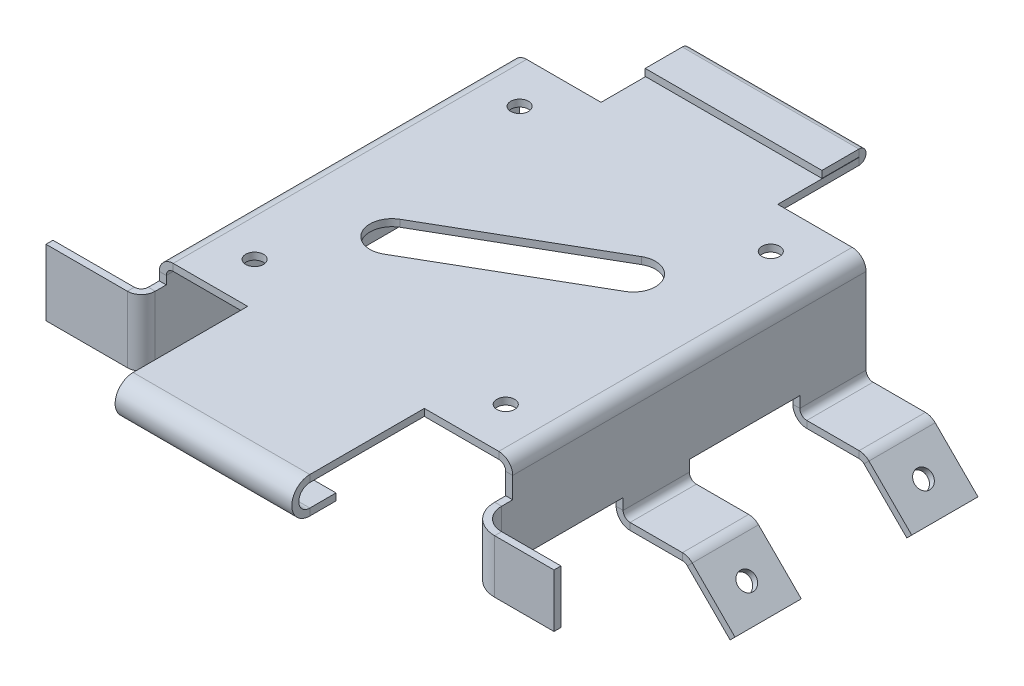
ISO-10303-21;
HEADER;
FILE_DESCRIPTION(('STEP AP214'),'2;1');
FILE_NAME('part.step','',(''),(''),'','','');
FILE_SCHEMA(('AUTOMOTIVE_DESIGN { 1 0 10303 214 1 1 1 1 }'));
ENDSEC;
DATA;
#1=APPLICATION_CONTEXT('core data for automotive mechanical design processes');
#2=APPLICATION_PROTOCOL_DEFINITION('international standard','automotive_design',2000,#1);
#3=PRODUCT_CONTEXT('',#1,'mechanical');
#4=PRODUCT('Part','Part','',(#3));
#5=PRODUCT_RELATED_PRODUCT_CATEGORY('part','',(#4));
#6=PRODUCT_DEFINITION_FORMATION('','',#4);
#7=PRODUCT_DEFINITION_CONTEXT('part definition',#1,'design');
#8=PRODUCT_DEFINITION('design','',#6,#7);
#9=PRODUCT_DEFINITION_SHAPE('','',#8);
#10=(LENGTH_UNIT() NAMED_UNIT(*) SI_UNIT(.MILLI.,.METRE.));
#11=(NAMED_UNIT(*) PLANE_ANGLE_UNIT() SI_UNIT($,.RADIAN.));
#12=(NAMED_UNIT(*) SI_UNIT($,.STERADIAN.) SOLID_ANGLE_UNIT());
#13=UNCERTAINTY_MEASURE_WITH_UNIT(LENGTH_MEASURE(1.E-05),#10,'distance_accuracy_value','');
#14=(GEOMETRIC_REPRESENTATION_CONTEXT(3) GLOBAL_UNCERTAINTY_ASSIGNED_CONTEXT((#13)) GLOBAL_UNIT_ASSIGNED_CONTEXT((#10,
#11,#12)) REPRESENTATION_CONTEXT('',''));
#15=CARTESIAN_POINT('',(0.,0.,0.));
#16=DIRECTION('',(0.,0.,1.));
#17=DIRECTION('',(1.,0.,0.));
#18=AXIS2_PLACEMENT_3D('',#15,#16,#17);
#19=CARTESIAN_POINT('',(-46.8,21.4,101.6));
#20=DIRECTION('',(0.,0.,1.));
#21=DIRECTION('',(1.,0.,0.));
#22=AXIS2_PLACEMENT_3D('',#19,#20,#21);
#23=PLANE('',#22);
#24=DIRECTION('',(0.,-1.,0.));
#25=VECTOR('',#24,1.);
#26=CARTESIAN_POINT('',(-50.8,0.,101.6));
#27=LINE('',#26,#25);
#28=CARTESIAN_POINT('',(-50.8,21.4,101.6));
#29=VERTEX_POINT('',#28);
#30=CARTESIAN_POINT('',(-50.8,19.05,101.6));
#31=VERTEX_POINT('',#30);
#32=EDGE_CURVE('E880',#29,#31,#27,.T.);
#33=ORIENTED_EDGE('',*,*,#32,.T.);
#34=DIRECTION('',(1.,0.,0.));
#35=VECTOR('',#34,1.);
#36=CARTESIAN_POINT('',(-50.8,19.05,101.6));
#37=LINE('',#36,#35);
#38=CARTESIAN_POINT('',(-48.8,19.05,101.6));
#39=VERTEX_POINT('',#38);
#40=EDGE_CURVE('E848',#31,#39,#37,.T.);
#41=ORIENTED_EDGE('',*,*,#40,.T.);
#42=DIRECTION('',(0.,1.,0.));
#43=VECTOR('',#42,1.);
#44=CARTESIAN_POINT('',(-48.8,0.,101.6));
#45=LINE('',#44,#43);
#46=CARTESIAN_POINT('',(-48.8,21.4,101.6));
#47=VERTEX_POINT('',#46);
#48=EDGE_CURVE('E857',#47,#39,#45,.F.);
#49=ORIENTED_EDGE('',*,*,#48,.F.);
#50=DIRECTION('',(-1.,0.,0.));
#51=VECTOR('',#50,1.);
#52=CARTESIAN_POINT('',(-48.8,21.4,101.6));
#53=LINE('',#52,#51);
#54=EDGE_CURVE('E245',#47,#29,#53,.T.);
#55=ORIENTED_EDGE('',*,*,#54,.T.);
#56=EDGE_LOOP('',(#33,#41,#49,#55));
#57=FACE_BOUND('',#56,.T.);
#58=ADVANCED_FACE('F236',(#57),#23,.T.);
#59=CARTESIAN_POINT('',(-25.4,25.4,139.7));
#60=DIRECTION('',(-1.,0.,0.));
#61=DIRECTION('',(0.,0.,1.));
#62=AXIS2_PLACEMENT_3D('',#59,#60,#61);
#63=PLANE('',#62);
#64=DIRECTION('',(0.,0.,-1.));
#65=VECTOR('',#64,1.);
#66=CARTESIAN_POINT('',(-25.4,25.4,139.7));
#67=LINE('',#66,#65);
#68=CARTESIAN_POINT('',(-25.4,25.4,0.));
#69=VERTEX_POINT('',#68);
#70=CARTESIAN_POINT('',(-25.4,25.4,-23.35));
#71=VERTEX_POINT('',#70);
#72=EDGE_CURVE('E1070',#69,#71,#67,.T.);
#73=ORIENTED_EDGE('',*,*,#72,.T.);
#74=DIRECTION('',(0.,-1.,0.));
#75=VECTOR('',#74,1.);
#76=CARTESIAN_POINT('',(-25.4,25.4,-23.35));
#77=LINE('',#76,#75);
#78=CARTESIAN_POINT('',(-25.4,23.4,-23.3500000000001));
#79=VERTEX_POINT('',#78);
#80=EDGE_CURVE('E965',#71,#79,#77,.T.);
#81=ORIENTED_EDGE('',*,*,#80,.T.);
#82=DIRECTION('',(0.,0.,-1.));
#83=VECTOR('',#82,1.);
#84=CARTESIAN_POINT('',(-25.4,23.4,139.7));
#85=LINE('',#84,#83);
#86=CARTESIAN_POINT('',(-25.4,23.4,0.));
#87=VERTEX_POINT('',#86);
#88=EDGE_CURVE('E1065',#87,#79,#85,.T.);
#89=ORIENTED_EDGE('',*,*,#88,.F.);
#90=DIRECTION('',(0.,1.,0.));
#91=VECTOR('',#90,1.);
#92=CARTESIAN_POINT('',(-25.4,21.4,0.));
#93=LINE('',#92,#91);
#94=EDGE_CURVE('E1083',#87,#69,#93,.T.);
#95=ORIENTED_EDGE('',*,*,#94,.T.);
#96=EDGE_LOOP('',(#73,#81,#89,#95));
#97=FACE_BOUND('',#96,.T.);
#98=ADVANCED_FACE('F1796',(#97),#63,.T.);
#99=CARTESIAN_POINT('',(-25.4,23.4,134.525));
#100=VERTEX_POINT('',#99);
#101=CARTESIAN_POINT('',(-25.4,23.4,101.6));
#102=VERTEX_POINT('',#101);
#103=EDGE_CURVE('E1074',#100,#102,#85,.T.);
#104=ORIENTED_EDGE('',*,*,#103,.F.);
#105=DIRECTION('',(0.,1.,0.));
#106=VECTOR('',#105,1.);
#107=CARTESIAN_POINT('',(-25.4,23.4,134.525));
#108=LINE('',#107,#106);
#109=CARTESIAN_POINT('',(-25.4,25.4,134.525));
#110=VERTEX_POINT('',#109);
#111=EDGE_CURVE('E1018',#100,#110,#108,.T.);
#112=ORIENTED_EDGE('',*,*,#111,.T.);
#113=CARTESIAN_POINT('',(-25.4,25.4,101.6));
#114=VERTEX_POINT('',#113);
#115=EDGE_CURVE('E1067',#110,#114,#67,.T.);
#116=ORIENTED_EDGE('',*,*,#115,.T.);
#117=DIRECTION('',(0.,-1.,0.));
#118=VECTOR('',#117,1.);
#119=CARTESIAN_POINT('',(-25.4,21.4,101.6));
#120=LINE('',#119,#118);
#121=EDGE_CURVE('E1086',#114,#102,#120,.T.);
#122=ORIENTED_EDGE('',*,*,#121,.T.);
#123=EDGE_LOOP('',(#104,#112,#116,#122));
#124=FACE_BOUND('',#123,.T.);
#125=ADVANCED_FACE('F1800',(#124),#63,.T.);
#126=CARTESIAN_POINT('',(-48.8,21.4,101.6));
#127=DIRECTION('',(0.,0.,1.));
#128=DIRECTION('',(1.,0.,0.));
#129=AXIS2_PLACEMENT_3D('',#126,#127,#128);
#130=PLANE('',#129);
#131=ORIENTED_EDGE('',*,*,#121,.F.);
#132=DIRECTION('',(-1.,0.,0.));
#133=VECTOR('',#132,1.);
#134=CARTESIAN_POINT('',(-50.8,25.4,101.6));
#135=LINE('',#134,#133);
#136=CARTESIAN_POINT('',(-46.8,25.4,101.6));
#137=VERTEX_POINT('',#136);
#138=EDGE_CURVE('E3384',#114,#137,#135,.T.);
#139=ORIENTED_EDGE('',*,*,#138,.T.);
#140=DIRECTION('',(0.,-1.,0.));
#141=VECTOR('',#140,1.);
#142=CARTESIAN_POINT('',(-46.8,25.4,101.6));
#143=LINE('',#142,#141);
#144=CARTESIAN_POINT('',(-46.8,23.4,101.6));
#145=VERTEX_POINT('',#144);
#146=EDGE_CURVE('E13',#137,#145,#143,.T.);
#147=ORIENTED_EDGE('',*,*,#146,.T.);
#148=DIRECTION('',(1.,0.,0.));
#149=VECTOR('',#148,1.);
#150=CARTESIAN_POINT('',(-50.8,23.4,101.6));
#151=LINE('',#150,#149);
#152=EDGE_CURVE('E893',#102,#145,#151,.F.);
#153=ORIENTED_EDGE('',*,*,#152,.F.);
#154=EDGE_LOOP('',(#131,#139,#147,#153));
#155=FACE_BOUND('',#154,.T.);
#156=ADVANCED_FACE('F2617',(#155),#130,.T.);
#157=CARTESIAN_POINT('',(48.8,21.4,0.));
#158=DIRECTION('',(0.,0.,-1.));
#159=DIRECTION('',(-1.,0.,0.));
#160=AXIS2_PLACEMENT_3D('',#157,#158,#159);
#161=PLANE('',#160);
#162=ORIENTED_EDGE('',*,*,#94,.F.);
#163=DIRECTION('',(1.,0.,0.));
#164=VECTOR('',#163,1.);
#165=CARTESIAN_POINT('',(-50.8,23.4,0.));
#166=LINE('',#165,#164);
#167=CARTESIAN_POINT('',(-46.8,23.4,0.));
#168=VERTEX_POINT('',#167);
#169=EDGE_CURVE('E1593',#87,#168,#166,.F.);
#170=ORIENTED_EDGE('',*,*,#169,.T.);
#171=DIRECTION('',(0.,1.,0.));
#172=VECTOR('',#171,1.);
#173=CARTESIAN_POINT('',(-46.8,23.4,0.));
#174=LINE('',#173,#172);
#175=CARTESIAN_POINT('',(-46.8,25.4,0.));
#176=VERTEX_POINT('',#175);
#177=EDGE_CURVE('E1647',#168,#176,#174,.T.);
#178=ORIENTED_EDGE('',*,*,#177,.T.);
#179=DIRECTION('',(-1.,0.,0.));
#180=VECTOR('',#179,1.);
#181=CARTESIAN_POINT('',(-50.8,25.4,0.));
#182=LINE('',#181,#180);
#183=EDGE_CURVE('E1609',#69,#176,#182,.T.);
#184=ORIENTED_EDGE('',*,*,#183,.F.);
#185=EDGE_LOOP('',(#162,#170,#178,#184));
#186=FACE_BOUND('',#185,.T.);
#187=ADVANCED_FACE('F2306',(#186),#161,.T.);
#188=CARTESIAN_POINT('',(-48.8,0.,101.6));
#189=DIRECTION('',(0.,-1.,0.));
#190=DIRECTION('',(0.,0.,-1.));
#191=AXIS2_PLACEMENT_3D('',#188,#189,#190);
#192=PLANE('',#191);
#193=DIRECTION('',(0.,0.,-1.));
#194=VECTOR('',#193,1.);
#195=CARTESIAN_POINT('',(-50.8,0.,101.6));
#196=LINE('',#195,#194);
#197=CARTESIAN_POINT('',(-50.8,0.,104.775));
#198=VERTEX_POINT('',#197);
#199=CARTESIAN_POINT('',(-50.8,0.,69.85));
#200=VERTEX_POINT('',#199);
#201=EDGE_CURVE('E1236',#198,#200,#196,.T.);
#202=ORIENTED_EDGE('',*,*,#201,.T.);
#203=DIRECTION('',(1.,0.,0.));
#204=VECTOR('',#203,1.);
#205=CARTESIAN_POINT('',(-50.8,0.,69.85));
#206=LINE('',#205,#204);
#207=CARTESIAN_POINT('',(-48.8,0.,69.85));
#208=VERTEX_POINT('',#207);
#209=EDGE_CURVE('E1194',#200,#208,#206,.T.);
#210=ORIENTED_EDGE('',*,*,#209,.T.);
#211=DIRECTION('',(0.,0.,-1.));
#212=VECTOR('',#211,1.);
#213=CARTESIAN_POINT('',(-48.8,0.,101.6));
#214=LINE('',#213,#212);
#215=CARTESIAN_POINT('',(-48.8,0.,104.775));
#216=VERTEX_POINT('',#215);
#217=EDGE_CURVE('E1221',#216,#208,#214,.T.);
#218=ORIENTED_EDGE('',*,*,#217,.F.);
#219=DIRECTION('',(1.,0.,0.));
#220=VECTOR('',#219,1.);
#221=CARTESIAN_POINT('',(-50.8,0.,104.775));
#222=LINE('',#221,#220);
#223=EDGE_CURVE('E845',#198,#216,#222,.T.);
#224=ORIENTED_EDGE('',*,*,#223,.F.);
#225=EDGE_LOOP('',(#202,#210,#218,#224));
#226=FACE_BOUND('',#225,.T.);
#227=ADVANCED_FACE('F2299',(#226),#192,.T.);
#228=CARTESIAN_POINT('',(50.8,0.,101.6));
#229=DIRECTION('',(0.,-1.,0.));
#230=DIRECTION('',(0.,0.,-1.));
#231=AXIS2_PLACEMENT_3D('',#228,#229,#230);
#232=PLANE('',#231);
#233=DIRECTION('',(0.,0.,-1.));
#234=VECTOR('',#233,1.);
#235=CARTESIAN_POINT('',(50.8,0.,101.6));
#236=LINE('',#235,#234);
#237=CARTESIAN_POINT('',(50.8,0.,50.8));
#238=VERTEX_POINT('',#237);
#239=CARTESIAN_POINT('',(50.8,0.,19.05));
#240=VERTEX_POINT('',#239);
#241=EDGE_CURVE('E1260',#238,#240,#236,.T.);
#242=ORIENTED_EDGE('',*,*,#241,.F.);
#243=DIRECTION('',(-1.,0.,0.));
#244=VECTOR('',#243,1.);
#245=CARTESIAN_POINT('',(50.8,0.,50.8));
#246=LINE('',#245,#244);
#247=CARTESIAN_POINT('',(48.8,0.,50.8));
#248=VERTEX_POINT('',#247);
#249=EDGE_CURVE('E1277',#238,#248,#246,.T.);
#250=ORIENTED_EDGE('',*,*,#249,.T.);
#251=DIRECTION('',(0.,0.,-1.));
#252=VECTOR('',#251,1.);
#253=CARTESIAN_POINT('',(48.8,0.,101.6));
#254=LINE('',#253,#252);
#255=CARTESIAN_POINT('',(48.8,0.,19.05));
#256=VERTEX_POINT('',#255);
#257=EDGE_CURVE('E1259',#248,#256,#254,.T.);
#258=ORIENTED_EDGE('',*,*,#257,.T.);
#259=DIRECTION('',(-1.,0.,0.));
#260=VECTOR('',#259,1.);
#261=CARTESIAN_POINT('',(50.8,0.,19.05));
#262=LINE('',#261,#260);
#263=EDGE_CURVE('E1388',#240,#256,#262,.T.);
#264=ORIENTED_EDGE('',*,*,#263,.F.);
#265=EDGE_LOOP('',(#242,#250,#258,#264));
#266=FACE_BOUND('',#265,.T.);
#267=ADVANCED_FACE('F1720',(#266),#232,.T.);
#268=DIRECTION('',(1.,0.,0.));
#269=VECTOR('',#268,1.);
#270=CARTESIAN_POINT('',(-50.8,0.,50.8));
#271=LINE('',#270,#269);
#272=CARTESIAN_POINT('',(-50.8,0.,50.8));
#273=VERTEX_POINT('',#272);
#274=CARTESIAN_POINT('',(-48.8,0.,50.8));
#275=VERTEX_POINT('',#274);
#276=EDGE_CURVE('E1183',#273,#275,#271,.T.);
#277=ORIENTED_EDGE('',*,*,#276,.F.);
#278=CARTESIAN_POINT('',(-50.8,0.,19.05));
#279=VERTEX_POINT('',#278);
#280=EDGE_CURVE('E1223',#273,#279,#196,.T.);
#281=ORIENTED_EDGE('',*,*,#280,.T.);
#282=DIRECTION('',(1.,0.,0.));
#283=VECTOR('',#282,1.);
#284=CARTESIAN_POINT('',(-50.8,0.,19.05));
#285=LINE('',#284,#283);
#286=CARTESIAN_POINT('',(-48.8,0.,19.05));
#287=VERTEX_POINT('',#286);
#288=EDGE_CURVE('E1240',#279,#287,#285,.T.);
#289=ORIENTED_EDGE('',*,*,#288,.T.);
#290=EDGE_CURVE('E1218',#275,#287,#214,.T.);
#291=ORIENTED_EDGE('',*,*,#290,.F.);
#292=EDGE_LOOP('',(#277,#281,#289,#291));
#293=FACE_BOUND('',#292,.T.);
#294=ADVANCED_FACE('F1581',(#293),#192,.T.);
#295=CARTESIAN_POINT('',(-46.8,25.4,101.6));
#296=DIRECTION('',(0.,0.,1.));
#297=DIRECTION('',(1.,0.,0.));
#298=AXIS2_PLACEMENT_3D('',#295,#296,#297);
#299=PLANE('',#298);
#300=ORIENTED_EDGE('',*,*,#146,.F.);
#301=CARTESIAN_POINT('',(-46.8,21.4,101.6));
#302=DIRECTION('',(0.,0.,1.));
#303=DIRECTION('',(1.,0.,0.));
#304=AXIS2_PLACEMENT_3D('',#301,#302,#303);
#305=CIRCLE('',#304,4.);
#306=EDGE_CURVE('E1589',#137,#29,#305,.T.);
#307=ORIENTED_EDGE('',*,*,#306,.T.);
#308=ORIENTED_EDGE('',*,*,#54,.F.);
#309=CARTESIAN_POINT('',(-46.8,21.4,101.6));
#310=DIRECTION('',(0.,0.,1.));
#311=DIRECTION('',(1.,0.,0.));
#312=AXIS2_PLACEMENT_3D('',#309,#310,#311);
#313=CIRCLE('',#312,2.);
#314=EDGE_CURVE('E890',#145,#47,#313,.T.);
#315=ORIENTED_EDGE('',*,*,#314,.F.);
#316=EDGE_LOOP('',(#300,#307,#308,#315));
#317=FACE_BOUND('',#316,.T.);
#318=ADVANCED_FACE('F238',(#317),#299,.T.);
#319=DIRECTION('',(0.,1.,0.));
#320=VECTOR('',#319,1.);
#321=CARTESIAN_POINT('',(25.4,21.4,101.6));
#322=LINE('',#321,#320);
#323=CARTESIAN_POINT('',(25.4,23.4,101.6));
#324=VERTEX_POINT('',#323);
#325=CARTESIAN_POINT('',(25.4,25.4,101.6));
#326=VERTEX_POINT('',#325);
#327=EDGE_CURVE('E1081',#324,#326,#322,.T.);
#328=ORIENTED_EDGE('',*,*,#327,.F.);
#329=CARTESIAN_POINT('',(46.8,23.4,101.6));
#330=VERTEX_POINT('',#329);
#331=EDGE_CURVE('E894',#330,#324,#151,.F.);
#332=ORIENTED_EDGE('',*,*,#331,.F.);
#333=DIRECTION('',(0.,1.,0.));
#334=VECTOR('',#333,1.);
#335=CARTESIAN_POINT('',(46.8,23.4,101.6));
#336=LINE('',#335,#334);
#337=CARTESIAN_POINT('',(46.8,25.4,101.6));
#338=VERTEX_POINT('',#337);
#339=EDGE_CURVE('E1640',#330,#338,#336,.T.);
#340=ORIENTED_EDGE('',*,*,#339,.T.);
#341=EDGE_CURVE('E1660',#338,#326,#135,.T.);
#342=ORIENTED_EDGE('',*,*,#341,.T.);
#343=EDGE_LOOP('',(#328,#332,#340,#342));
#344=FACE_BOUND('',#343,.T.);
#345=ADVANCED_FACE('F2669',(#344),#130,.T.);
#346=CARTESIAN_POINT('',(-50.8,21.4,0.));
#347=DIRECTION('',(0.,0.,-1.));
#348=DIRECTION('',(-1.,0.,0.));
#349=AXIS2_PLACEMENT_3D('',#346,#347,#348);
#350=PLANE('',#349);
#351=DIRECTION('',(1.,0.,0.));
#352=VECTOR('',#351,1.);
#353=CARTESIAN_POINT('',(-50.8,21.4,0.));
#354=LINE('',#353,#352);
#355=CARTESIAN_POINT('',(-50.8,21.4,0.));
#356=VERTEX_POINT('',#355);
#357=CARTESIAN_POINT('',(-48.8,21.4,0.));
#358=VERTEX_POINT('',#357);
#359=EDGE_CURVE('E1572',#356,#358,#354,.T.);
#360=ORIENTED_EDGE('',*,*,#359,.F.);
#361=CARTESIAN_POINT('',(-46.8,21.4,0.));
#362=DIRECTION('',(0.,0.,1.));
#363=DIRECTION('',(1.,0.,0.));
#364=AXIS2_PLACEMENT_3D('',#361,#362,#363);
#365=CIRCLE('',#364,4.);
#366=EDGE_CURVE('E883',#176,#356,#365,.T.);
#367=ORIENTED_EDGE('',*,*,#366,.F.);
#368=ORIENTED_EDGE('',*,*,#177,.F.);
#369=CARTESIAN_POINT('',(-46.8,21.4,0.));
#370=DIRECTION('',(0.,0.,1.));
#371=DIRECTION('',(1.,0.,0.));
#372=AXIS2_PLACEMENT_3D('',#369,#370,#371);
#373=CIRCLE('',#372,2.);
#374=EDGE_CURVE('E1576',#168,#358,#373,.T.);
#375=ORIENTED_EDGE('',*,*,#374,.T.);
#376=EDGE_LOOP('',(#360,#367,#368,#375));
#377=FACE_BOUND('',#376,.T.);
#378=ADVANCED_FACE('F1665',(#377),#350,.T.);
#379=CARTESIAN_POINT('',(-46.8,23.4,0.));
#380=DIRECTION('',(0.,0.,-1.));
#381=DIRECTION('',(-1.,0.,0.));
#382=AXIS2_PLACEMENT_3D('',#379,#380,#381);
#383=PLANE('',#382);
#384=DIRECTION('',(0.,-1.,0.));
#385=VECTOR('',#384,1.);
#386=CARTESIAN_POINT('',(-50.8,0.,0.));
#387=LINE('',#386,#385);
#388=CARTESIAN_POINT('',(-50.8,-3.175,0.));
#389=VERTEX_POINT('',#388);
#390=EDGE_CURVE('E1252',#356,#389,#387,.T.);
#391=ORIENTED_EDGE('',*,*,#390,.F.);
#392=ORIENTED_EDGE('',*,*,#359,.T.);
#393=DIRECTION('',(0.,1.,0.));
#394=VECTOR('',#393,1.);
#395=CARTESIAN_POINT('',(-48.8,0.,0.));
#396=LINE('',#395,#394);
#397=CARTESIAN_POINT('',(-48.8,-3.175,0.));
#398=VERTEX_POINT('',#397);
#399=EDGE_CURVE('E1570',#358,#398,#396,.F.);
#400=ORIENTED_EDGE('',*,*,#399,.T.);
#401=DIRECTION('',(1.,0.,0.));
#402=VECTOR('',#401,1.);
#403=CARTESIAN_POINT('',(-50.8,-3.175,0.));
#404=LINE('',#403,#402);
#405=EDGE_CURVE('E1244',#389,#398,#404,.T.);
#406=ORIENTED_EDGE('',*,*,#405,.F.);
#407=EDGE_LOOP('',(#391,#392,#400,#406));
#408=FACE_BOUND('',#407,.T.);
#409=ADVANCED_FACE('F1571',(#408),#383,.T.);
#410=CARTESIAN_POINT('',(50.8,21.4,101.6));
#411=DIRECTION('',(0.,0.,1.));
#412=DIRECTION('',(1.,0.,0.));
#413=AXIS2_PLACEMENT_3D('',#410,#411,#412);
#414=PLANE('',#413);
#415=DIRECTION('',(-1.,0.,0.));
#416=VECTOR('',#415,1.);
#417=CARTESIAN_POINT('',(50.8,21.4,101.6));
#418=LINE('',#417,#416);
#419=CARTESIAN_POINT('',(50.8,21.4,101.6));
#420=VERTEX_POINT('',#419);
#421=CARTESIAN_POINT('',(48.8,21.4,101.6));
#422=VERTEX_POINT('',#421);
#423=EDGE_CURVE('E1642',#420,#422,#418,.T.);
#424=ORIENTED_EDGE('',*,*,#423,.F.);
#425=CARTESIAN_POINT('',(46.8,21.4,101.6));
#426=DIRECTION('',(0.,0.,1.));
#427=DIRECTION('',(1.,0.,0.));
#428=AXIS2_PLACEMENT_3D('',#425,#426,#427);
#429=CIRCLE('',#428,4.);
#430=EDGE_CURVE('E1631',#420,#338,#429,.T.);
#431=ORIENTED_EDGE('',*,*,#430,.T.);
#432=ORIENTED_EDGE('',*,*,#339,.F.);
#433=CARTESIAN_POINT('',(46.8,21.4,101.6));
#434=DIRECTION('',(0.,0.,1.));
#435=DIRECTION('',(1.,0.,0.));
#436=AXIS2_PLACEMENT_3D('',#433,#434,#435);
#437=CIRCLE('',#436,2.);
#438=EDGE_CURVE('E897',#422,#330,#437,.T.);
#439=ORIENTED_EDGE('',*,*,#438,.F.);
#440=EDGE_LOOP('',(#424,#431,#432,#439));
#441=FACE_BOUND('',#440,.T.);
#442=ADVANCED_FACE('F3200',(#441),#414,.T.);
#443=CARTESIAN_POINT('',(46.8,23.4,101.6));
#444=DIRECTION('',(0.,0.,1.));
#445=DIRECTION('',(1.,0.,0.));
#446=AXIS2_PLACEMENT_3D('',#443,#444,#445);
#447=PLANE('',#446);
#448=DIRECTION('',(-1.,0.,0.));
#449=VECTOR('',#448,1.);
#450=CARTESIAN_POINT('',(50.8,15.3335513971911,101.6));
#451=LINE('',#450,#449);
#452=CARTESIAN_POINT('',(50.8,15.3335513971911,101.6));
#453=VERTEX_POINT('',#452);
#454=CARTESIAN_POINT('',(48.8,15.3335513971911,101.6));
#455=VERTEX_POINT('',#454);
#456=EDGE_CURVE('E261',#453,#455,#451,.T.);
#457=ORIENTED_EDGE('',*,*,#456,.F.);
#458=DIRECTION('',(0.,1.,0.));
#459=VECTOR('',#458,1.);
#460=CARTESIAN_POINT('',(50.8,0.,101.6));
#461=LINE('',#460,#459);
#462=EDGE_CURVE('E908',#453,#420,#461,.T.);
#463=ORIENTED_EDGE('',*,*,#462,.T.);
#464=ORIENTED_EDGE('',*,*,#423,.T.);
#465=DIRECTION('',(0.,1.,0.));
#466=VECTOR('',#465,1.);
#467=CARTESIAN_POINT('',(48.8,0.,101.6));
#468=LINE('',#467,#466);
#469=EDGE_CURVE('E900',#455,#422,#468,.T.);
#470=ORIENTED_EDGE('',*,*,#469,.F.);
#471=EDGE_LOOP('',(#457,#463,#464,#470));
#472=FACE_BOUND('',#471,.T.);
#473=ADVANCED_FACE('F3247',(#472),#447,.T.);
#474=CARTESIAN_POINT('',(46.8,25.4,0.));
#475=DIRECTION('',(0.,0.,-1.));
#476=DIRECTION('',(-1.,0.,0.));
#477=AXIS2_PLACEMENT_3D('',#474,#475,#476);
#478=PLANE('',#477);
#479=DIRECTION('',(0.,-1.,0.));
#480=VECTOR('',#479,1.);
#481=CARTESIAN_POINT('',(46.8,25.4,0.));
#482=LINE('',#481,#480);
#483=CARTESIAN_POINT('',(46.8,25.4,0.));
#484=VERTEX_POINT('',#483);
#485=CARTESIAN_POINT('',(46.8,23.4,0.));
#486=VERTEX_POINT('',#485);
#487=EDGE_CURVE('E1636',#484,#486,#482,.T.);
#488=ORIENTED_EDGE('',*,*,#487,.F.);
#489=CARTESIAN_POINT('',(46.8,21.4,0.));
#490=DIRECTION('',(0.,0.,1.));
#491=DIRECTION('',(1.,0.,0.));
#492=AXIS2_PLACEMENT_3D('',#489,#490,#491);
#493=CIRCLE('',#492,4.);
#494=CARTESIAN_POINT('',(50.8,21.4,0.));
#495=VERTEX_POINT('',#494);
#496=EDGE_CURVE('E1606',#495,#484,#493,.T.);
#497=ORIENTED_EDGE('',*,*,#496,.F.);
#498=DIRECTION('',(1.,0.,0.));
#499=VECTOR('',#498,1.);
#500=CARTESIAN_POINT('',(48.8,21.4,0.));
#501=LINE('',#500,#499);
#502=CARTESIAN_POINT('',(48.8,21.4,0.));
#503=VERTEX_POINT('',#502);
#504=EDGE_CURVE('E1239',#503,#495,#501,.T.);
#505=ORIENTED_EDGE('',*,*,#504,.F.);
#506=CARTESIAN_POINT('',(46.8,21.4,0.));
#507=DIRECTION('',(0.,0.,1.));
#508=DIRECTION('',(1.,0.,0.));
#509=AXIS2_PLACEMENT_3D('',#506,#507,#508);
#510=CIRCLE('',#509,2.);
#511=EDGE_CURVE('E1597',#503,#486,#510,.T.);
#512=ORIENTED_EDGE('',*,*,#511,.T.);
#513=EDGE_LOOP('',(#488,#497,#505,#512));
#514=FACE_BOUND('',#513,.T.);
#515=ADVANCED_FACE('F1634',(#514),#478,.T.);
#516=DIRECTION('',(0.,-1.,0.));
#517=VECTOR('',#516,1.);
#518=CARTESIAN_POINT('',(25.4,21.4,0.));
#519=LINE('',#518,#517);
#520=CARTESIAN_POINT('',(25.4,25.4,0.));
#521=VERTEX_POINT('',#520);
#522=CARTESIAN_POINT('',(25.4,23.4,0.));
#523=VERTEX_POINT('',#522);
#524=EDGE_CURVE('E1073',#521,#523,#519,.T.);
#525=ORIENTED_EDGE('',*,*,#524,.F.);
#526=EDGE_CURVE('E1610',#484,#521,#182,.T.);
#527=ORIENTED_EDGE('',*,*,#526,.F.);
#528=ORIENTED_EDGE('',*,*,#487,.T.);
#529=EDGE_CURVE('E1594',#486,#523,#166,.F.);
#530=ORIENTED_EDGE('',*,*,#529,.T.);
#531=EDGE_LOOP('',(#525,#527,#528,#530));
#532=FACE_BOUND('',#531,.T.);
#533=ADVANCED_FACE('F2679',(#532),#161,.T.);
#534=CARTESIAN_POINT('',(-50.8,0.,101.6));
#535=DIRECTION('',(1.,0.,0.));
#536=DIRECTION('',(0.,0.,-1.));
#537=AXIS2_PLACEMENT_3D('',#534,#535,#536);
#538=PLANE('',#537);
#539=ORIENTED_EDGE('',*,*,#390,.T.);
#540=DIRECTION('',(0.,0.,1.));
#541=VECTOR('',#540,1.);
#542=CARTESIAN_POINT('',(-50.8,-3.175,19.05));
#543=LINE('',#542,#541);
#544=CARTESIAN_POINT('',(-50.8,-3.175,19.05));
#545=VERTEX_POINT('',#544);
#546=EDGE_CURVE('E1478',#545,#389,#543,.F.);
#547=ORIENTED_EDGE('',*,*,#546,.F.);
#548=DIRECTION('',(0.,1.,0.));
#549=VECTOR('',#548,1.);
#550=CARTESIAN_POINT('',(-50.8,-3.175,19.05));
#551=LINE('',#550,#549);
#552=EDGE_CURVE('E1247',#545,#279,#551,.T.);
#553=ORIENTED_EDGE('',*,*,#552,.T.);
#554=ORIENTED_EDGE('',*,*,#280,.F.);
#555=DIRECTION('',(0.,1.,0.));
#556=VECTOR('',#555,1.);
#557=CARTESIAN_POINT('',(-50.8,-3.175,50.8));
#558=LINE('',#557,#556);
#559=CARTESIAN_POINT('',(-50.8,-3.175,50.8));
#560=VERTEX_POINT('',#559);
#561=EDGE_CURVE('E1199',#560,#273,#558,.T.);
#562=ORIENTED_EDGE('',*,*,#561,.F.);
#563=DIRECTION('',(0.,0.,1.));
#564=VECTOR('',#563,1.);
#565=CARTESIAN_POINT('',(-50.8,-3.175,69.85));
#566=LINE('',#565,#564);
#567=CARTESIAN_POINT('',(-50.8,-3.175,69.85));
#568=VERTEX_POINT('',#567);
#569=EDGE_CURVE('E1176',#568,#560,#566,.F.);
#570=ORIENTED_EDGE('',*,*,#569,.F.);
#571=DIRECTION('',(0.,1.,0.));
#572=VECTOR('',#571,1.);
#573=CARTESIAN_POINT('',(-50.8,-3.175,69.85));
#574=LINE('',#573,#572);
#575=EDGE_CURVE('E1203',#568,#200,#574,.T.);
#576=ORIENTED_EDGE('',*,*,#575,.T.);
#577=ORIENTED_EDGE('',*,*,#201,.F.);
#578=DIRECTION('',(0.,1.,0.));
#579=VECTOR('',#578,1.);
#580=CARTESIAN_POINT('',(-50.8,19.05,104.775));
#581=LINE('',#580,#579);
#582=CARTESIAN_POINT('',(-50.8,19.05,104.775));
#583=VERTEX_POINT('',#582);
#584=EDGE_CURVE('E840',#583,#198,#581,.F.);
#585=ORIENTED_EDGE('',*,*,#584,.F.);
#586=DIRECTION('',(0.,0.,-1.));
#587=VECTOR('',#586,1.);
#588=CARTESIAN_POINT('',(-50.8,19.05,104.775));
#589=LINE('',#588,#587);
#590=EDGE_CURVE('E861',#583,#31,#589,.T.);
#591=ORIENTED_EDGE('',*,*,#590,.T.);
#592=ORIENTED_EDGE('',*,*,#32,.F.);
#593=DIRECTION('',(0.,0.,-1.));
#594=VECTOR('',#593,1.);
#595=CARTESIAN_POINT('',(-50.8,21.4,101.6));
#596=LINE('',#595,#594);
#597=EDGE_CURVE('E1586',#29,#356,#596,.T.);
#598=ORIENTED_EDGE('',*,*,#597,.T.);
#599=EDGE_LOOP('',(#539,#547,#553,#554,#562,#570,#576,#577,#585,#591,#592,#598));
#600=FACE_BOUND('',#599,.T.);
#601=ADVANCED_FACE('F1583',(#600),#538,.F.);
#602=CARTESIAN_POINT('',(-48.8,0.,101.6));
#603=DIRECTION('',(1.,0.,0.));
#604=DIRECTION('',(0.,0.,-1.));
#605=AXIS2_PLACEMENT_3D('',#602,#603,#604);
#606=PLANE('',#605);
#607=ORIENTED_EDGE('',*,*,#399,.F.);
#608=DIRECTION('',(0.,0.,-1.));
#609=VECTOR('',#608,1.);
#610=CARTESIAN_POINT('',(-48.8,21.4,101.6));
#611=LINE('',#610,#609);
#612=EDGE_CURVE('E1222',#47,#358,#611,.T.);
#613=ORIENTED_EDGE('',*,*,#612,.F.);
#614=ORIENTED_EDGE('',*,*,#48,.T.);
#615=DIRECTION('',(0.,0.,-1.));
#616=VECTOR('',#615,1.);
#617=CARTESIAN_POINT('',(-48.8,19.05,104.775));
#618=LINE('',#617,#616);
#619=CARTESIAN_POINT('',(-48.8,19.05,104.775));
#620=VERTEX_POINT('',#619);
#621=EDGE_CURVE('E253',#620,#39,#618,.T.);
#622=ORIENTED_EDGE('',*,*,#621,.F.);
#623=DIRECTION('',(0.,1.,0.));
#624=VECTOR('',#623,1.);
#625=CARTESIAN_POINT('',(-48.8,19.05,104.775));
#626=LINE('',#625,#624);
#627=EDGE_CURVE('E827',#620,#216,#626,.F.);
#628=ORIENTED_EDGE('',*,*,#627,.T.);
#629=ORIENTED_EDGE('',*,*,#217,.T.);
#630=DIRECTION('',(0.,1.,0.));
#631=VECTOR('',#630,1.);
#632=CARTESIAN_POINT('',(-48.8,-3.175,69.85));
#633=LINE('',#632,#631);
#634=CARTESIAN_POINT('',(-48.8,-3.175,69.85));
#635=VERTEX_POINT('',#634);
#636=EDGE_CURVE('E1198',#635,#208,#633,.T.);
#637=ORIENTED_EDGE('',*,*,#636,.F.);
#638=DIRECTION('',(0.,0.,1.));
#639=VECTOR('',#638,1.);
#640=CARTESIAN_POINT('',(-48.8,-3.175,69.85));
#641=LINE('',#640,#639);
#642=CARTESIAN_POINT('',(-48.8,-3.175,50.8));
#643=VERTEX_POINT('',#642);
#644=EDGE_CURVE('E1163',#635,#643,#641,.F.);
#645=ORIENTED_EDGE('',*,*,#644,.T.);
#646=DIRECTION('',(0.,1.,0.));
#647=VECTOR('',#646,1.);
#648=CARTESIAN_POINT('',(-48.8,-3.175,50.8));
#649=LINE('',#648,#647);
#650=EDGE_CURVE('E1197',#643,#275,#649,.T.);
#651=ORIENTED_EDGE('',*,*,#650,.T.);
#652=ORIENTED_EDGE('',*,*,#290,.T.);
#653=DIRECTION('',(0.,1.,0.));
#654=VECTOR('',#653,1.);
#655=CARTESIAN_POINT('',(-48.8,-3.175,19.05));
#656=LINE('',#655,#654);
#657=CARTESIAN_POINT('',(-48.8,-3.175,19.05));
#658=VERTEX_POINT('',#657);
#659=EDGE_CURVE('E1243',#658,#287,#656,.T.);
#660=ORIENTED_EDGE('',*,*,#659,.F.);
#661=DIRECTION('',(0.,0.,1.));
#662=VECTOR('',#661,1.);
#663=CARTESIAN_POINT('',(-48.8,-3.175,19.05));
#664=LINE('',#663,#662);
#665=EDGE_CURVE('E1465',#658,#398,#664,.F.);
#666=ORIENTED_EDGE('',*,*,#665,.T.);
#667=EDGE_LOOP('',(#607,#613,#614,#622,#628,#629,#637,#645,#651,#652,#660,#666));
#668=FACE_BOUND('',#667,.T.);
#669=ADVANCED_FACE('F1578',(#668),#606,.T.);
#670=CARTESIAN_POINT('',(-46.8,21.4,101.6));
#671=DIRECTION('',(0.,0.,-1.));
#672=DIRECTION('',(-1.,0.,0.));
#673=AXIS2_PLACEMENT_3D('',#670,#671,#672);
#674=CYLINDRICAL_SURFACE('',#673,2.);
#675=ORIENTED_EDGE('',*,*,#374,.F.);
#676=DIRECTION('',(0.,0.,-1.));
#677=VECTOR('',#676,1.);
#678=CARTESIAN_POINT('',(-46.8,23.4,101.6));
#679=LINE('',#678,#677);
#680=EDGE_CURVE('E1671',#145,#168,#679,.T.);
#681=ORIENTED_EDGE('',*,*,#680,.F.);
#682=ORIENTED_EDGE('',*,*,#314,.T.);
#683=ORIENTED_EDGE('',*,*,#612,.T.);
#684=EDGE_LOOP('',(#675,#681,#682,#683));
#685=FACE_BOUND('',#684,.T.);
#686=ADVANCED_FACE('F1670',(#685),#674,.F.);
#687=CARTESIAN_POINT('',(-50.8,23.4,101.6));
#688=DIRECTION('',(0.,-1.,0.));
#689=DIRECTION('',(0.,0.,-1.));
#690=AXIS2_PLACEMENT_3D('',#687,#688,#689);
#691=PLANE('',#690);
#692=CARTESIAN_POINT('',(-36.1,23.4,88.9));
#693=DIRECTION('',(0.,-1.,0.));
#694=DIRECTION('',(0.,0.,-1.));
#695=AXIS2_PLACEMENT_3D('',#692,#693,#694);
#696=CIRCLE('',#695,2.55269999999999);
#697=CARTESIAN_POINT('',(-36.1,23.4,86.3473));
#698=VERTEX_POINT('',#697);
#699=EDGE_CURVE('E3480',#698,#698,#696,.T.);
#700=ORIENTED_EDGE('',*,*,#699,.F.);
#701=EDGE_LOOP('',(#700));
#702=FACE_BOUND('',#701,.T.);
#703=CARTESIAN_POINT('',(36.1,23.4,88.9));
#704=DIRECTION('',(0.,-1.,0.));
#705=DIRECTION('',(0.,0.,-1.));
#706=AXIS2_PLACEMENT_3D('',#703,#704,#705);
#707=CIRCLE('',#706,2.55269999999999);
#708=CARTESIAN_POINT('',(36.1,23.4,86.3473));
#709=VERTEX_POINT('',#708);
#710=EDGE_CURVE('E3474',#709,#709,#707,.T.);
#711=ORIENTED_EDGE('',*,*,#710,.F.);
#712=EDGE_LOOP('',(#711));
#713=FACE_BOUND('',#712,.T.);
#714=CARTESIAN_POINT('',(36.1,23.4,12.7));
#715=DIRECTION('',(0.,-1.,0.));
#716=DIRECTION('',(0.,0.,-1.));
#717=AXIS2_PLACEMENT_3D('',#714,#715,#716);
#718=CIRCLE('',#717,2.55269999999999);
#719=CARTESIAN_POINT('',(36.1,23.4,10.1473));
#720=VERTEX_POINT('',#719);
#721=EDGE_CURVE('E3470',#720,#720,#718,.T.);
#722=ORIENTED_EDGE('',*,*,#721,.F.);
#723=EDGE_LOOP('',(#722));
#724=FACE_BOUND('',#723,.T.);
#725=CARTESIAN_POINT('',(-36.1,23.4,12.7));
#726=DIRECTION('',(0.,-1.,0.));
#727=DIRECTION('',(0.,0.,-1.));
#728=AXIS2_PLACEMENT_3D('',#725,#726,#727);
#729=CIRCLE('',#728,2.55269999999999);
#730=CARTESIAN_POINT('',(-36.1,23.4,10.1473));
#731=VERTEX_POINT('',#730);
#732=EDGE_CURVE('E3464',#731,#731,#729,.T.);
#733=ORIENTED_EDGE('',*,*,#732,.F.);
#734=EDGE_LOOP('',(#733));
#735=FACE_BOUND('',#734,.T.);
#736=CARTESIAN_POINT('',(-21.9970452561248,23.4,63.4999999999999));
#737=DIRECTION('',(0.,-1.,0.));
#738=DIRECTION('',(0.,0.,-1.));
#739=AXIS2_PLACEMENT_3D('',#736,#737,#738);
#740=CIRCLE('',#739,6.35);
#741=CARTESIAN_POINT('',(-18.8220452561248,23.4,68.9992613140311));
#742=VERTEX_POINT('',#741);
#743=CARTESIAN_POINT('',(-25.1720452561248,23.4,58.0007386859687));
#744=VERTEX_POINT('',#743);
#745=EDGE_CURVE('E913',#742,#744,#740,.T.);
#746=ORIENTED_EDGE('',*,*,#745,.F.);
#747=DIRECTION('',(-0.86602540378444,0.,0.499999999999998));
#748=VECTOR('',#747,1.);
#749=CARTESIAN_POINT('',(-18.8220452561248,23.4,68.9992613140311));
#750=LINE('',#749,#748);
#751=CARTESIAN_POINT('',(25.1720452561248,23.4,43.5992613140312));
#752=VERTEX_POINT('',#751);
#753=EDGE_CURVE('E930',#752,#742,#750,.T.);
#754=ORIENTED_EDGE('',*,*,#753,.F.);
#755=CARTESIAN_POINT('',(21.9970452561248,23.4,38.1000000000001));
#756=DIRECTION('',(0.,-1.,0.));
#757=DIRECTION('',(0.,0.,-1.));
#758=AXIS2_PLACEMENT_3D('',#755,#756,#757);
#759=CIRCLE('',#758,6.35);
#760=CARTESIAN_POINT('',(18.8220452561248,23.4,32.6007386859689));
#761=VERTEX_POINT('',#760);
#762=EDGE_CURVE('E944',#761,#752,#759,.T.);
#763=ORIENTED_EDGE('',*,*,#762,.F.);
#764=DIRECTION('',(0.86602540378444,0.,-0.499999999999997));
#765=VECTOR('',#764,1.);
#766=CARTESIAN_POINT('',(-25.1720452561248,23.4,58.0007386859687));
#767=LINE('',#766,#765);
#768=EDGE_CURVE('E941',#744,#761,#767,.T.);
#769=ORIENTED_EDGE('',*,*,#768,.F.);
#770=EDGE_LOOP('',(#746,#754,#763,#769));
#771=FACE_BOUND('',#770,.T.);
#772=DIRECTION('',(-1.,0.,0.));
#773=VECTOR('',#772,1.);
#774=CARTESIAN_POINT('',(-25.4,23.4,-23.3500000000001));
#775=LINE('',#774,#773);
#776=CARTESIAN_POINT('',(25.4,23.4,-23.3500000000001));
#777=VERTEX_POINT('',#776);
#778=EDGE_CURVE('E958',#79,#777,#775,.F.);
#779=ORIENTED_EDGE('',*,*,#778,.T.);
#780=DIRECTION('',(0.,0.,1.));
#781=VECTOR('',#780,1.);
#782=CARTESIAN_POINT('',(25.4,23.4,139.7));
#783=LINE('',#782,#781);
#784=EDGE_CURVE('E1077',#777,#523,#783,.T.);
#785=ORIENTED_EDGE('',*,*,#784,.T.);
#786=ORIENTED_EDGE('',*,*,#529,.F.);
#787=DIRECTION('',(0.,0.,-1.));
#788=VECTOR('',#787,1.);
#789=CARTESIAN_POINT('',(46.8,23.4,101.6));
#790=LINE('',#789,#788);
#791=EDGE_CURVE('E1672',#330,#486,#790,.T.);
#792=ORIENTED_EDGE('',*,*,#791,.F.);
#793=ORIENTED_EDGE('',*,*,#331,.T.);
#794=CARTESIAN_POINT('',(25.4,23.4,134.525));
#795=VERTEX_POINT('',#794);
#796=EDGE_CURVE('E1076',#324,#795,#783,.T.);
#797=ORIENTED_EDGE('',*,*,#796,.T.);
#798=DIRECTION('',(-1.,0.,0.));
#799=VECTOR('',#798,1.);
#800=CARTESIAN_POINT('',(-25.4,23.4,134.525));
#801=LINE('',#800,#799);
#802=EDGE_CURVE('E1024',#100,#795,#801,.F.);
#803=ORIENTED_EDGE('',*,*,#802,.F.);
#804=ORIENTED_EDGE('',*,*,#103,.T.);
#805=ORIENTED_EDGE('',*,*,#152,.T.);
#806=ORIENTED_EDGE('',*,*,#680,.T.);
#807=ORIENTED_EDGE('',*,*,#169,.F.);
#808=ORIENTED_EDGE('',*,*,#88,.T.);
#809=EDGE_LOOP('',(#779,#785,#786,#792,#793,#797,#803,#804,#805,#806,#807,#808));
#810=FACE_BOUND('',#809,.T.);
#811=ADVANCED_FACE('F2649',(#702,#713,#724,#735,#771,#810),#691,.T.);
#812=CARTESIAN_POINT('',(46.8,21.4,101.6));
#813=DIRECTION('',(0.,0.,-1.));
#814=DIRECTION('',(-1.,0.,0.));
#815=AXIS2_PLACEMENT_3D('',#812,#813,#814);
#816=CYLINDRICAL_SURFACE('',#815,2.);
#817=ORIENTED_EDGE('',*,*,#511,.F.);
#818=DIRECTION('',(0.,0.,-1.));
#819=VECTOR('',#818,1.);
#820=CARTESIAN_POINT('',(48.8,21.4,101.6));
#821=LINE('',#820,#819);
#822=EDGE_CURVE('E1674',#422,#503,#821,.T.);
#823=ORIENTED_EDGE('',*,*,#822,.F.);
#824=ORIENTED_EDGE('',*,*,#438,.T.);
#825=ORIENTED_EDGE('',*,*,#791,.T.);
#826=EDGE_LOOP('',(#817,#823,#824,#825));
#827=FACE_BOUND('',#826,.T.);
#828=ADVANCED_FACE('F2655',(#827),#816,.F.);
#829=CARTESIAN_POINT('',(48.8,0.,101.6));
#830=DIRECTION('',(-1.,0.,0.));
#831=DIRECTION('',(0.,0.,1.));
#832=AXIS2_PLACEMENT_3D('',#829,#830,#831);
#833=PLANE('',#832);
#834=DIRECTION('',(0.,1.,0.));
#835=VECTOR('',#834,1.);
#836=CARTESIAN_POINT('',(48.8,0.,0.));
#837=LINE('',#836,#835);
#838=CARTESIAN_POINT('',(48.8,-3.175,0.));
#839=VERTEX_POINT('',#838);
#840=EDGE_CURVE('E1600',#839,#503,#837,.T.);
#841=ORIENTED_EDGE('',*,*,#840,.F.);
#842=DIRECTION('',(0.,0.,-1.));
#843=VECTOR('',#842,1.);
#844=CARTESIAN_POINT('',(48.8,-3.175,0.));
#845=LINE('',#844,#843);
#846=CARTESIAN_POINT('',(48.8,-3.175,19.05));
#847=VERTEX_POINT('',#846);
#848=EDGE_CURVE('E1368',#839,#847,#845,.F.);
#849=ORIENTED_EDGE('',*,*,#848,.T.);
#850=DIRECTION('',(0.,1.,0.));
#851=VECTOR('',#850,1.);
#852=CARTESIAN_POINT('',(48.8,-3.175,19.05));
#853=LINE('',#852,#851);
#854=EDGE_CURVE('E1401',#847,#256,#853,.T.);
#855=ORIENTED_EDGE('',*,*,#854,.T.);
#856=ORIENTED_EDGE('',*,*,#257,.F.);
#857=DIRECTION('',(0.,1.,0.));
#858=VECTOR('',#857,1.);
#859=CARTESIAN_POINT('',(48.8,-3.175,50.8));
#860=LINE('',#859,#858);
#861=CARTESIAN_POINT('',(48.8,-3.175,50.8));
#862=VERTEX_POINT('',#861);
#863=EDGE_CURVE('E1283',#862,#248,#860,.T.);
#864=ORIENTED_EDGE('',*,*,#863,.F.);
#865=DIRECTION('',(0.,0.,-1.));
#866=VECTOR('',#865,1.);
#867=CARTESIAN_POINT('',(48.8,-3.175,50.8));
#868=LINE('',#867,#866);
#869=CARTESIAN_POINT('',(48.8,-3.175,69.85));
#870=VERTEX_POINT('',#869);
#871=EDGE_CURVE('E1693',#862,#870,#868,.F.);
#872=ORIENTED_EDGE('',*,*,#871,.T.);
#873=DIRECTION('',(0.,1.,0.));
#874=VECTOR('',#873,1.);
#875=CARTESIAN_POINT('',(48.8,-3.175,69.85));
#876=LINE('',#875,#874);
#877=CARTESIAN_POINT('',(48.8,0.,69.85));
#878=VERTEX_POINT('',#877);
#879=EDGE_CURVE('E1691',#870,#878,#876,.T.);
#880=ORIENTED_EDGE('',*,*,#879,.T.);
#881=CARTESIAN_POINT('',(48.8,0.,104.775));
#882=VERTEX_POINT('',#881);
#883=EDGE_CURVE('E1261',#882,#878,#254,.T.);
#884=ORIENTED_EDGE('',*,*,#883,.F.);
#885=DIRECTION('',(0.,-1.,0.));
#886=VECTOR('',#885,1.);
#887=CARTESIAN_POINT('',(48.8,0.,104.775));
#888=LINE('',#887,#886);
#889=CARTESIAN_POINT('',(48.8,15.3335513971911,104.775));
#890=VERTEX_POINT('',#889);
#891=EDGE_CURVE('E1688',#882,#890,#888,.F.);
#892=ORIENTED_EDGE('',*,*,#891,.T.);
#893=DIRECTION('',(0.,0.,-1.));
#894=VECTOR('',#893,1.);
#895=CARTESIAN_POINT('',(48.8,15.3335513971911,104.775));
#896=LINE('',#895,#894);
#897=EDGE_CURVE('E910',#890,#455,#896,.T.);
#898=ORIENTED_EDGE('',*,*,#897,.T.);
#899=ORIENTED_EDGE('',*,*,#469,.T.);
#900=ORIENTED_EDGE('',*,*,#822,.T.);
#901=EDGE_LOOP('',(#841,#849,#855,#856,#864,#872,#880,#884,#892,#898,#899,#900));
#902=FACE_BOUND('',#901,.T.);
#903=ADVANCED_FACE('F1687',(#902),#833,.T.);
#904=DIRECTION('',(-1.,0.,0.));
#905=VECTOR('',#904,1.);
#906=CARTESIAN_POINT('',(50.8,0.,69.85));
#907=LINE('',#906,#905);
#908=CARTESIAN_POINT('',(50.8,0.,69.85));
#909=VERTEX_POINT('',#908);
#910=EDGE_CURVE('E1282',#909,#878,#907,.T.);
#911=ORIENTED_EDGE('',*,*,#910,.F.);
#912=CARTESIAN_POINT('',(50.8,0.,104.775));
#913=VERTEX_POINT('',#912);
#914=EDGE_CURVE('E1255',#913,#909,#236,.T.);
#915=ORIENTED_EDGE('',*,*,#914,.F.);
#916=DIRECTION('',(-1.,0.,0.));
#917=VECTOR('',#916,1.);
#918=CARTESIAN_POINT('',(50.8,0.,104.775));
#919=LINE('',#918,#917);
#920=EDGE_CURVE('E924',#913,#882,#919,.T.);
#921=ORIENTED_EDGE('',*,*,#920,.T.);
#922=ORIENTED_EDGE('',*,*,#883,.T.);
#923=EDGE_LOOP('',(#911,#915,#921,#922));
#924=FACE_BOUND('',#923,.T.);
#925=ADVANCED_FACE('F1683',(#924),#232,.T.);
#926=CARTESIAN_POINT('',(50.8,0.,101.6));
#927=DIRECTION('',(-1.,0.,0.));
#928=DIRECTION('',(0.,0.,1.));
#929=AXIS2_PLACEMENT_3D('',#926,#927,#928);
#930=PLANE('',#929);
#931=DIRECTION('',(0.,1.,0.));
#932=VECTOR('',#931,1.);
#933=CARTESIAN_POINT('',(50.8,0.,0.));
#934=LINE('',#933,#932);
#935=CARTESIAN_POINT('',(50.8,-3.175,0.));
#936=VERTEX_POINT('',#935);
#937=EDGE_CURVE('E1603',#936,#495,#934,.T.);
#938=ORIENTED_EDGE('',*,*,#937,.T.);
#939=DIRECTION('',(0.,0.,-1.));
#940=VECTOR('',#939,1.);
#941=CARTESIAN_POINT('',(50.8,21.4,101.6));
#942=LINE('',#941,#940);
#943=EDGE_CURVE('E1266',#420,#495,#942,.T.);
#944=ORIENTED_EDGE('',*,*,#943,.F.);
#945=ORIENTED_EDGE('',*,*,#462,.F.);
#946=DIRECTION('',(0.,0.,-1.));
#947=VECTOR('',#946,1.);
#948=CARTESIAN_POINT('',(50.8,15.3335513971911,104.775));
#949=LINE('',#948,#947);
#950=CARTESIAN_POINT('',(50.8,15.3335513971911,104.775));
#951=VERTEX_POINT('',#950);
#952=EDGE_CURVE('E914',#951,#453,#949,.T.);
#953=ORIENTED_EDGE('',*,*,#952,.F.);
#954=DIRECTION('',(0.,-1.,0.));
#955=VECTOR('',#954,1.);
#956=CARTESIAN_POINT('',(50.8,0.,104.775));
#957=LINE('',#956,#955);
#958=EDGE_CURVE('E3423',#913,#951,#957,.F.);
#959=ORIENTED_EDGE('',*,*,#958,.F.);
#960=ORIENTED_EDGE('',*,*,#914,.T.);
#961=DIRECTION('',(0.,1.,0.));
#962=VECTOR('',#961,1.);
#963=CARTESIAN_POINT('',(50.8,-3.175,69.85));
#964=LINE('',#963,#962);
#965=CARTESIAN_POINT('',(50.8,-3.175,69.85));
#966=VERTEX_POINT('',#965);
#967=EDGE_CURVE('E1281',#966,#909,#964,.T.);
#968=ORIENTED_EDGE('',*,*,#967,.F.);
#969=DIRECTION('',(0.,0.,-1.));
#970=VECTOR('',#969,1.);
#971=CARTESIAN_POINT('',(50.8,-3.175,50.8));
#972=LINE('',#971,#970);
#973=CARTESIAN_POINT('',(50.8,-3.175,50.8));
#974=VERTEX_POINT('',#973);
#975=EDGE_CURVE('E3580',#974,#966,#972,.F.);
#976=ORIENTED_EDGE('',*,*,#975,.F.);
#977=DIRECTION('',(0.,1.,0.));
#978=VECTOR('',#977,1.);
#979=CARTESIAN_POINT('',(50.8,-3.175,50.8));
#980=LINE('',#979,#978);
#981=EDGE_CURVE('E1322',#974,#238,#980,.T.);
#982=ORIENTED_EDGE('',*,*,#981,.T.);
#983=ORIENTED_EDGE('',*,*,#241,.T.);
#984=DIRECTION('',(0.,1.,0.));
#985=VECTOR('',#984,1.);
#986=CARTESIAN_POINT('',(50.8,-3.175,19.05));
#987=LINE('',#986,#985);
#988=CARTESIAN_POINT('',(50.8,-3.175,19.05));
#989=VERTEX_POINT('',#988);
#990=EDGE_CURVE('E1398',#989,#240,#987,.T.);
#991=ORIENTED_EDGE('',*,*,#990,.F.);
#992=DIRECTION('',(0.,0.,-1.));
#993=VECTOR('',#992,1.);
#994=CARTESIAN_POINT('',(50.8,-3.175,0.));
#995=LINE('',#994,#993);
#996=EDGE_CURVE('E1381',#936,#989,#995,.F.);
#997=ORIENTED_EDGE('',*,*,#996,.F.);
#998=EDGE_LOOP('',(#938,#944,#945,#953,#959,#960,#968,#976,#982,#983,#991,#997));
#999=FACE_BOUND('',#998,.T.);
#1000=ADVANCED_FACE('F1722',(#999),#930,.F.);
#1001=CARTESIAN_POINT('',(46.8,21.4,101.6));
#1002=DIRECTION('',(0.,0.,-1.));
#1003=DIRECTION('',(-1.,0.,0.));
#1004=AXIS2_PLACEMENT_3D('',#1001,#1002,#1003);
#1005=CYLINDRICAL_SURFACE('',#1004,4.);
#1006=ORIENTED_EDGE('',*,*,#496,.T.);
#1007=DIRECTION('',(0.,0.,-1.));
#1008=VECTOR('',#1007,1.);
#1009=CARTESIAN_POINT('',(46.8,25.4,101.6));
#1010=LINE('',#1009,#1008);
#1011=EDGE_CURVE('E1618',#338,#484,#1010,.T.);
#1012=ORIENTED_EDGE('',*,*,#1011,.F.);
#1013=ORIENTED_EDGE('',*,*,#430,.F.);
#1014=ORIENTED_EDGE('',*,*,#943,.T.);
#1015=EDGE_LOOP('',(#1006,#1012,#1013,#1014));
#1016=FACE_BOUND('',#1015,.T.);
#1017=ADVANCED_FACE('F1629',(#1016),#1005,.T.);
#1018=CARTESIAN_POINT('',(-50.8,25.4,101.6));
#1019=DIRECTION('',(0.,-1.,0.));
#1020=DIRECTION('',(0.,0.,-1.));
#1021=AXIS2_PLACEMENT_3D('',#1018,#1019,#1020);
#1022=PLANE('',#1021);
#1023=CARTESIAN_POINT('',(-36.1,25.4,88.9));
#1024=DIRECTION('',(0.,-1.,0.));
#1025=DIRECTION('',(0.,0.,-1.));
#1026=AXIS2_PLACEMENT_3D('',#1023,#1024,#1025);
#1027=CIRCLE('',#1026,2.55269999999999);
#1028=CARTESIAN_POINT('',(-36.1,25.4,86.3473));
#1029=VERTEX_POINT('',#1028);
#1030=EDGE_CURVE('E3477',#1029,#1029,#1027,.T.);
#1031=ORIENTED_EDGE('',*,*,#1030,.T.);
#1032=EDGE_LOOP('',(#1031));
#1033=FACE_BOUND('',#1032,.T.);
#1034=CARTESIAN_POINT('',(36.1,25.4,88.9));
#1035=DIRECTION('',(0.,-1.,0.));
#1036=DIRECTION('',(0.,0.,-1.));
#1037=AXIS2_PLACEMENT_3D('',#1034,#1035,#1036);
#1038=CIRCLE('',#1037,2.55269999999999);
#1039=CARTESIAN_POINT('',(36.1,25.4,86.3473));
#1040=VERTEX_POINT('',#1039);
#1041=EDGE_CURVE('E3473',#1040,#1040,#1038,.T.);
#1042=ORIENTED_EDGE('',*,*,#1041,.T.);
#1043=EDGE_LOOP('',(#1042));
#1044=FACE_BOUND('',#1043,.T.);
#1045=CARTESIAN_POINT('',(36.1,25.4,12.7));
#1046=DIRECTION('',(0.,-1.,0.));
#1047=DIRECTION('',(0.,0.,-1.));
#1048=AXIS2_PLACEMENT_3D('',#1045,#1046,#1047);
#1049=CIRCLE('',#1048,2.55269999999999);
#1050=CARTESIAN_POINT('',(36.1,25.4,10.1473));
#1051=VERTEX_POINT('',#1050);
#1052=EDGE_CURVE('E3467',#1051,#1051,#1049,.T.);
#1053=ORIENTED_EDGE('',*,*,#1052,.T.);
#1054=EDGE_LOOP('',(#1053));
#1055=FACE_BOUND('',#1054,.T.);
#1056=CARTESIAN_POINT('',(-36.1,25.4,12.7));
#1057=DIRECTION('',(0.,-1.,0.));
#1058=DIRECTION('',(0.,0.,-1.));
#1059=AXIS2_PLACEMENT_3D('',#1056,#1057,#1058);
#1060=CIRCLE('',#1059,2.55269999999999);
#1061=CARTESIAN_POINT('',(-36.1,25.4,10.1473));
#1062=VERTEX_POINT('',#1061);
#1063=EDGE_CURVE('E3438',#1062,#1062,#1060,.T.);
#1064=ORIENTED_EDGE('',*,*,#1063,.T.);
#1065=EDGE_LOOP('',(#1064));
#1066=FACE_BOUND('',#1065,.T.);
#1067=DIRECTION('',(-0.86602540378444,0.,0.499999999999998));
#1068=VECTOR('',#1067,1.);
#1069=CARTESIAN_POINT('',(-18.8220452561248,25.4,68.9992613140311));
#1070=LINE('',#1069,#1068);
#1071=CARTESIAN_POINT('',(25.1720452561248,25.4,43.5992613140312));
#1072=VERTEX_POINT('',#1071);
#1073=CARTESIAN_POINT('',(-18.8220452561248,25.4,68.9992613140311));
#1074=VERTEX_POINT('',#1073);
#1075=EDGE_CURVE('E936',#1072,#1074,#1070,.T.);
#1076=ORIENTED_EDGE('',*,*,#1075,.T.);
#1077=CARTESIAN_POINT('',(-21.9970452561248,25.4,63.4999999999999));
#1078=DIRECTION('',(0.,-1.,0.));
#1079=DIRECTION('',(0.,0.,-1.));
#1080=AXIS2_PLACEMENT_3D('',#1077,#1078,#1079);
#1081=CIRCLE('',#1080,6.35);
#1082=CARTESIAN_POINT('',(-25.1720452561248,25.4,58.0007386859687));
#1083=VERTEX_POINT('',#1082);
#1084=EDGE_CURVE('E926',#1074,#1083,#1081,.T.);
#1085=ORIENTED_EDGE('',*,*,#1084,.T.);
#1086=DIRECTION('',(0.86602540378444,0.,-0.499999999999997));
#1087=VECTOR('',#1086,1.);
#1088=CARTESIAN_POINT('',(-25.1720452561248,25.4,58.0007386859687));
#1089=LINE('',#1088,#1087);
#1090=CARTESIAN_POINT('',(18.8220452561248,25.4,32.6007386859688));
#1091=VERTEX_POINT('',#1090);
#1092=EDGE_CURVE('E929',#1083,#1091,#1089,.T.);
#1093=ORIENTED_EDGE('',*,*,#1092,.T.);
#1094=CARTESIAN_POINT('',(21.9970452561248,25.4,38.1000000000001));
#1095=DIRECTION('',(0.,-1.,0.));
#1096=DIRECTION('',(0.,0.,-1.));
#1097=AXIS2_PLACEMENT_3D('',#1094,#1095,#1096);
#1098=CIRCLE('',#1097,6.35);
#1099=EDGE_CURVE('E933',#1091,#1072,#1098,.T.);
#1100=ORIENTED_EDGE('',*,*,#1099,.T.);
#1101=EDGE_LOOP('',(#1076,#1085,#1093,#1100));
#1102=FACE_BOUND('',#1101,.T.);
#1103=DIRECTION('',(0.,0.,1.));
#1104=VECTOR('',#1103,1.);
#1105=CARTESIAN_POINT('',(25.4,25.4,139.7));
#1106=LINE('',#1105,#1104);
#1107=CARTESIAN_POINT('',(25.4,25.4,-23.35));
#1108=VERTEX_POINT('',#1107);
#1109=EDGE_CURVE('E1071',#1108,#521,#1106,.T.);
#1110=ORIENTED_EDGE('',*,*,#1109,.F.);
#1111=DIRECTION('',(-1.,0.,0.));
#1112=VECTOR('',#1111,1.);
#1113=CARTESIAN_POINT('',(-25.4,25.4,-23.35));
#1114=LINE('',#1113,#1112);
#1115=EDGE_CURVE('E971',#71,#1108,#1114,.F.);
#1116=ORIENTED_EDGE('',*,*,#1115,.F.);
#1117=ORIENTED_EDGE('',*,*,#72,.F.);
#1118=ORIENTED_EDGE('',*,*,#183,.T.);
#1119=DIRECTION('',(0.,0.,-1.));
#1120=VECTOR('',#1119,1.);
#1121=CARTESIAN_POINT('',(-46.8,25.4,101.6));
#1122=LINE('',#1121,#1120);
#1123=EDGE_CURVE('E1616',#137,#176,#1122,.T.);
#1124=ORIENTED_EDGE('',*,*,#1123,.F.);
#1125=ORIENTED_EDGE('',*,*,#138,.F.);
#1126=ORIENTED_EDGE('',*,*,#115,.F.);
#1127=DIRECTION('',(-1.,0.,0.));
#1128=VECTOR('',#1127,1.);
#1129=CARTESIAN_POINT('',(-25.4,25.4,134.525));
#1130=LINE('',#1129,#1128);
#1131=CARTESIAN_POINT('',(25.4,25.4,134.525));
#1132=VERTEX_POINT('',#1131);
#1133=EDGE_CURVE('E1012',#110,#1132,#1130,.F.);
#1134=ORIENTED_EDGE('',*,*,#1133,.T.);
#1135=EDGE_CURVE('E1069',#326,#1132,#1106,.T.);
#1136=ORIENTED_EDGE('',*,*,#1135,.F.);
#1137=ORIENTED_EDGE('',*,*,#341,.F.);
#1138=ORIENTED_EDGE('',*,*,#1011,.T.);
#1139=ORIENTED_EDGE('',*,*,#526,.T.);
#1140=EDGE_LOOP('',(#1110,#1116,#1117,#1118,#1124,#1125,#1126,#1134,#1136,#1137,#1138,#1139));
#1141=FACE_BOUND('',#1140,.T.);
#1142=ADVANCED_FACE('F1792',(#1033,#1044,#1055,#1066,#1102,#1141),#1022,.F.);
#1143=CARTESIAN_POINT('',(-46.8,21.4,101.6));
#1144=DIRECTION('',(0.,0.,-1.));
#1145=DIRECTION('',(-1.,0.,0.));
#1146=AXIS2_PLACEMENT_3D('',#1143,#1144,#1145);
#1147=CYLINDRICAL_SURFACE('',#1146,4.);
#1148=ORIENTED_EDGE('',*,*,#366,.T.);
#1149=ORIENTED_EDGE('',*,*,#597,.F.);
#1150=ORIENTED_EDGE('',*,*,#306,.F.);
#1151=ORIENTED_EDGE('',*,*,#1123,.T.);
#1152=EDGE_LOOP('',(#1148,#1149,#1150,#1151));
#1153=FACE_BOUND('',#1152,.T.);
#1154=ADVANCED_FACE('F1661',(#1153),#1147,.T.);
#1155=CARTESIAN_POINT('',(-46.8,21.4,0.));
#1156=DIRECTION('',(0.,0.,1.));
#1157=DIRECTION('',(1.,0.,0.));
#1158=AXIS2_PLACEMENT_3D('',#1155,#1156,#1157);
#1159=PLANE('',#1158);
#1160=ORIENTED_EDGE('',*,*,#840,.T.);
#1161=ORIENTED_EDGE('',*,*,#504,.T.);
#1162=ORIENTED_EDGE('',*,*,#937,.F.);
#1163=DIRECTION('',(-1.,0.,0.));
#1164=VECTOR('',#1163,1.);
#1165=CARTESIAN_POINT('',(50.8,-3.175,0.));
#1166=LINE('',#1165,#1164);
#1167=EDGE_CURVE('E1375',#936,#839,#1166,.T.);
#1168=ORIENTED_EDGE('',*,*,#1167,.T.);
#1169=EDGE_LOOP('',(#1160,#1161,#1162,#1168));
#1170=FACE_BOUND('',#1169,.T.);
#1171=ADVANCED_FACE('F1784',(#1170),#1159,.F.);
#1172=CARTESIAN_POINT('',(-50.8,-3.175,19.05));
#1173=DIRECTION('',(0.,0.,1.));
#1174=DIRECTION('',(1.,0.,0.));
#1175=AXIS2_PLACEMENT_3D('',#1172,#1173,#1174);
#1176=PLANE('',#1175);
#1177=ORIENTED_EDGE('',*,*,#552,.F.);
#1178=DIRECTION('',(1.,0.,0.));
#1179=VECTOR('',#1178,1.);
#1180=CARTESIAN_POINT('',(-50.8,-3.175,19.05));
#1181=LINE('',#1180,#1179);
#1182=EDGE_CURVE('E1472',#545,#658,#1181,.T.);
#1183=ORIENTED_EDGE('',*,*,#1182,.T.);
#1184=ORIENTED_EDGE('',*,*,#659,.T.);
#1185=ORIENTED_EDGE('',*,*,#288,.F.);
#1186=EDGE_LOOP('',(#1177,#1183,#1184,#1185));
#1187=FACE_BOUND('',#1186,.T.);
#1188=ADVANCED_FACE('F1486',(#1187),#1176,.T.);
#1189=CARTESIAN_POINT('',(-52.8,-3.175,0.));
#1190=DIRECTION('',(0.,0.,-1.));
#1191=DIRECTION('',(-1.,0.,0.));
#1192=AXIS2_PLACEMENT_3D('',#1189,#1190,#1191);
#1193=PLANE('',#1192);
#1194=DIRECTION('',(0.,1.,0.));
#1195=VECTOR('',#1194,1.);
#1196=CARTESIAN_POINT('',(-52.8,-7.175,0.));
#1197=LINE('',#1196,#1195);
#1198=CARTESIAN_POINT('',(-52.8,-5.175,0.));
#1199=VERTEX_POINT('',#1198);
#1200=CARTESIAN_POINT('',(-52.8,-7.175,0.));
#1201=VERTEX_POINT('',#1200);
#1202=EDGE_CURVE('E1424',#1199,#1201,#1197,.F.);
#1203=ORIENTED_EDGE('',*,*,#1202,.F.);
#1204=CARTESIAN_POINT('',(-52.8,-3.175,0.));
#1205=DIRECTION('',(0.,0.,1.));
#1206=DIRECTION('',(1.,0.,0.));
#1207=AXIS2_PLACEMENT_3D('',#1204,#1205,#1206);
#1208=CIRCLE('',#1207,2.);
#1209=EDGE_CURVE('E1475',#389,#1199,#1208,.F.);
#1210=ORIENTED_EDGE('',*,*,#1209,.F.);
#1211=ORIENTED_EDGE('',*,*,#405,.T.);
#1212=CARTESIAN_POINT('',(-52.8,-3.175,0.));
#1213=DIRECTION('',(0.,0.,1.));
#1214=DIRECTION('',(1.,0.,0.));
#1215=AXIS2_PLACEMENT_3D('',#1212,#1213,#1214);
#1216=CIRCLE('',#1215,4.);
#1217=EDGE_CURVE('E1468',#398,#1201,#1216,.F.);
#1218=ORIENTED_EDGE('',*,*,#1217,.T.);
#1219=EDGE_LOOP('',(#1203,#1210,#1211,#1218));
#1220=FACE_BOUND('',#1219,.T.);
#1221=ADVANCED_FACE('F1563',(#1220),#1193,.T.);
#1222=CARTESIAN_POINT('',(-52.8,-3.175,19.05));
#1223=DIRECTION('',(0.,0.,-1.));
#1224=DIRECTION('',(-1.,0.,0.));
#1225=AXIS2_PLACEMENT_3D('',#1222,#1223,#1224);
#1226=PLANE('',#1225);
#1227=CARTESIAN_POINT('',(-52.8,-3.175,19.05));
#1228=DIRECTION('',(0.,0.,1.));
#1229=DIRECTION('',(1.,0.,0.));
#1230=AXIS2_PLACEMENT_3D('',#1227,#1228,#1229);
#1231=CIRCLE('',#1230,2.);
#1232=CARTESIAN_POINT('',(-52.8,-5.175,19.05));
#1233=VERTEX_POINT('',#1232);
#1234=EDGE_CURVE('E1437',#1233,#545,#1231,.T.);
#1235=ORIENTED_EDGE('',*,*,#1234,.F.);
#1236=DIRECTION('',(0.,1.,0.));
#1237=VECTOR('',#1236,1.);
#1238=CARTESIAN_POINT('',(-52.8,-5.175,19.05));
#1239=LINE('',#1238,#1237);
#1240=CARTESIAN_POINT('',(-52.8,-7.175,19.05));
#1241=VERTEX_POINT('',#1240);
#1242=EDGE_CURVE('E1458',#1233,#1241,#1239,.F.);
#1243=ORIENTED_EDGE('',*,*,#1242,.T.);
#1244=CARTESIAN_POINT('',(-52.8,-3.175,19.05));
#1245=DIRECTION('',(0.,0.,1.));
#1246=DIRECTION('',(1.,0.,0.));
#1247=AXIS2_PLACEMENT_3D('',#1244,#1245,#1246);
#1248=CIRCLE('',#1247,4.);
#1249=EDGE_CURVE('E1469',#1241,#658,#1248,.T.);
#1250=ORIENTED_EDGE('',*,*,#1249,.T.);
#1251=ORIENTED_EDGE('',*,*,#1182,.F.);
#1252=EDGE_LOOP('',(#1235,#1243,#1250,#1251));
#1253=FACE_BOUND('',#1252,.T.);
#1254=ADVANCED_FACE('F1492',(#1253),#1226,.F.);
#1255=CARTESIAN_POINT('',(-52.8,-3.175,19.05));
#1256=DIRECTION('',(0.,0.,1.));
#1257=DIRECTION('',(0.,-1.,0.));
#1258=AXIS2_PLACEMENT_3D('',#1255,#1256,#1257);
#1259=CYLINDRICAL_SURFACE('',#1258,4.);
#1260=ORIENTED_EDGE('',*,*,#665,.F.);
#1261=ORIENTED_EDGE('',*,*,#1249,.F.);
#1262=DIRECTION('',(0.,0.,1.));
#1263=VECTOR('',#1262,1.);
#1264=CARTESIAN_POINT('',(-52.8,-7.175,0.));
#1265=LINE('',#1264,#1263);
#1266=EDGE_CURVE('E1456',#1241,#1201,#1265,.F.);
#1267=ORIENTED_EDGE('',*,*,#1266,.T.);
#1268=ORIENTED_EDGE('',*,*,#1217,.F.);
#1269=EDGE_LOOP('',(#1260,#1261,#1267,#1268));
#1270=FACE_BOUND('',#1269,.T.);
#1271=ADVANCED_FACE('F1561',(#1270),#1259,.T.);
#1272=CARTESIAN_POINT('',(-52.8,-3.175,19.05));
#1273=DIRECTION('',(0.,0.,1.));
#1274=DIRECTION('',(0.,-1.,0.));
#1275=AXIS2_PLACEMENT_3D('',#1272,#1273,#1274);
#1276=CYLINDRICAL_SURFACE('',#1275,2.);
#1277=ORIENTED_EDGE('',*,*,#546,.T.);
#1278=ORIENTED_EDGE('',*,*,#1209,.T.);
#1279=DIRECTION('',(0.,0.,1.));
#1280=VECTOR('',#1279,1.);
#1281=CARTESIAN_POINT('',(-52.8,-5.175,0.));
#1282=LINE('',#1281,#1280);
#1283=EDGE_CURVE('E1461',#1199,#1233,#1282,.T.);
#1284=ORIENTED_EDGE('',*,*,#1283,.T.);
#1285=ORIENTED_EDGE('',*,*,#1234,.T.);
#1286=EDGE_LOOP('',(#1277,#1278,#1284,#1285));
#1287=FACE_BOUND('',#1286,.T.);
#1288=ADVANCED_FACE('F1495',(#1287),#1276,.F.);
#1289=CARTESIAN_POINT('',(-67.85,-7.17500000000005,19.05));
#1290=DIRECTION('',(0.,0.,-1.));
#1291=DIRECTION('',(-1.,0.,0.));
#1292=AXIS2_PLACEMENT_3D('',#1289,#1290,#1291);
#1293=PLANE('',#1292);
#1294=ORIENTED_EDGE('',*,*,#1242,.F.);
#1295=DIRECTION('',(1.,0.,0.));
#1296=VECTOR('',#1295,1.);
#1297=CARTESIAN_POINT('',(-67.85,-5.17500000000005,19.05));
#1298=LINE('',#1297,#1296);
#1299=CARTESIAN_POINT('',(-67.85,-5.17500000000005,19.05));
#1300=VERTEX_POINT('',#1299);
#1301=EDGE_CURVE('E1454',#1233,#1300,#1298,.F.);
#1302=ORIENTED_EDGE('',*,*,#1301,.T.);
#1303=DIRECTION('',(0.,1.,0.));
#1304=VECTOR('',#1303,1.);
#1305=CARTESIAN_POINT('',(-67.85,-7.17500000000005,19.05));
#1306=LINE('',#1305,#1304);
#1307=CARTESIAN_POINT('',(-67.85,-7.17500000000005,19.05));
#1308=VERTEX_POINT('',#1307);
#1309=EDGE_CURVE('E1434',#1308,#1300,#1306,.T.);
#1310=ORIENTED_EDGE('',*,*,#1309,.F.);
#1311=DIRECTION('',(-1.,0.,0.));
#1312=VECTOR('',#1311,1.);
#1313=CARTESIAN_POINT('',(-50.8,-7.17499999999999,19.05));
#1314=LINE('',#1313,#1312);
#1315=EDGE_CURVE('E1446',#1241,#1308,#1314,.T.);
#1316=ORIENTED_EDGE('',*,*,#1315,.F.);
#1317=EDGE_LOOP('',(#1294,#1302,#1310,#1316));
#1318=FACE_BOUND('',#1317,.T.);
#1319=ADVANCED_FACE('F1556',(#1318),#1293,.F.);
#1320=CARTESIAN_POINT('',(-50.8,-7.17499999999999,0.));
#1321=DIRECTION('',(0.,0.,1.));
#1322=DIRECTION('',(1.,0.,0.));
#1323=AXIS2_PLACEMENT_3D('',#1320,#1321,#1322);
#1324=PLANE('',#1323);
#1325=ORIENTED_EDGE('',*,*,#1202,.T.);
#1326=DIRECTION('',(1.,0.,0.));
#1327=VECTOR('',#1326,1.);
#1328=CARTESIAN_POINT('',(-50.8,-7.17499999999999,0.));
#1329=LINE('',#1328,#1327);
#1330=CARTESIAN_POINT('',(-67.85,-7.17500000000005,0.));
#1331=VERTEX_POINT('',#1330);
#1332=EDGE_CURVE('E1441',#1331,#1201,#1329,.T.);
#1333=ORIENTED_EDGE('',*,*,#1332,.F.);
#1334=DIRECTION('',(0.,1.,0.));
#1335=VECTOR('',#1334,1.);
#1336=CARTESIAN_POINT('',(-67.85,-7.17500000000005,0.));
#1337=LINE('',#1336,#1335);
#1338=CARTESIAN_POINT('',(-67.85,-5.17500000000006,0.));
#1339=VERTEX_POINT('',#1338);
#1340=EDGE_CURVE('E1438',#1331,#1339,#1337,.T.);
#1341=ORIENTED_EDGE('',*,*,#1340,.T.);
#1342=DIRECTION('',(-1.,0.,0.));
#1343=VECTOR('',#1342,1.);
#1344=CARTESIAN_POINT('',(-50.8,-5.17499999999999,0.));
#1345=LINE('',#1344,#1343);
#1346=EDGE_CURVE('E1448',#1339,#1199,#1345,.F.);
#1347=ORIENTED_EDGE('',*,*,#1346,.T.);
#1348=EDGE_LOOP('',(#1325,#1333,#1341,#1347));
#1349=FACE_BOUND('',#1348,.T.);
#1350=ADVANCED_FACE('F1503',(#1349),#1324,.F.);
#1351=CARTESIAN_POINT('',(-50.8,-7.17499999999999,0.));
#1352=DIRECTION('',(0.,1.,0.));
#1353=DIRECTION('',(-1.,0.,0.));
#1354=AXIS2_PLACEMENT_3D('',#1351,#1352,#1353);
#1355=PLANE('',#1354);
#1356=ORIENTED_EDGE('',*,*,#1266,.F.);
#1357=ORIENTED_EDGE('',*,*,#1315,.T.);
#1358=DIRECTION('',(0.,0.,-1.));
#1359=VECTOR('',#1358,1.);
#1360=CARTESIAN_POINT('',(-67.85,-7.17500000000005,0.));
#1361=LINE('',#1360,#1359);
#1362=EDGE_CURVE('E1444',#1308,#1331,#1361,.T.);
#1363=ORIENTED_EDGE('',*,*,#1362,.T.);
#1364=ORIENTED_EDGE('',*,*,#1332,.T.);
#1365=EDGE_LOOP('',(#1356,#1357,#1363,#1364));
#1366=FACE_BOUND('',#1365,.T.);
#1367=ADVANCED_FACE('F1559',(#1366),#1355,.F.);
#1368=CARTESIAN_POINT('',(-50.8,-5.17499999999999,0.));
#1369=DIRECTION('',(0.,1.,0.));
#1370=DIRECTION('',(-1.,0.,0.));
#1371=AXIS2_PLACEMENT_3D('',#1368,#1369,#1370);
#1372=PLANE('',#1371);
#1373=ORIENTED_EDGE('',*,*,#1301,.F.);
#1374=ORIENTED_EDGE('',*,*,#1283,.F.);
#1375=ORIENTED_EDGE('',*,*,#1346,.F.);
#1376=DIRECTION('',(0.,0.,1.));
#1377=VECTOR('',#1376,1.);
#1378=CARTESIAN_POINT('',(-67.85,-5.17500000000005,0.));
#1379=LINE('',#1378,#1377);
#1380=EDGE_CURVE('E1451',#1300,#1339,#1379,.F.);
#1381=ORIENTED_EDGE('',*,*,#1380,.F.);
#1382=EDGE_LOOP('',(#1373,#1374,#1375,#1381));
#1383=FACE_BOUND('',#1382,.T.);
#1384=ADVANCED_FACE('F1500',(#1383),#1372,.T.);
#1385=CARTESIAN_POINT('',(-67.85,-9.17500000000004,19.05));
#1386=DIRECTION('',(0.,0.,1.));
#1387=DIRECTION('',(1.,0.,0.));
#1388=AXIS2_PLACEMENT_3D('',#1385,#1386,#1387);
#1389=PLANE('',#1388);
#1390=DIRECTION('',(0.707106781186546,-0.707106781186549,0.));
#1391=VECTOR('',#1390,1.);
#1392=CARTESIAN_POINT('',(-70.6784271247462,-6.34657287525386,19.05));
#1393=LINE('',#1392,#1391);
#1394=CARTESIAN_POINT('',(-69.2642135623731,-7.76078643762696,19.05));
#1395=VERTEX_POINT('',#1394);
#1396=CARTESIAN_POINT('',(-70.6784271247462,-6.34657287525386,19.05));
#1397=VERTEX_POINT('',#1396);
#1398=EDGE_CURVE('E1406',#1395,#1397,#1393,.F.);
#1399=ORIENTED_EDGE('',*,*,#1398,.F.);
#1400=CARTESIAN_POINT('',(-67.85,-9.17500000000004,19.05));
#1401=DIRECTION('',(0.,0.,-1.));
#1402=DIRECTION('',(-1.,0.,0.));
#1403=AXIS2_PLACEMENT_3D('',#1400,#1401,#1402);
#1404=CIRCLE('',#1403,1.99999999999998);
#1405=EDGE_CURVE('E1428',#1308,#1395,#1404,.F.);
#1406=ORIENTED_EDGE('',*,*,#1405,.F.);
#1407=ORIENTED_EDGE('',*,*,#1309,.T.);
#1408=CARTESIAN_POINT('',(-67.85,-9.17500000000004,19.05));
#1409=DIRECTION('',(0.,0.,-1.));
#1410=DIRECTION('',(-1.,0.,0.));
#1411=AXIS2_PLACEMENT_3D('',#1408,#1409,#1410);
#1412=CIRCLE('',#1411,3.99999999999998);
#1413=EDGE_CURVE('E1421',#1300,#1397,#1412,.F.);
#1414=ORIENTED_EDGE('',*,*,#1413,.T.);
#1415=EDGE_LOOP('',(#1399,#1406,#1407,#1414));
#1416=FACE_BOUND('',#1415,.T.);
#1417=ADVANCED_FACE('F1552',(#1416),#1389,.T.);
#1418=CARTESIAN_POINT('',(-67.85,-9.17500000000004,0.));
#1419=DIRECTION('',(0.,0.,1.));
#1420=DIRECTION('',(1.,0.,0.));
#1421=AXIS2_PLACEMENT_3D('',#1418,#1419,#1420);
#1422=PLANE('',#1421);
#1423=CARTESIAN_POINT('',(-67.85,-9.17500000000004,0.));
#1424=DIRECTION('',(0.,0.,-1.));
#1425=DIRECTION('',(-1.,0.,0.));
#1426=AXIS2_PLACEMENT_3D('',#1423,#1424,#1425);
#1427=CIRCLE('',#1426,1.99999999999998);
#1428=CARTESIAN_POINT('',(-69.2642135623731,-7.76078643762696,0.));
#1429=VERTEX_POINT('',#1428);
#1430=EDGE_CURVE('E1431',#1429,#1331,#1427,.T.);
#1431=ORIENTED_EDGE('',*,*,#1430,.F.);
#1432=DIRECTION('',(0.707106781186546,-0.707106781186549,0.));
#1433=VECTOR('',#1432,1.);
#1434=CARTESIAN_POINT('',(-69.2642135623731,-7.76078643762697,0.));
#1435=LINE('',#1434,#1433);
#1436=CARTESIAN_POINT('',(-70.6784271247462,-6.34657287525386,0.));
#1437=VERTEX_POINT('',#1436);
#1438=EDGE_CURVE('E1417',#1429,#1437,#1435,.F.);
#1439=ORIENTED_EDGE('',*,*,#1438,.T.);
#1440=CARTESIAN_POINT('',(-67.85,-9.17500000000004,0.));
#1441=DIRECTION('',(0.,0.,-1.));
#1442=DIRECTION('',(-1.,0.,0.));
#1443=AXIS2_PLACEMENT_3D('',#1440,#1441,#1442);
#1444=CIRCLE('',#1443,3.99999999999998);
#1445=EDGE_CURVE('E1425',#1437,#1339,#1444,.T.);
#1446=ORIENTED_EDGE('',*,*,#1445,.T.);
#1447=ORIENTED_EDGE('',*,*,#1340,.F.);
#1448=EDGE_LOOP('',(#1431,#1439,#1446,#1447));
#1449=FACE_BOUND('',#1448,.T.);
#1450=ADVANCED_FACE('F1512',(#1449),#1422,.F.);
#1451=CARTESIAN_POINT('',(-67.85,-9.17500000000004,0.));
#1452=DIRECTION('',(0.,0.,-1.));
#1453=DIRECTION('',(-0.707106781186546,0.707106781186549,0.));
#1454=AXIS2_PLACEMENT_3D('',#1451,#1452,#1453);
#1455=CYLINDRICAL_SURFACE('',#1454,3.99999999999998);
#1456=ORIENTED_EDGE('',*,*,#1380,.T.);
#1457=ORIENTED_EDGE('',*,*,#1445,.F.);
#1458=DIRECTION('',(0.,0.,-1.));
#1459=VECTOR('',#1458,1.);
#1460=CARTESIAN_POINT('',(-70.6784271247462,-6.34657287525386,19.05));
#1461=LINE('',#1460,#1459);
#1462=EDGE_CURVE('E1518',#1437,#1397,#1461,.F.);
#1463=ORIENTED_EDGE('',*,*,#1462,.T.);
#1464=ORIENTED_EDGE('',*,*,#1413,.F.);
#1465=EDGE_LOOP('',(#1456,#1457,#1463,#1464));
#1466=FACE_BOUND('',#1465,.T.);
#1467=ADVANCED_FACE('F1510',(#1466),#1455,.T.);
#1468=CARTESIAN_POINT('',(-67.85,-9.17500000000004,0.));
#1469=DIRECTION('',(0.,0.,-1.));
#1470=DIRECTION('',(-0.707106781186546,0.707106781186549,0.));
#1471=AXIS2_PLACEMENT_3D('',#1468,#1469,#1470);
#1472=CYLINDRICAL_SURFACE('',#1471,1.99999999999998);
#1473=ORIENTED_EDGE('',*,*,#1362,.F.);
#1474=ORIENTED_EDGE('',*,*,#1405,.T.);
#1475=DIRECTION('',(0.,0.,-1.));
#1476=VECTOR('',#1475,1.);
#1477=CARTESIAN_POINT('',(-69.2642135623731,-7.76078643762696,19.05));
#1478=LINE('',#1477,#1476);
#1479=EDGE_CURVE('E1411',#1395,#1429,#1478,.T.);
#1480=ORIENTED_EDGE('',*,*,#1479,.T.);
#1481=ORIENTED_EDGE('',*,*,#1430,.T.);
#1482=EDGE_LOOP('',(#1473,#1474,#1480,#1481));
#1483=FACE_BOUND('',#1482,.T.);
#1484=ADVANCED_FACE('F1549',(#1483),#1472,.F.);
#1485=CARTESIAN_POINT('',(-70.0926406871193,-5.76078643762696,19.05));
#1486=DIRECTION('',(0.,0.,-1.));
#1487=DIRECTION('',(-1.,0.,0.));
#1488=AXIS2_PLACEMENT_3D('',#1485,#1486,#1487);
#1489=PLANE('',#1488);
#1490=ORIENTED_EDGE('',*,*,#1398,.T.);
#1491=DIRECTION('',(0.707106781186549,0.707106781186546,0.));
#1492=VECTOR('',#1491,1.);
#1493=CARTESIAN_POINT('',(-82.9772384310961,-18.6453841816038,19.05));
#1494=LINE('',#1493,#1492);
#1495=CARTESIAN_POINT('',(-82.9772384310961,-18.6453841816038,19.05));
#1496=VERTEX_POINT('',#1495);
#1497=EDGE_CURVE('E1523',#1496,#1397,#1494,.T.);
#1498=ORIENTED_EDGE('',*,*,#1497,.F.);
#1499=DIRECTION('',(0.707106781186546,-0.707106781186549,0.));
#1500=VECTOR('',#1499,1.);
#1501=CARTESIAN_POINT('',(-82.9772384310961,-18.6453841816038,19.05));
#1502=LINE('',#1501,#1500);
#1503=CARTESIAN_POINT('',(-81.563024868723,-20.0595977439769,19.05));
#1504=VERTEX_POINT('',#1503);
#1505=EDGE_CURVE('E1531',#1496,#1504,#1502,.T.);
#1506=ORIENTED_EDGE('',*,*,#1505,.T.);
#1507=DIRECTION('',(-0.707106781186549,-0.707106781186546,0.));
#1508=VECTOR('',#1507,1.);
#1509=CARTESIAN_POINT('',(-68.6784271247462,-7.17500000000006,19.05));
#1510=LINE('',#1509,#1508);
#1511=EDGE_CURVE('E1524',#1504,#1395,#1510,.F.);
#1512=ORIENTED_EDGE('',*,*,#1511,.T.);
#1513=EDGE_LOOP('',(#1490,#1498,#1506,#1512));
#1514=FACE_BOUND('',#1513,.T.);
#1515=ADVANCED_FACE('F1541',(#1514),#1489,.F.);
#1516=CARTESIAN_POINT('',(-82.9772384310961,-18.6453841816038,0.));
#1517=DIRECTION('',(0.,0.,1.));
#1518=DIRECTION('',(1.,0.,0.));
#1519=AXIS2_PLACEMENT_3D('',#1516,#1517,#1518);
#1520=PLANE('',#1519);
#1521=ORIENTED_EDGE('',*,*,#1438,.F.);
#1522=DIRECTION('',(0.707106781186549,0.707106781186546,0.));
#1523=VECTOR('',#1522,1.);
#1524=CARTESIAN_POINT('',(-81.563024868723,-20.0595977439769,0.));
#1525=LINE('',#1524,#1523);
#1526=CARTESIAN_POINT('',(-81.563024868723,-20.0595977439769,0.));
#1527=VERTEX_POINT('',#1526);
#1528=EDGE_CURVE('E1537',#1429,#1527,#1525,.F.);
#1529=ORIENTED_EDGE('',*,*,#1528,.T.);
#1530=DIRECTION('',(0.707106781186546,-0.707106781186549,0.));
#1531=VECTOR('',#1530,1.);
#1532=CARTESIAN_POINT('',(-82.9772384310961,-18.6453841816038,0.));
#1533=LINE('',#1532,#1531);
#1534=CARTESIAN_POINT('',(-82.9772384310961,-18.6453841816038,0.));
#1535=VERTEX_POINT('',#1534);
#1536=EDGE_CURVE('E1393',#1535,#1527,#1533,.T.);
#1537=ORIENTED_EDGE('',*,*,#1536,.F.);
#1538=DIRECTION('',(-0.707106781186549,-0.707106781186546,0.));
#1539=VECTOR('',#1538,1.);
#1540=CARTESIAN_POINT('',(-82.9772384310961,-18.6453841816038,0.));
#1541=LINE('',#1540,#1539);
#1542=EDGE_CURVE('E1521',#1437,#1535,#1541,.T.);
#1543=ORIENTED_EDGE('',*,*,#1542,.F.);
#1544=EDGE_LOOP('',(#1521,#1529,#1537,#1543));
#1545=FACE_BOUND('',#1544,.T.);
#1546=ADVANCED_FACE('F1526',(#1545),#1520,.F.);
#1547=CARTESIAN_POINT('',(-82.9772384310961,-18.6453841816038,19.05));
#1548=DIRECTION('',(0.707106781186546,-0.707106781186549,0.));
#1549=DIRECTION('',(0.707106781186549,0.707106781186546,0.));
#1550=AXIS2_PLACEMENT_3D('',#1547,#1548,#1549);
#1551=PLANE('',#1550);
#1552=CARTESIAN_POINT('',(-76.8278327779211,-12.4959785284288,9.52499999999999));
#1553=DIRECTION('',(0.707106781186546,-0.707106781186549,0.));
#1554=DIRECTION('',(0.707106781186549,0.707106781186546,0.));
#1555=AXIS2_PLACEMENT_3D('',#1552,#1553,#1554);
#1556=CIRCLE('',#1555,2.55269999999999);
#1557=CARTESIAN_POINT('',(-75.0228012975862,-10.6909470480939,9.52499999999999));
#1558=VERTEX_POINT('',#1557);
#1559=EDGE_CURVE('E877',#1558,#1558,#1556,.T.);
#1560=ORIENTED_EDGE('',*,*,#1559,.T.);
#1561=EDGE_LOOP('',(#1560));
#1562=FACE_BOUND('',#1561,.T.);
#1563=ORIENTED_EDGE('',*,*,#1462,.F.);
#1564=ORIENTED_EDGE('',*,*,#1542,.T.);
#1565=DIRECTION('',(0.,0.,1.));
#1566=VECTOR('',#1565,1.);
#1567=CARTESIAN_POINT('',(-82.9772384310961,-18.6453841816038,19.05));
#1568=LINE('',#1567,#1566);
#1569=EDGE_CURVE('E1529',#1535,#1496,#1568,.T.);
#1570=ORIENTED_EDGE('',*,*,#1569,.T.);
#1571=ORIENTED_EDGE('',*,*,#1497,.T.);
#1572=EDGE_LOOP('',(#1563,#1564,#1570,#1571));
#1573=FACE_BOUND('',#1572,.T.);
#1574=ADVANCED_FACE('F1520',(#1562,#1573),#1551,.F.);
#1575=CARTESIAN_POINT('',(-81.563024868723,-20.0595977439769,19.05));
#1576=DIRECTION('',(0.707106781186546,-0.707106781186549,0.));
#1577=DIRECTION('',(0.707106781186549,0.707106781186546,0.));
#1578=AXIS2_PLACEMENT_3D('',#1575,#1576,#1577);
#1579=PLANE('',#1578);
#1580=CARTESIAN_POINT('',(-75.4136192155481,-13.9101920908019,9.52499999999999));
#1581=DIRECTION('',(0.707106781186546,-0.707106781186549,0.));
#1582=DIRECTION('',(0.707106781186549,0.707106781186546,0.));
#1583=AXIS2_PLACEMENT_3D('',#1580,#1581,#1582);
#1584=CIRCLE('',#1583,2.55269999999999);
#1585=CARTESIAN_POINT('',(-73.6085877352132,-12.105160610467,9.52499999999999));
#1586=VERTEX_POINT('',#1585);
#1587=EDGE_CURVE('E872',#1586,#1586,#1584,.T.);
#1588=ORIENTED_EDGE('',*,*,#1587,.F.);
#1589=EDGE_LOOP('',(#1588));
#1590=FACE_BOUND('',#1589,.T.);
#1591=ORIENTED_EDGE('',*,*,#1528,.F.);
#1592=ORIENTED_EDGE('',*,*,#1479,.F.);
#1593=ORIENTED_EDGE('',*,*,#1511,.F.);
#1594=DIRECTION('',(0.,0.,-1.));
#1595=VECTOR('',#1594,1.);
#1596=CARTESIAN_POINT('',(-81.563024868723,-20.0595977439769,19.05));
#1597=LINE('',#1596,#1595);
#1598=EDGE_CURVE('E1533',#1527,#1504,#1597,.F.);
#1599=ORIENTED_EDGE('',*,*,#1598,.F.);
#1600=EDGE_LOOP('',(#1591,#1592,#1593,#1599));
#1601=FACE_BOUND('',#1600,.T.);
#1602=ADVANCED_FACE('F1546',(#1590,#1601),#1579,.T.);
#1603=CARTESIAN_POINT('',(-82.9772384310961,-18.6453841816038,19.05));
#1604=DIRECTION('',(0.707106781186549,0.707106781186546,0.));
#1605=DIRECTION('',(-0.707106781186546,0.707106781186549,0.));
#1606=AXIS2_PLACEMENT_3D('',#1603,#1604,#1605);
#1607=PLANE('',#1606);
#1608=ORIENTED_EDGE('',*,*,#1598,.T.);
#1609=ORIENTED_EDGE('',*,*,#1505,.F.);
#1610=ORIENTED_EDGE('',*,*,#1569,.F.);
#1611=ORIENTED_EDGE('',*,*,#1536,.T.);
#1612=EDGE_LOOP('',(#1608,#1609,#1610,#1611));
#1613=FACE_BOUND('',#1612,.T.);
#1614=ADVANCED_FACE('F1832',(#1613),#1607,.F.);
#1615=CARTESIAN_POINT('',(50.8,-3.175,19.05));
#1616=DIRECTION('',(0.,0.,-1.));
#1617=DIRECTION('',(-1.,0.,0.));
#1618=AXIS2_PLACEMENT_3D('',#1615,#1616,#1617);
#1619=PLANE('',#1618);
#1620=ORIENTED_EDGE('',*,*,#854,.F.);
#1621=DIRECTION('',(-1.,0.,0.));
#1622=VECTOR('',#1621,1.);
#1623=CARTESIAN_POINT('',(50.8,-3.175,19.05));
#1624=LINE('',#1623,#1622);
#1625=EDGE_CURVE('E1385',#989,#847,#1624,.T.);
#1626=ORIENTED_EDGE('',*,*,#1625,.F.);
#1627=ORIENTED_EDGE('',*,*,#990,.T.);
#1628=ORIENTED_EDGE('',*,*,#263,.T.);
#1629=EDGE_LOOP('',(#1620,#1626,#1627,#1628));
#1630=FACE_BOUND('',#1629,.T.);
#1631=ADVANCED_FACE('F1724',(#1630),#1619,.F.);
#1632=CARTESIAN_POINT('',(52.8,-3.175,19.05));
#1633=DIRECTION('',(0.,0.,1.));
#1634=DIRECTION('',(1.,0.,0.));
#1635=AXIS2_PLACEMENT_3D('',#1632,#1633,#1634);
#1636=PLANE('',#1635);
#1637=DIRECTION('',(0.,-1.,0.));
#1638=VECTOR('',#1637,1.);
#1639=CARTESIAN_POINT('',(52.8,-7.175,19.05));
#1640=LINE('',#1639,#1638);
#1641=CARTESIAN_POINT('',(52.8,-5.175,19.05));
#1642=VERTEX_POINT('',#1641);
#1643=CARTESIAN_POINT('',(52.8,-7.175,19.05));
#1644=VERTEX_POINT('',#1643);
#1645=EDGE_CURVE('E1326',#1642,#1644,#1640,.T.);
#1646=ORIENTED_EDGE('',*,*,#1645,.F.);
#1647=CARTESIAN_POINT('',(52.8,-3.175,19.05));
#1648=DIRECTION('',(0.,0.,-1.));
#1649=DIRECTION('',(-1.,0.,0.));
#1650=AXIS2_PLACEMENT_3D('',#1647,#1648,#1649);
#1651=CIRCLE('',#1650,2.);
#1652=EDGE_CURVE('E1378',#989,#1642,#1651,.F.);
#1653=ORIENTED_EDGE('',*,*,#1652,.F.);
#1654=ORIENTED_EDGE('',*,*,#1625,.T.);
#1655=CARTESIAN_POINT('',(52.8,-3.175,19.05));
#1656=DIRECTION('',(0.,0.,-1.));
#1657=DIRECTION('',(-1.,0.,0.));
#1658=AXIS2_PLACEMENT_3D('',#1655,#1656,#1657);
#1659=CIRCLE('',#1658,4.);
#1660=EDGE_CURVE('E1371',#847,#1644,#1659,.F.);
#1661=ORIENTED_EDGE('',*,*,#1660,.T.);
#1662=EDGE_LOOP('',(#1646,#1653,#1654,#1661));
#1663=FACE_BOUND('',#1662,.T.);
#1664=ADVANCED_FACE('F1727',(#1663),#1636,.T.);
#1665=CARTESIAN_POINT('',(52.8,-3.175,0.));
#1666=DIRECTION('',(0.,0.,1.));
#1667=DIRECTION('',(1.,0.,0.));
#1668=AXIS2_PLACEMENT_3D('',#1665,#1666,#1667);
#1669=PLANE('',#1668);
#1670=CARTESIAN_POINT('',(52.8,-3.175,0.));
#1671=DIRECTION('',(0.,0.,-1.));
#1672=DIRECTION('',(-1.,0.,0.));
#1673=AXIS2_PLACEMENT_3D('',#1670,#1671,#1672);
#1674=CIRCLE('',#1673,2.);
#1675=CARTESIAN_POINT('',(52.8,-5.175,0.));
#1676=VERTEX_POINT('',#1675);
#1677=EDGE_CURVE('E1338',#1676,#936,#1674,.T.);
#1678=ORIENTED_EDGE('',*,*,#1677,.F.);
#1679=DIRECTION('',(0.,-1.,0.));
#1680=VECTOR('',#1679,1.);
#1681=CARTESIAN_POINT('',(52.8,-5.175,0.));
#1682=LINE('',#1681,#1680);
#1683=CARTESIAN_POINT('',(52.8,-7.175,0.));
#1684=VERTEX_POINT('',#1683);
#1685=EDGE_CURVE('E1361',#1676,#1684,#1682,.T.);
#1686=ORIENTED_EDGE('',*,*,#1685,.T.);
#1687=CARTESIAN_POINT('',(52.8,-3.175,0.));
#1688=DIRECTION('',(0.,0.,-1.));
#1689=DIRECTION('',(-1.,0.,0.));
#1690=AXIS2_PLACEMENT_3D('',#1687,#1688,#1689);
#1691=CIRCLE('',#1690,4.);
#1692=EDGE_CURVE('E1372',#1684,#839,#1691,.T.);
#1693=ORIENTED_EDGE('',*,*,#1692,.T.);
#1694=ORIENTED_EDGE('',*,*,#1167,.F.);
#1695=EDGE_LOOP('',(#1678,#1686,#1693,#1694));
#1696=FACE_BOUND('',#1695,.T.);
#1697=ADVANCED_FACE('F1777',(#1696),#1669,.F.);
#1698=CARTESIAN_POINT('',(52.8,-3.175,0.));
#1699=DIRECTION('',(0.,0.,-1.));
#1700=DIRECTION('',(0.,-1.,0.));
#1701=AXIS2_PLACEMENT_3D('',#1698,#1699,#1700);
#1702=CYLINDRICAL_SURFACE('',#1701,4.);
#1703=ORIENTED_EDGE('',*,*,#848,.F.);
#1704=ORIENTED_EDGE('',*,*,#1692,.F.);
#1705=DIRECTION('',(0.,0.,-1.));
#1706=VECTOR('',#1705,1.);
#1707=CARTESIAN_POINT('',(52.8,-7.175,19.05));
#1708=LINE('',#1707,#1706);
#1709=EDGE_CURVE('E1359',#1684,#1644,#1708,.F.);
#1710=ORIENTED_EDGE('',*,*,#1709,.T.);
#1711=ORIENTED_EDGE('',*,*,#1660,.F.);
#1712=EDGE_LOOP('',(#1703,#1704,#1710,#1711));
#1713=FACE_BOUND('',#1712,.T.);
#1714=ADVANCED_FACE('F1781',(#1713),#1702,.T.);
#1715=CARTESIAN_POINT('',(52.8,-3.175,0.));
#1716=DIRECTION('',(0.,0.,-1.));
#1717=DIRECTION('',(0.,-1.,0.));
#1718=AXIS2_PLACEMENT_3D('',#1715,#1716,#1717);
#1719=CYLINDRICAL_SURFACE('',#1718,2.);
#1720=ORIENTED_EDGE('',*,*,#996,.T.);
#1721=ORIENTED_EDGE('',*,*,#1652,.T.);
#1722=DIRECTION('',(0.,0.,-1.));
#1723=VECTOR('',#1722,1.);
#1724=CARTESIAN_POINT('',(52.8,-5.175,19.05));
#1725=LINE('',#1724,#1723);
#1726=EDGE_CURVE('E1364',#1642,#1676,#1725,.T.);
#1727=ORIENTED_EDGE('',*,*,#1726,.T.);
#1728=ORIENTED_EDGE('',*,*,#1677,.T.);
#1729=EDGE_LOOP('',(#1720,#1721,#1727,#1728));
#1730=FACE_BOUND('',#1729,.T.);
#1731=ADVANCED_FACE('F1730',(#1730),#1719,.F.);
#1732=CARTESIAN_POINT('',(50.8,-7.17499999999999,0.));
#1733=DIRECTION('',(0.,0.,-1.));
#1734=DIRECTION('',(-1.,0.,0.));
#1735=AXIS2_PLACEMENT_3D('',#1732,#1733,#1734);
#1736=PLANE('',#1735);
#1737=DIRECTION('',(1.,0.,0.));
#1738=VECTOR('',#1737,1.);
#1739=CARTESIAN_POINT('',(50.8,-7.17499999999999,0.));
#1740=LINE('',#1739,#1738);
#1741=CARTESIAN_POINT('',(67.8500000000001,-7.17500000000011,0.));
#1742=VERTEX_POINT('',#1741);
#1743=EDGE_CURVE('E1347',#1742,#1684,#1740,.F.);
#1744=ORIENTED_EDGE('',*,*,#1743,.T.);
#1745=ORIENTED_EDGE('',*,*,#1685,.F.);
#1746=DIRECTION('',(-1.,0.,0.));
#1747=VECTOR('',#1746,1.);
#1748=CARTESIAN_POINT('',(50.8,-5.17499999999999,0.));
#1749=LINE('',#1748,#1747);
#1750=CARTESIAN_POINT('',(67.85,-5.17500000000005,0.));
#1751=VERTEX_POINT('',#1750);
#1752=EDGE_CURVE('E1356',#1751,#1676,#1749,.T.);
#1753=ORIENTED_EDGE('',*,*,#1752,.F.);
#1754=DIRECTION('',(0.,1.,0.));
#1755=VECTOR('',#1754,1.);
#1756=CARTESIAN_POINT('',(67.85,-7.17500000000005,0.));
#1757=LINE('',#1756,#1755);
#1758=EDGE_CURVE('E1335',#1742,#1751,#1757,.T.);
#1759=ORIENTED_EDGE('',*,*,#1758,.F.);
#1760=EDGE_LOOP('',(#1744,#1745,#1753,#1759));
#1761=FACE_BOUND('',#1760,.T.);
#1762=ADVANCED_FACE('F1774',(#1761),#1736,.T.);
#1763=CARTESIAN_POINT('',(67.85,-7.17500000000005,19.05));
#1764=DIRECTION('',(0.,0.,1.));
#1765=DIRECTION('',(1.,0.,0.));
#1766=AXIS2_PLACEMENT_3D('',#1763,#1764,#1765);
#1767=PLANE('',#1766);
#1768=DIRECTION('',(1.,0.,0.));
#1769=VECTOR('',#1768,1.);
#1770=CARTESIAN_POINT('',(50.8,-5.17499999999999,19.05));
#1771=LINE('',#1770,#1769);
#1772=CARTESIAN_POINT('',(67.8500000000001,-5.17500000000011,19.05));
#1773=VERTEX_POINT('',#1772);
#1774=EDGE_CURVE('E1350',#1642,#1773,#1771,.T.);
#1775=ORIENTED_EDGE('',*,*,#1774,.F.);
#1776=ORIENTED_EDGE('',*,*,#1645,.T.);
#1777=DIRECTION('',(-1.,0.,0.));
#1778=VECTOR('',#1777,1.);
#1779=CARTESIAN_POINT('',(67.85,-7.17500000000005,19.05));
#1780=LINE('',#1779,#1778);
#1781=CARTESIAN_POINT('',(67.85,-7.17500000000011,19.05));
#1782=VERTEX_POINT('',#1781);
#1783=EDGE_CURVE('E1342',#1644,#1782,#1780,.F.);
#1784=ORIENTED_EDGE('',*,*,#1783,.T.);
#1785=DIRECTION('',(0.,1.,0.));
#1786=VECTOR('',#1785,1.);
#1787=CARTESIAN_POINT('',(67.85,-7.17500000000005,19.05));
#1788=LINE('',#1787,#1786);
#1789=EDGE_CURVE('E1339',#1782,#1773,#1788,.T.);
#1790=ORIENTED_EDGE('',*,*,#1789,.T.);
#1791=EDGE_LOOP('',(#1775,#1776,#1784,#1790));
#1792=FACE_BOUND('',#1791,.T.);
#1793=ADVANCED_FACE('F1737',(#1792),#1767,.T.);
#1794=CARTESIAN_POINT('',(50.8,-7.17499999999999,0.));
#1795=DIRECTION('',(0.,1.,0.));
#1796=DIRECTION('',(1.,0.,0.));
#1797=AXIS2_PLACEMENT_3D('',#1794,#1795,#1796);
#1798=PLANE('',#1797);
#1799=ORIENTED_EDGE('',*,*,#1709,.F.);
#1800=ORIENTED_EDGE('',*,*,#1743,.F.);
#1801=DIRECTION('',(0.,0.,1.));
#1802=VECTOR('',#1801,1.);
#1803=CARTESIAN_POINT('',(67.85,-7.17500000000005,0.));
#1804=LINE('',#1803,#1802);
#1805=EDGE_CURVE('E1345',#1782,#1742,#1804,.F.);
#1806=ORIENTED_EDGE('',*,*,#1805,.F.);
#1807=ORIENTED_EDGE('',*,*,#1783,.F.);
#1808=EDGE_LOOP('',(#1799,#1800,#1806,#1807));
#1809=FACE_BOUND('',#1808,.T.);
#1810=ADVANCED_FACE('F1779',(#1809),#1798,.F.);
#1811=CARTESIAN_POINT('',(50.8,-5.17499999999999,0.));
#1812=DIRECTION('',(0.,1.,0.));
#1813=DIRECTION('',(1.,0.,0.));
#1814=AXIS2_PLACEMENT_3D('',#1811,#1812,#1813);
#1815=PLANE('',#1814);
#1816=ORIENTED_EDGE('',*,*,#1752,.T.);
#1817=ORIENTED_EDGE('',*,*,#1726,.F.);
#1818=ORIENTED_EDGE('',*,*,#1774,.T.);
#1819=DIRECTION('',(0.,0.,-1.));
#1820=VECTOR('',#1819,1.);
#1821=CARTESIAN_POINT('',(67.85,-5.17500000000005,0.));
#1822=LINE('',#1821,#1820);
#1823=EDGE_CURVE('E1353',#1773,#1751,#1822,.T.);
#1824=ORIENTED_EDGE('',*,*,#1823,.T.);
#1825=EDGE_LOOP('',(#1816,#1817,#1818,#1824));
#1826=FACE_BOUND('',#1825,.T.);
#1827=ADVANCED_FACE('F1734',(#1826),#1815,.T.);
#1828=CARTESIAN_POINT('',(67.85,-9.17500000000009,0.));
#1829=DIRECTION('',(0.,0.,-1.));
#1830=DIRECTION('',(-1.,0.,0.));
#1831=AXIS2_PLACEMENT_3D('',#1828,#1829,#1830);
#1832=PLANE('',#1831);
#1833=DIRECTION('',(0.707106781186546,0.707106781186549,0.));
#1834=VECTOR('',#1833,1.);
#1835=CARTESIAN_POINT('',(70.6784271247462,-6.34657287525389,0.));
#1836=LINE('',#1835,#1834);
#1837=CARTESIAN_POINT('',(69.2642135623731,-7.760786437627,0.));
#1838=VERTEX_POINT('',#1837);
#1839=CARTESIAN_POINT('',(70.6784271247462,-6.3465728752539,0.));
#1840=VERTEX_POINT('',#1839);
#1841=EDGE_CURVE('E1319',#1838,#1840,#1836,.T.);
#1842=ORIENTED_EDGE('',*,*,#1841,.F.);
#1843=CARTESIAN_POINT('',(67.85,-9.17500000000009,0.));
#1844=DIRECTION('',(0.,0.,1.));
#1845=DIRECTION('',(1.,0.,0.));
#1846=AXIS2_PLACEMENT_3D('',#1843,#1844,#1845);
#1847=CIRCLE('',#1846,1.99999999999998);
#1848=EDGE_CURVE('E1330',#1742,#1838,#1847,.F.);
#1849=ORIENTED_EDGE('',*,*,#1848,.F.);
#1850=ORIENTED_EDGE('',*,*,#1758,.T.);
#1851=CARTESIAN_POINT('',(67.85,-9.17500000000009,0.));
#1852=DIRECTION('',(0.,0.,1.));
#1853=DIRECTION('',(1.,0.,0.));
#1854=AXIS2_PLACEMENT_3D('',#1851,#1852,#1853);
#1855=CIRCLE('',#1854,3.99999999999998);
#1856=EDGE_CURVE('E1323',#1751,#1840,#1855,.F.);
#1857=ORIENTED_EDGE('',*,*,#1856,.T.);
#1858=EDGE_LOOP('',(#1842,#1849,#1850,#1857));
#1859=FACE_BOUND('',#1858,.T.);
#1860=ADVANCED_FACE('F1769',(#1859),#1832,.T.);
#1861=CARTESIAN_POINT('',(67.85,-9.17500000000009,19.05));
#1862=DIRECTION('',(0.,0.,-1.));
#1863=DIRECTION('',(-1.,0.,0.));
#1864=AXIS2_PLACEMENT_3D('',#1861,#1862,#1863);
#1865=PLANE('',#1864);
#1866=CARTESIAN_POINT('',(67.85,-9.17500000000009,19.05));
#1867=DIRECTION('',(0.,0.,1.));
#1868=DIRECTION('',(1.,0.,0.));
#1869=AXIS2_PLACEMENT_3D('',#1866,#1867,#1868);
#1870=CIRCLE('',#1869,1.99999999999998);
#1871=CARTESIAN_POINT('',(69.264213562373,-7.760786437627,19.05));
#1872=VERTEX_POINT('',#1871);
#1873=EDGE_CURVE('E1292',#1872,#1782,#1870,.T.);
#1874=ORIENTED_EDGE('',*,*,#1873,.F.);
#1875=DIRECTION('',(0.707106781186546,0.707106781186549,0.));
#1876=VECTOR('',#1875,1.);
#1877=CARTESIAN_POINT('',(69.2642135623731,-7.76078643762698,19.05));
#1878=LINE('',#1877,#1876);
#1879=CARTESIAN_POINT('',(70.6784271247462,-6.34657287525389,19.05));
#1880=VERTEX_POINT('',#1879);
#1881=EDGE_CURVE('E1314',#1872,#1880,#1878,.T.);
#1882=ORIENTED_EDGE('',*,*,#1881,.T.);
#1883=CARTESIAN_POINT('',(67.85,-9.17500000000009,19.05));
#1884=DIRECTION('',(0.,0.,1.));
#1885=DIRECTION('',(1.,0.,0.));
#1886=AXIS2_PLACEMENT_3D('',#1883,#1884,#1885);
#1887=CIRCLE('',#1886,3.99999999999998);
#1888=EDGE_CURVE('E1327',#1880,#1773,#1887,.T.);
#1889=ORIENTED_EDGE('',*,*,#1888,.T.);
#1890=ORIENTED_EDGE('',*,*,#1789,.F.);
#1891=EDGE_LOOP('',(#1874,#1882,#1889,#1890));
#1892=FACE_BOUND('',#1891,.T.);
#1893=ADVANCED_FACE('F1742',(#1892),#1865,.F.);
#1894=CARTESIAN_POINT('',(67.85,-9.17500000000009,19.05));
#1895=DIRECTION('',(0.,0.,1.));
#1896=DIRECTION('',(0.707106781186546,0.707106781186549,0.));
#1897=AXIS2_PLACEMENT_3D('',#1894,#1895,#1896);
#1898=CYLINDRICAL_SURFACE('',#1897,3.99999999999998);
#1899=ORIENTED_EDGE('',*,*,#1823,.F.);
#1900=ORIENTED_EDGE('',*,*,#1888,.F.);
#1901=DIRECTION('',(0.,0.,1.));
#1902=VECTOR('',#1901,1.);
#1903=CARTESIAN_POINT('',(70.6784271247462,-6.34657287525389,0.));
#1904=LINE('',#1903,#1902);
#1905=EDGE_CURVE('E1312',#1880,#1840,#1904,.F.);
#1906=ORIENTED_EDGE('',*,*,#1905,.T.);
#1907=ORIENTED_EDGE('',*,*,#1856,.F.);
#1908=EDGE_LOOP('',(#1899,#1900,#1906,#1907));
#1909=FACE_BOUND('',#1908,.T.);
#1910=ADVANCED_FACE('F1767',(#1909),#1898,.T.);
#1911=CARTESIAN_POINT('',(67.85,-9.17500000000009,19.05));
#1912=DIRECTION('',(0.,0.,1.));
#1913=DIRECTION('',(0.707106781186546,0.707106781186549,0.));
#1914=AXIS2_PLACEMENT_3D('',#1911,#1912,#1913);
#1915=CYLINDRICAL_SURFACE('',#1914,1.99999999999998);
#1916=ORIENTED_EDGE('',*,*,#1805,.T.);
#1917=ORIENTED_EDGE('',*,*,#1848,.T.);
#1918=DIRECTION('',(0.,0.,1.));
#1919=VECTOR('',#1918,1.);
#1920=CARTESIAN_POINT('',(69.2642135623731,-7.76078643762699,0.));
#1921=LINE('',#1920,#1919);
#1922=EDGE_CURVE('E1317',#1838,#1872,#1921,.T.);
#1923=ORIENTED_EDGE('',*,*,#1922,.T.);
#1924=ORIENTED_EDGE('',*,*,#1873,.T.);
#1925=EDGE_LOOP('',(#1916,#1917,#1923,#1924));
#1926=FACE_BOUND('',#1925,.T.);
#1927=ADVANCED_FACE('F1745',(#1926),#1915,.F.);
#1928=CARTESIAN_POINT('',(70.0926406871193,-5.76078643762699,19.05));
#1929=DIRECTION('',(0.,0.,1.));
#1930=DIRECTION('',(1.,0.,0.));
#1931=AXIS2_PLACEMENT_3D('',#1928,#1929,#1930);
#1932=PLANE('',#1931);
#1933=DIRECTION('',(0.707106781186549,-0.707106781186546,0.));
#1934=VECTOR('',#1933,1.);
#1935=CARTESIAN_POINT('',(70.0926406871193,-5.76078643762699,19.05));
#1936=LINE('',#1935,#1934);
#1937=CARTESIAN_POINT('',(82.9772384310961,-18.6453841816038,19.05));
#1938=VERTEX_POINT('',#1937);
#1939=EDGE_CURVE('E1301',#1938,#1880,#1936,.F.);
#1940=ORIENTED_EDGE('',*,*,#1939,.T.);
#1941=ORIENTED_EDGE('',*,*,#1881,.F.);
#1942=DIRECTION('',(-0.707106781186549,0.707106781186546,0.));
#1943=VECTOR('',#1942,1.);
#1944=CARTESIAN_POINT('',(81.563024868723,-20.0595977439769,19.05));
#1945=LINE('',#1944,#1943);
#1946=CARTESIAN_POINT('',(81.563024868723,-20.0595977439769,19.05));
#1947=VERTEX_POINT('',#1946);
#1948=EDGE_CURVE('E1309',#1947,#1872,#1945,.T.);
#1949=ORIENTED_EDGE('',*,*,#1948,.F.);
#1950=DIRECTION('',(-0.707106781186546,-0.707106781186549,0.));
#1951=VECTOR('',#1950,1.);
#1952=CARTESIAN_POINT('',(82.9772384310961,-18.6453841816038,19.05));
#1953=LINE('',#1952,#1951);
#1954=EDGE_CURVE('E1290',#1938,#1947,#1953,.T.);
#1955=ORIENTED_EDGE('',*,*,#1954,.F.);
#1956=EDGE_LOOP('',(#1940,#1941,#1949,#1955));
#1957=FACE_BOUND('',#1956,.T.);
#1958=ADVANCED_FACE('F1762',(#1957),#1932,.T.);
#1959=CARTESIAN_POINT('',(82.9772384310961,-18.6453841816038,0.));
#1960=DIRECTION('',(0.,0.,-1.));
#1961=DIRECTION('',(-1.,0.,0.));
#1962=AXIS2_PLACEMENT_3D('',#1959,#1960,#1961);
#1963=PLANE('',#1962);
#1964=DIRECTION('',(0.707106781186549,-0.707106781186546,0.));
#1965=VECTOR('',#1964,1.);
#1966=CARTESIAN_POINT('',(81.563024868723,-20.0595977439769,0.));
#1967=LINE('',#1966,#1965);
#1968=CARTESIAN_POINT('',(81.563024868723,-20.0595977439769,0.));
#1969=VERTEX_POINT('',#1968);
#1970=EDGE_CURVE('E1304',#1838,#1969,#1967,.T.);
#1971=ORIENTED_EDGE('',*,*,#1970,.F.);
#1972=ORIENTED_EDGE('',*,*,#1841,.T.);
#1973=DIRECTION('',(-0.707106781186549,0.707106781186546,0.));
#1974=VECTOR('',#1973,1.);
#1975=CARTESIAN_POINT('',(82.9772384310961,-18.6453841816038,0.));
#1976=LINE('',#1975,#1974);
#1977=CARTESIAN_POINT('',(82.9772384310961,-18.6453841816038,0.));
#1978=VERTEX_POINT('',#1977);
#1979=EDGE_CURVE('E1296',#1840,#1978,#1976,.F.);
#1980=ORIENTED_EDGE('',*,*,#1979,.T.);
#1981=DIRECTION('',(-0.707106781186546,-0.707106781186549,0.));
#1982=VECTOR('',#1981,1.);
#1983=CARTESIAN_POINT('',(82.9772384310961,-18.6453841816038,0.));
#1984=LINE('',#1983,#1982);
#1985=EDGE_CURVE('E1293',#1978,#1969,#1984,.T.);
#1986=ORIENTED_EDGE('',*,*,#1985,.T.);
#1987=EDGE_LOOP('',(#1971,#1972,#1980,#1986));
#1988=FACE_BOUND('',#1987,.T.);
#1989=ADVANCED_FACE('F1753',(#1988),#1963,.T.);
#1990=CARTESIAN_POINT('',(82.9772384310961,-18.6453841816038,19.05));
#1991=DIRECTION('',(-0.707106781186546,-0.707106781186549,0.));
#1992=DIRECTION('',(-0.707106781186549,0.707106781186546,0.));
#1993=AXIS2_PLACEMENT_3D('',#1990,#1991,#1992);
#1994=PLANE('',#1993);
#1995=CARTESIAN_POINT('',(76.8278327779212,-12.4959785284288,9.525));
#1996=DIRECTION('',(-0.707106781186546,-0.707106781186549,0.));
#1997=DIRECTION('',(0.707106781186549,-0.707106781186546,0.));
#1998=AXIS2_PLACEMENT_3D('',#1995,#1996,#1997);
#1999=CIRCLE('',#1998,2.55269999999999);
#2000=CARTESIAN_POINT('',(78.6328642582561,-14.3010100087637,9.525));
#2001=VERTEX_POINT('',#2000);
#2002=EDGE_CURVE('E3483',#2001,#2001,#1999,.T.);
#2003=ORIENTED_EDGE('',*,*,#2002,.T.);
#2004=EDGE_LOOP('',(#2003));
#2005=FACE_BOUND('',#2004,.T.);
#2006=ORIENTED_EDGE('',*,*,#1905,.F.);
#2007=ORIENTED_EDGE('',*,*,#1939,.F.);
#2008=DIRECTION('',(0.,0.,-1.));
#2009=VECTOR('',#2008,1.);
#2010=CARTESIAN_POINT('',(82.9772384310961,-18.6453841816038,19.05));
#2011=LINE('',#2010,#2009);
#2012=EDGE_CURVE('E1298',#1978,#1938,#2011,.F.);
#2013=ORIENTED_EDGE('',*,*,#2012,.F.);
#2014=ORIENTED_EDGE('',*,*,#1979,.F.);
#2015=EDGE_LOOP('',(#2006,#2007,#2013,#2014));
#2016=FACE_BOUND('',#2015,.T.);
#2017=ADVANCED_FACE('F1765',(#2005,#2016),#1994,.F.);
#2018=CARTESIAN_POINT('',(81.563024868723,-20.0595977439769,19.05));
#2019=DIRECTION('',(-0.707106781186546,-0.707106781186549,0.));
#2020=DIRECTION('',(-0.707106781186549,0.707106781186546,0.));
#2021=AXIS2_PLACEMENT_3D('',#2018,#2019,#2020);
#2022=PLANE('',#2021);
#2023=CARTESIAN_POINT('',(75.4136192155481,-13.910192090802,9.525));
#2024=DIRECTION('',(-0.707106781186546,-0.707106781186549,0.));
#2025=DIRECTION('',(0.707106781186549,-0.707106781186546,0.));
#2026=AXIS2_PLACEMENT_3D('',#2023,#2024,#2025);
#2027=CIRCLE('',#2026,2.55269999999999);
#2028=CARTESIAN_POINT('',(77.218650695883,-15.7152235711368,9.525));
#2029=VERTEX_POINT('',#2028);
#2030=EDGE_CURVE('E3486',#2029,#2029,#2027,.T.);
#2031=ORIENTED_EDGE('',*,*,#2030,.F.);
#2032=EDGE_LOOP('',(#2031));
#2033=FACE_BOUND('',#2032,.T.);
#2034=ORIENTED_EDGE('',*,*,#1948,.T.);
#2035=ORIENTED_EDGE('',*,*,#1922,.F.);
#2036=ORIENTED_EDGE('',*,*,#1970,.T.);
#2037=DIRECTION('',(0.,0.,1.));
#2038=VECTOR('',#2037,1.);
#2039=CARTESIAN_POINT('',(81.563024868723,-20.0595977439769,19.05));
#2040=LINE('',#2039,#2038);
#2041=EDGE_CURVE('E1306',#1969,#1947,#2040,.T.);
#2042=ORIENTED_EDGE('',*,*,#2041,.T.);
#2043=EDGE_LOOP('',(#2034,#2035,#2036,#2042));
#2044=FACE_BOUND('',#2043,.T.);
#2045=ADVANCED_FACE('F1750',(#2033,#2044),#2022,.T.);
#2046=CARTESIAN_POINT('',(82.9772384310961,-18.6453841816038,19.05));
#2047=DIRECTION('',(0.707106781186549,-0.707106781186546,0.));
#2048=DIRECTION('',(0.707106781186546,0.707106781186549,0.));
#2049=AXIS2_PLACEMENT_3D('',#2046,#2047,#2048);
#2050=PLANE('',#2049);
#2051=ORIENTED_EDGE('',*,*,#2041,.F.);
#2052=ORIENTED_EDGE('',*,*,#1985,.F.);
#2053=ORIENTED_EDGE('',*,*,#2012,.T.);
#2054=ORIENTED_EDGE('',*,*,#1954,.T.);
#2055=EDGE_LOOP('',(#2051,#2052,#2053,#2054));
#2056=FACE_BOUND('',#2055,.T.);
#2057=ADVANCED_FACE('F1759',(#2056),#2050,.T.);
#2058=CARTESIAN_POINT('',(50.8,-3.175,50.8));
#2059=DIRECTION('',(0.,0.,-1.));
#2060=DIRECTION('',(-1.,0.,0.));
#2061=AXIS2_PLACEMENT_3D('',#2058,#2059,#2060);
#2062=PLANE('',#2061);
#2063=ORIENTED_EDGE('',*,*,#981,.F.);
#2064=DIRECTION('',(-1.,0.,0.));
#2065=VECTOR('',#2064,1.);
#2066=CARTESIAN_POINT('',(50.8,-3.175,50.8));
#2067=LINE('',#2066,#2065);
#2068=EDGE_CURVE('E1702',#974,#862,#2067,.T.);
#2069=ORIENTED_EDGE('',*,*,#2068,.T.);
#2070=ORIENTED_EDGE('',*,*,#863,.T.);
#2071=ORIENTED_EDGE('',*,*,#249,.F.);
#2072=EDGE_LOOP('',(#2063,#2069,#2070,#2071));
#2073=FACE_BOUND('',#2072,.T.);
#2074=ADVANCED_FACE('F1717',(#2073),#2062,.T.);
#2075=CARTESIAN_POINT('',(50.8,-3.175,69.85));
#2076=DIRECTION('',(0.,0.,-1.));
#2077=DIRECTION('',(-1.,0.,0.));
#2078=AXIS2_PLACEMENT_3D('',#2075,#2076,#2077);
#2079=PLANE('',#2078);
#2080=ORIENTED_EDGE('',*,*,#879,.F.);
#2081=DIRECTION('',(-1.,0.,0.));
#2082=VECTOR('',#2081,1.);
#2083=CARTESIAN_POINT('',(50.8,-3.175,69.85));
#2084=LINE('',#2083,#2082);
#2085=EDGE_CURVE('E1699',#966,#870,#2084,.T.);
#2086=ORIENTED_EDGE('',*,*,#2085,.F.);
#2087=ORIENTED_EDGE('',*,*,#967,.T.);
#2088=ORIENTED_EDGE('',*,*,#910,.T.);
#2089=EDGE_LOOP('',(#2080,#2086,#2087,#2088));
#2090=FACE_BOUND('',#2089,.T.);
#2091=ADVANCED_FACE('F1697',(#2090),#2079,.F.);
#2092=CARTESIAN_POINT('',(52.8,-3.175,69.85));
#2093=DIRECTION('',(0.,0.,1.));
#2094=DIRECTION('',(1.,0.,0.));
#2095=AXIS2_PLACEMENT_3D('',#2092,#2093,#2094);
#2096=PLANE('',#2095);
#2097=DIRECTION('',(0.,-1.,0.));
#2098=VECTOR('',#2097,1.);
#2099=CARTESIAN_POINT('',(52.8,-7.175,69.85));
#2100=LINE('',#2099,#2098);
#2101=CARTESIAN_POINT('',(52.8,-5.175,69.85));
#2102=VERTEX_POINT('',#2101);
#2103=CARTESIAN_POINT('',(52.8,-7.175,69.85));
#2104=VERTEX_POINT('',#2103);
#2105=EDGE_CURVE('E3526',#2102,#2104,#2100,.T.);
#2106=ORIENTED_EDGE('',*,*,#2105,.F.);
#2107=CARTESIAN_POINT('',(52.8,-3.175,69.85));
#2108=DIRECTION('',(0.,0.,-1.));
#2109=DIRECTION('',(-1.,0.,0.));
#2110=AXIS2_PLACEMENT_3D('',#2107,#2108,#2109);
#2111=CIRCLE('',#2110,2.);
#2112=EDGE_CURVE('E3577',#966,#2102,#2111,.F.);
#2113=ORIENTED_EDGE('',*,*,#2112,.F.);
#2114=ORIENTED_EDGE('',*,*,#2085,.T.);
#2115=CARTESIAN_POINT('',(52.8,-3.175,69.85));
#2116=DIRECTION('',(0.,0.,-1.));
#2117=DIRECTION('',(-1.,0.,0.));
#2118=AXIS2_PLACEMENT_3D('',#2115,#2116,#2117);
#2119=CIRCLE('',#2118,4.);
#2120=EDGE_CURVE('E3571',#870,#2104,#2119,.F.);
#2121=ORIENTED_EDGE('',*,*,#2120,.T.);
#2122=EDGE_LOOP('',(#2106,#2113,#2114,#2121));
#2123=FACE_BOUND('',#2122,.T.);
#2124=ADVANCED_FACE('F1884',(#2123),#2096,.T.);
#2125=CARTESIAN_POINT('',(52.8,-3.175,50.8));
#2126=DIRECTION('',(0.,0.,1.));
#2127=DIRECTION('',(1.,0.,0.));
#2128=AXIS2_PLACEMENT_3D('',#2125,#2126,#2127);
#2129=PLANE('',#2128);
#2130=CARTESIAN_POINT('',(52.8,-3.175,50.8));
#2131=DIRECTION('',(0.,0.,-1.));
#2132=DIRECTION('',(-1.,0.,0.));
#2133=AXIS2_PLACEMENT_3D('',#2130,#2131,#2132);
#2134=CIRCLE('',#2133,2.);
#2135=CARTESIAN_POINT('',(52.8,-5.175,50.8));
#2136=VERTEX_POINT('',#2135);
#2137=EDGE_CURVE('E3540',#2136,#974,#2134,.T.);
#2138=ORIENTED_EDGE('',*,*,#2137,.F.);
#2139=DIRECTION('',(0.,-1.,0.));
#2140=VECTOR('',#2139,1.);
#2141=CARTESIAN_POINT('',(52.8,-5.175,50.8));
#2142=LINE('',#2141,#2140);
#2143=CARTESIAN_POINT('',(52.8,-7.175,50.8));
#2144=VERTEX_POINT('',#2143);
#2145=EDGE_CURVE('E3563',#2136,#2144,#2142,.T.);
#2146=ORIENTED_EDGE('',*,*,#2145,.T.);
#2147=CARTESIAN_POINT('',(52.8,-3.175,50.8));
#2148=DIRECTION('',(0.,0.,-1.));
#2149=DIRECTION('',(-1.,0.,0.));
#2150=AXIS2_PLACEMENT_3D('',#2147,#2148,#2149);
#2151=CIRCLE('',#2150,4.);
#2152=EDGE_CURVE('E3572',#2144,#862,#2151,.T.);
#2153=ORIENTED_EDGE('',*,*,#2152,.T.);
#2154=ORIENTED_EDGE('',*,*,#2068,.F.);
#2155=EDGE_LOOP('',(#2138,#2146,#2153,#2154));
#2156=FACE_BOUND('',#2155,.T.);
#2157=ADVANCED_FACE('F1885',(#2156),#2129,.F.);
#2158=CARTESIAN_POINT('',(52.8,-3.175,50.8));
#2159=DIRECTION('',(0.,0.,-1.));
#2160=DIRECTION('',(0.,-1.,0.));
#2161=AXIS2_PLACEMENT_3D('',#2158,#2159,#2160);
#2162=CYLINDRICAL_SURFACE('',#2161,4.);
#2163=ORIENTED_EDGE('',*,*,#871,.F.);
#2164=ORIENTED_EDGE('',*,*,#2152,.F.);
#2165=DIRECTION('',(0.,0.,-1.));
#2166=VECTOR('',#2165,1.);
#2167=CARTESIAN_POINT('',(52.8,-7.175,69.85));
#2168=LINE('',#2167,#2166);
#2169=EDGE_CURVE('E3561',#2144,#2104,#2168,.F.);
#2170=ORIENTED_EDGE('',*,*,#2169,.T.);
#2171=ORIENTED_EDGE('',*,*,#2120,.F.);
#2172=EDGE_LOOP('',(#2163,#2164,#2170,#2171));
#2173=FACE_BOUND('',#2172,.T.);
#2174=ADVANCED_FACE('F1888',(#2173),#2162,.T.);
#2175=CARTESIAN_POINT('',(52.8,-3.175,50.8));
#2176=DIRECTION('',(0.,0.,-1.));
#2177=DIRECTION('',(0.,-1.,0.));
#2178=AXIS2_PLACEMENT_3D('',#2175,#2176,#2177);
#2179=CYLINDRICAL_SURFACE('',#2178,2.);
#2180=ORIENTED_EDGE('',*,*,#975,.T.);
#2181=ORIENTED_EDGE('',*,*,#2112,.T.);
#2182=DIRECTION('',(0.,0.,-1.));
#2183=VECTOR('',#2182,1.);
#2184=CARTESIAN_POINT('',(52.8,-5.175,69.85));
#2185=LINE('',#2184,#2183);
#2186=EDGE_CURVE('E3566',#2102,#2136,#2185,.T.);
#2187=ORIENTED_EDGE('',*,*,#2186,.T.);
#2188=ORIENTED_EDGE('',*,*,#2137,.T.);
#2189=EDGE_LOOP('',(#2180,#2181,#2187,#2188));
#2190=FACE_BOUND('',#2189,.T.);
#2191=ADVANCED_FACE('F1893',(#2190),#2179,.F.);
#2192=CARTESIAN_POINT('',(50.8,-7.17499999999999,50.8));
#2193=DIRECTION('',(0.,0.,-1.));
#2194=DIRECTION('',(-1.,0.,0.));
#2195=AXIS2_PLACEMENT_3D('',#2192,#2193,#2194);
#2196=PLANE('',#2195);
#2197=DIRECTION('',(1.,0.,0.));
#2198=VECTOR('',#2197,1.);
#2199=CARTESIAN_POINT('',(50.8,-7.17499999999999,50.8));
#2200=LINE('',#2199,#2198);
#2201=CARTESIAN_POINT('',(67.85,-7.17500000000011,50.8));
#2202=VERTEX_POINT('',#2201);
#2203=EDGE_CURVE('E3549',#2202,#2144,#2200,.F.);
#2204=ORIENTED_EDGE('',*,*,#2203,.T.);
#2205=ORIENTED_EDGE('',*,*,#2145,.F.);
#2206=DIRECTION('',(-1.,0.,0.));
#2207=VECTOR('',#2206,1.);
#2208=CARTESIAN_POINT('',(50.8,-5.17499999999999,50.8));
#2209=LINE('',#2208,#2207);
#2210=CARTESIAN_POINT('',(67.85,-5.17500000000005,50.8));
#2211=VERTEX_POINT('',#2210);
#2212=EDGE_CURVE('E3558',#2211,#2136,#2209,.T.);
#2213=ORIENTED_EDGE('',*,*,#2212,.F.);
#2214=DIRECTION('',(0.,1.,0.));
#2215=VECTOR('',#2214,1.);
#2216=CARTESIAN_POINT('',(67.85,-7.17500000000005,50.8));
#2217=LINE('',#2216,#2215);
#2218=EDGE_CURVE('E3537',#2202,#2211,#2217,.T.);
#2219=ORIENTED_EDGE('',*,*,#2218,.F.);
#2220=EDGE_LOOP('',(#2204,#2205,#2213,#2219));
#2221=FACE_BOUND('',#2220,.T.);
#2222=ADVANCED_FACE('F1896',(#2221),#2196,.T.);
#2223=CARTESIAN_POINT('',(67.85,-7.17500000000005,69.85));
#2224=DIRECTION('',(0.,0.,1.));
#2225=DIRECTION('',(1.,0.,0.));
#2226=AXIS2_PLACEMENT_3D('',#2223,#2224,#2225);
#2227=PLANE('',#2226);
#2228=DIRECTION('',(1.,0.,0.));
#2229=VECTOR('',#2228,1.);
#2230=CARTESIAN_POINT('',(50.8,-5.17499999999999,69.85));
#2231=LINE('',#2230,#2229);
#2232=CARTESIAN_POINT('',(67.85,-5.17500000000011,69.85));
#2233=VERTEX_POINT('',#2232);
#2234=EDGE_CURVE('E3552',#2102,#2233,#2231,.T.);
#2235=ORIENTED_EDGE('',*,*,#2234,.F.);
#2236=ORIENTED_EDGE('',*,*,#2105,.T.);
#2237=DIRECTION('',(-1.,0.,0.));
#2238=VECTOR('',#2237,1.);
#2239=CARTESIAN_POINT('',(67.85,-7.17500000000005,69.85));
#2240=LINE('',#2239,#2238);
#2241=CARTESIAN_POINT('',(67.85,-7.17500000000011,69.85));
#2242=VERTEX_POINT('',#2241);
#2243=EDGE_CURVE('E3544',#2104,#2242,#2240,.F.);
#2244=ORIENTED_EDGE('',*,*,#2243,.T.);
#2245=DIRECTION('',(0.,1.,0.));
#2246=VECTOR('',#2245,1.);
#2247=CARTESIAN_POINT('',(67.85,-7.17500000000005,69.85));
#2248=LINE('',#2247,#2246);
#2249=EDGE_CURVE('E3541',#2242,#2233,#2248,.T.);
#2250=ORIENTED_EDGE('',*,*,#2249,.T.);
#2251=EDGE_LOOP('',(#2235,#2236,#2244,#2250));
#2252=FACE_BOUND('',#2251,.T.);
#2253=ADVANCED_FACE('F1903',(#2252),#2227,.T.);
#2254=CARTESIAN_POINT('',(50.8,-7.17499999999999,50.8));
#2255=DIRECTION('',(0.,1.,0.));
#2256=DIRECTION('',(1.,0.,0.));
#2257=AXIS2_PLACEMENT_3D('',#2254,#2255,#2256);
#2258=PLANE('',#2257);
#2259=ORIENTED_EDGE('',*,*,#2169,.F.);
#2260=ORIENTED_EDGE('',*,*,#2203,.F.);
#2261=DIRECTION('',(0.,0.,1.));
#2262=VECTOR('',#2261,1.);
#2263=CARTESIAN_POINT('',(67.85,-7.17500000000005,50.8));
#2264=LINE('',#2263,#2262);
#2265=EDGE_CURVE('E3547',#2242,#2202,#2264,.F.);
#2266=ORIENTED_EDGE('',*,*,#2265,.F.);
#2267=ORIENTED_EDGE('',*,*,#2243,.F.);
#2268=EDGE_LOOP('',(#2259,#2260,#2266,#2267));
#2269=FACE_BOUND('',#2268,.T.);
#2270=ADVANCED_FACE('F1907',(#2269),#2258,.F.);
#2271=CARTESIAN_POINT('',(50.8,-5.17499999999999,50.8));
#2272=DIRECTION('',(0.,1.,0.));
#2273=DIRECTION('',(1.,0.,0.));
#2274=AXIS2_PLACEMENT_3D('',#2271,#2272,#2273);
#2275=PLANE('',#2274);
#2276=ORIENTED_EDGE('',*,*,#2212,.T.);
#2277=ORIENTED_EDGE('',*,*,#2186,.F.);
#2278=ORIENTED_EDGE('',*,*,#2234,.T.);
#2279=DIRECTION('',(0.,0.,-1.));
#2280=VECTOR('',#2279,1.);
#2281=CARTESIAN_POINT('',(67.85,-5.17500000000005,50.8));
#2282=LINE('',#2281,#2280);
#2283=EDGE_CURVE('E3555',#2233,#2211,#2282,.T.);
#2284=ORIENTED_EDGE('',*,*,#2283,.T.);
#2285=EDGE_LOOP('',(#2276,#2277,#2278,#2284));
#2286=FACE_BOUND('',#2285,.T.);
#2287=ADVANCED_FACE('F1909',(#2286),#2275,.T.);
#2288=CARTESIAN_POINT('',(67.85,-9.17500000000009,50.8));
#2289=DIRECTION('',(0.,0.,-1.));
#2290=DIRECTION('',(-1.,0.,0.));
#2291=AXIS2_PLACEMENT_3D('',#2288,#2289,#2290);
#2292=PLANE('',#2291);
#2293=DIRECTION('',(0.707106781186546,0.707106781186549,0.));
#2294=VECTOR('',#2293,1.);
#2295=CARTESIAN_POINT('',(70.6784271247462,-6.34657287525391,50.8));
#2296=LINE('',#2295,#2294);
#2297=CARTESIAN_POINT('',(69.2642135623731,-7.76078643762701,50.8));
#2298=VERTEX_POINT('',#2297);
#2299=CARTESIAN_POINT('',(70.6784271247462,-6.34657287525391,50.8));
#2300=VERTEX_POINT('',#2299);
#2301=EDGE_CURVE('E1215',#2298,#2300,#2296,.T.);
#2302=ORIENTED_EDGE('',*,*,#2301,.F.);
#2303=CARTESIAN_POINT('',(67.85,-9.17500000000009,50.8));
#2304=DIRECTION('',(0.,0.,1.));
#2305=DIRECTION('',(1.,0.,0.));
#2306=AXIS2_PLACEMENT_3D('',#2303,#2304,#2305);
#2307=CIRCLE('',#2306,1.99999999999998);
#2308=EDGE_CURVE('E3530',#2202,#2298,#2307,.F.);
#2309=ORIENTED_EDGE('',*,*,#2308,.F.);
#2310=ORIENTED_EDGE('',*,*,#2218,.T.);
#2311=CARTESIAN_POINT('',(67.85,-9.17500000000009,50.8));
#2312=DIRECTION('',(0.,0.,1.));
#2313=DIRECTION('',(1.,0.,0.));
#2314=AXIS2_PLACEMENT_3D('',#2311,#2312,#2313);
#2315=CIRCLE('',#2314,3.99999999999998);
#2316=EDGE_CURVE('E3523',#2211,#2300,#2315,.F.);
#2317=ORIENTED_EDGE('',*,*,#2316,.T.);
#2318=EDGE_LOOP('',(#2302,#2309,#2310,#2317));
#2319=FACE_BOUND('',#2318,.T.);
#2320=ADVANCED_FACE('F1912',(#2319),#2292,.T.);
#2321=CARTESIAN_POINT('',(67.85,-9.17500000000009,69.85));
#2322=DIRECTION('',(0.,0.,-1.));
#2323=DIRECTION('',(-1.,0.,0.));
#2324=AXIS2_PLACEMENT_3D('',#2321,#2322,#2323);
#2325=PLANE('',#2324);
#2326=CARTESIAN_POINT('',(67.85,-9.17500000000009,69.85));
#2327=DIRECTION('',(0.,0.,1.));
#2328=DIRECTION('',(1.,0.,0.));
#2329=AXIS2_PLACEMENT_3D('',#2326,#2327,#2328);
#2330=CIRCLE('',#2329,1.99999999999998);
#2331=CARTESIAN_POINT('',(69.2642135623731,-7.76078643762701,69.85));
#2332=VERTEX_POINT('',#2331);
#2333=EDGE_CURVE('E3533',#2332,#2242,#2330,.T.);
#2334=ORIENTED_EDGE('',*,*,#2333,.F.);
#2335=DIRECTION('',(0.707106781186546,0.707106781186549,0.));
#2336=VECTOR('',#2335,1.);
#2337=CARTESIAN_POINT('',(69.2642135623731,-7.760786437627,69.85));
#2338=LINE('',#2337,#2336);
#2339=CARTESIAN_POINT('',(70.6784271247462,-6.34657287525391,69.85));
#2340=VERTEX_POINT('',#2339);
#2341=EDGE_CURVE('E3514',#2332,#2340,#2338,.T.);
#2342=ORIENTED_EDGE('',*,*,#2341,.T.);
#2343=CARTESIAN_POINT('',(67.85,-9.17500000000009,69.85));
#2344=DIRECTION('',(0.,0.,1.));
#2345=DIRECTION('',(1.,0.,0.));
#2346=AXIS2_PLACEMENT_3D('',#2343,#2344,#2345);
#2347=CIRCLE('',#2346,3.99999999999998);
#2348=EDGE_CURVE('E3527',#2340,#2233,#2347,.T.);
#2349=ORIENTED_EDGE('',*,*,#2348,.T.);
#2350=ORIENTED_EDGE('',*,*,#2249,.F.);
#2351=EDGE_LOOP('',(#2334,#2342,#2349,#2350));
#2352=FACE_BOUND('',#2351,.T.);
#2353=ADVANCED_FACE('F1917',(#2352),#2325,.F.);
#2354=CARTESIAN_POINT('',(67.85,-9.17500000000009,69.85));
#2355=DIRECTION('',(0.,0.,1.));
#2356=DIRECTION('',(0.707106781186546,0.707106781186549,0.));
#2357=AXIS2_PLACEMENT_3D('',#2354,#2355,#2356);
#2358=CYLINDRICAL_SURFACE('',#2357,3.99999999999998);
#2359=ORIENTED_EDGE('',*,*,#2283,.F.);
#2360=ORIENTED_EDGE('',*,*,#2348,.F.);
#2361=DIRECTION('',(0.,0.,1.));
#2362=VECTOR('',#2361,1.);
#2363=CARTESIAN_POINT('',(70.6784271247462,-6.34657287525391,50.8));
#2364=LINE('',#2363,#2362);
#2365=EDGE_CURVE('E3510',#2340,#2300,#2364,.F.);
#2366=ORIENTED_EDGE('',*,*,#2365,.T.);
#2367=ORIENTED_EDGE('',*,*,#2316,.F.);
#2368=EDGE_LOOP('',(#2359,#2360,#2366,#2367));
#2369=FACE_BOUND('',#2368,.T.);
#2370=ADVANCED_FACE('F1920',(#2369),#2358,.T.);
#2371=CARTESIAN_POINT('',(67.85,-9.17500000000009,69.85));
#2372=DIRECTION('',(0.,0.,1.));
#2373=DIRECTION('',(0.707106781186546,0.707106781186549,0.));
#2374=AXIS2_PLACEMENT_3D('',#2371,#2372,#2373);
#2375=CYLINDRICAL_SURFACE('',#2374,1.99999999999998);
#2376=ORIENTED_EDGE('',*,*,#2265,.T.);
#2377=ORIENTED_EDGE('',*,*,#2308,.T.);
#2378=DIRECTION('',(0.,0.,1.));
#2379=VECTOR('',#2378,1.);
#2380=CARTESIAN_POINT('',(69.2642135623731,-7.760786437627,50.8));
#2381=LINE('',#2380,#2379);
#2382=EDGE_CURVE('E3505',#2298,#2332,#2381,.T.);
#2383=ORIENTED_EDGE('',*,*,#2382,.T.);
#2384=ORIENTED_EDGE('',*,*,#2333,.T.);
#2385=EDGE_LOOP('',(#2376,#2377,#2383,#2384));
#2386=FACE_BOUND('',#2385,.T.);
#2387=ADVANCED_FACE('F1925',(#2386),#2375,.F.);
#2388=CARTESIAN_POINT('',(70.0926406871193,-5.76078643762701,69.85));
#2389=DIRECTION('',(0.,0.,1.));
#2390=DIRECTION('',(1.,0.,0.));
#2391=AXIS2_PLACEMENT_3D('',#2388,#2389,#2390);
#2392=PLANE('',#2391);
#2393=DIRECTION('',(0.707106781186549,-0.707106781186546,0.));
#2394=VECTOR('',#2393,1.);
#2395=CARTESIAN_POINT('',(70.0926406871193,-5.76078643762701,69.85));
#2396=LINE('',#2395,#2394);
#2397=CARTESIAN_POINT('',(82.9772384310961,-18.6453841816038,69.85));
#2398=VERTEX_POINT('',#2397);
#2399=EDGE_CURVE('E3610',#2398,#2340,#2396,.F.);
#2400=ORIENTED_EDGE('',*,*,#2399,.T.);
#2401=ORIENTED_EDGE('',*,*,#2341,.F.);
#2402=DIRECTION('',(-0.707106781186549,0.707106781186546,0.));
#2403=VECTOR('',#2402,1.);
#2404=CARTESIAN_POINT('',(81.563024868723,-20.0595977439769,69.85));
#2405=LINE('',#2404,#2403);
#2406=CARTESIAN_POINT('',(81.563024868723,-20.0595977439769,69.85));
#2407=VERTEX_POINT('',#2406);
#2408=EDGE_CURVE('E3504',#2407,#2332,#2405,.T.);
#2409=ORIENTED_EDGE('',*,*,#2408,.F.);
#2410=DIRECTION('',(-0.707106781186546,-0.707106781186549,0.));
#2411=VECTOR('',#2410,1.);
#2412=CARTESIAN_POINT('',(82.9772384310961,-18.6453841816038,69.85));
#2413=LINE('',#2412,#2411);
#2414=EDGE_CURVE('E3536',#2398,#2407,#2413,.T.);
#2415=ORIENTED_EDGE('',*,*,#2414,.F.);
#2416=EDGE_LOOP('',(#2400,#2401,#2409,#2415));
#2417=FACE_BOUND('',#2416,.T.);
#2418=ADVANCED_FACE('F1928',(#2417),#2392,.T.);
#2419=CARTESIAN_POINT('',(82.9772384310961,-18.6453841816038,50.8));
#2420=DIRECTION('',(0.,0.,-1.));
#2421=DIRECTION('',(-1.,0.,0.));
#2422=AXIS2_PLACEMENT_3D('',#2419,#2420,#2421);
#2423=PLANE('',#2422);
#2424=DIRECTION('',(0.707106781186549,-0.707106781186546,0.));
#2425=VECTOR('',#2424,1.);
#2426=CARTESIAN_POINT('',(81.563024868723,-20.0595977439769,50.8));
#2427=LINE('',#2426,#2425);
#2428=CARTESIAN_POINT('',(81.563024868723,-20.0595977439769,50.8));
#2429=VERTEX_POINT('',#2428);
#2430=EDGE_CURVE('E3512',#2298,#2429,#2427,.T.);
#2431=ORIENTED_EDGE('',*,*,#2430,.F.);
#2432=ORIENTED_EDGE('',*,*,#2301,.T.);
#2433=DIRECTION('',(-0.707106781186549,0.707106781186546,0.));
#2434=VECTOR('',#2433,1.);
#2435=CARTESIAN_POINT('',(82.9772384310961,-18.6453841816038,50.8));
#2436=LINE('',#2435,#2434);
#2437=CARTESIAN_POINT('',(82.9772384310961,-18.6453841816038,50.8));
#2438=VERTEX_POINT('',#2437);
#2439=EDGE_CURVE('E3599',#2300,#2438,#2436,.F.);
#2440=ORIENTED_EDGE('',*,*,#2439,.T.);
#2441=DIRECTION('',(-0.707106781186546,-0.707106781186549,0.));
#2442=VECTOR('',#2441,1.);
#2443=CARTESIAN_POINT('',(82.9772384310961,-18.6453841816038,50.8));
#2444=LINE('',#2443,#2442);
#2445=EDGE_CURVE('E3607',#2438,#2429,#2444,.T.);
#2446=ORIENTED_EDGE('',*,*,#2445,.T.);
#2447=EDGE_LOOP('',(#2431,#2432,#2440,#2446));
#2448=FACE_BOUND('',#2447,.T.);
#2449=ADVANCED_FACE('F1935',(#2448),#2423,.T.);
#2450=CARTESIAN_POINT('',(82.9772384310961,-18.6453841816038,69.85));
#2451=DIRECTION('',(-0.707106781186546,-0.707106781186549,0.));
#2452=DIRECTION('',(-0.707106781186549,0.707106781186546,0.));
#2453=AXIS2_PLACEMENT_3D('',#2450,#2451,#2452);
#2454=PLANE('',#2453);
#2455=CARTESIAN_POINT('',(76.8278327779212,-12.4959785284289,60.325));
#2456=DIRECTION('',(-0.707106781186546,-0.707106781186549,0.));
#2457=DIRECTION('',(0.707106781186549,-0.707106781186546,0.));
#2458=AXIS2_PLACEMENT_3D('',#2455,#2456,#2457);
#2459=CIRCLE('',#2458,2.55269999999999);
#2460=CARTESIAN_POINT('',(78.632864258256,-14.3010100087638,60.325));
#2461=VERTEX_POINT('',#2460);
#2462=EDGE_CURVE('E3489',#2461,#2461,#2459,.T.);
#2463=ORIENTED_EDGE('',*,*,#2462,.T.);
#2464=EDGE_LOOP('',(#2463));
#2465=FACE_BOUND('',#2464,.T.);
#2466=ORIENTED_EDGE('',*,*,#2365,.F.);
#2467=ORIENTED_EDGE('',*,*,#2399,.F.);
#2468=DIRECTION('',(0.,0.,-1.));
#2469=VECTOR('',#2468,1.);
#2470=CARTESIAN_POINT('',(82.9772384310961,-18.6453841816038,69.85));
#2471=LINE('',#2470,#2469);
#2472=EDGE_CURVE('E3606',#2438,#2398,#2471,.F.);
#2473=ORIENTED_EDGE('',*,*,#2472,.F.);
#2474=ORIENTED_EDGE('',*,*,#2439,.F.);
#2475=EDGE_LOOP('',(#2466,#2467,#2473,#2474));
#2476=FACE_BOUND('',#2475,.T.);
#2477=ADVANCED_FACE('F1945',(#2465,#2476),#2454,.F.);
#2478=CARTESIAN_POINT('',(81.563024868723,-20.0595977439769,69.85));
#2479=DIRECTION('',(-0.707106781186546,-0.707106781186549,0.));
#2480=DIRECTION('',(-0.707106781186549,0.707106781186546,0.));
#2481=AXIS2_PLACEMENT_3D('',#2478,#2479,#2480);
#2482=PLANE('',#2481);
#2483=CARTESIAN_POINT('',(75.4136192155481,-13.910192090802,60.325));
#2484=DIRECTION('',(-0.707106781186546,-0.707106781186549,0.));
#2485=DIRECTION('',(0.707106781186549,-0.707106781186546,0.));
#2486=AXIS2_PLACEMENT_3D('',#2483,#2484,#2485);
#2487=CIRCLE('',#2486,2.55269999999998);
#2488=CARTESIAN_POINT('',(77.218650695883,-15.7152235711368,60.325));
#2489=VERTEX_POINT('',#2488);
#2490=EDGE_CURVE('E3492',#2489,#2489,#2487,.T.);
#2491=ORIENTED_EDGE('',*,*,#2490,.F.);
#2492=EDGE_LOOP('',(#2491));
#2493=FACE_BOUND('',#2492,.T.);
#2494=ORIENTED_EDGE('',*,*,#2408,.T.);
#2495=ORIENTED_EDGE('',*,*,#2382,.F.);
#2496=ORIENTED_EDGE('',*,*,#2430,.T.);
#2497=DIRECTION('',(0.,0.,1.));
#2498=VECTOR('',#2497,1.);
#2499=CARTESIAN_POINT('',(81.563024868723,-20.0595977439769,69.85));
#2500=LINE('',#2499,#2498);
#2501=EDGE_CURVE('E3508',#2429,#2407,#2500,.T.);
#2502=ORIENTED_EDGE('',*,*,#2501,.T.);
#2503=EDGE_LOOP('',(#2494,#2495,#2496,#2502));
#2504=FACE_BOUND('',#2503,.T.);
#2505=ADVANCED_FACE('F1941',(#2493,#2504),#2482,.T.);
#2506=CARTESIAN_POINT('',(82.9772384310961,-18.6453841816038,69.85));
#2507=DIRECTION('',(0.707106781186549,-0.707106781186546,0.));
#2508=DIRECTION('',(0.707106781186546,0.707106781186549,0.));
#2509=AXIS2_PLACEMENT_3D('',#2506,#2507,#2508);
#2510=PLANE('',#2509);
#2511=ORIENTED_EDGE('',*,*,#2501,.F.);
#2512=ORIENTED_EDGE('',*,*,#2445,.F.);
#2513=ORIENTED_EDGE('',*,*,#2472,.T.);
#2514=ORIENTED_EDGE('',*,*,#2414,.T.);
#2515=EDGE_LOOP('',(#2511,#2512,#2513,#2514));
#2516=FACE_BOUND('',#2515,.T.);
#2517=ADVANCED_FACE('F1937',(#2516),#2510,.T.);
#2518=CARTESIAN_POINT('',(-50.8,-3.175,69.85));
#2519=DIRECTION('',(0.,0.,1.));
#2520=DIRECTION('',(1.,0.,0.));
#2521=AXIS2_PLACEMENT_3D('',#2518,#2519,#2520);
#2522=PLANE('',#2521);
#2523=ORIENTED_EDGE('',*,*,#575,.F.);
#2524=DIRECTION('',(1.,0.,0.));
#2525=VECTOR('',#2524,1.);
#2526=CARTESIAN_POINT('',(-50.8,-3.175,69.85));
#2527=LINE('',#2526,#2525);
#2528=EDGE_CURVE('E1170',#568,#635,#2527,.T.);
#2529=ORIENTED_EDGE('',*,*,#2528,.T.);
#2530=ORIENTED_EDGE('',*,*,#636,.T.);
#2531=ORIENTED_EDGE('',*,*,#209,.F.);
#2532=EDGE_LOOP('',(#2523,#2529,#2530,#2531));
#2533=FACE_BOUND('',#2532,.T.);
#2534=ADVANCED_FACE('F1940',(#2533),#2522,.T.);
#2535=CARTESIAN_POINT('',(-50.8,-3.175,50.8));
#2536=DIRECTION('',(0.,0.,1.));
#2537=DIRECTION('',(1.,0.,0.));
#2538=AXIS2_PLACEMENT_3D('',#2535,#2536,#2537);
#2539=PLANE('',#2538);
#2540=ORIENTED_EDGE('',*,*,#650,.F.);
#2541=DIRECTION('',(1.,0.,0.));
#2542=VECTOR('',#2541,1.);
#2543=CARTESIAN_POINT('',(-50.8,-3.175,50.8));
#2544=LINE('',#2543,#2542);
#2545=EDGE_CURVE('E1180',#560,#643,#2544,.T.);
#2546=ORIENTED_EDGE('',*,*,#2545,.F.);
#2547=ORIENTED_EDGE('',*,*,#561,.T.);
#2548=ORIENTED_EDGE('',*,*,#276,.T.);
#2549=EDGE_LOOP('',(#2540,#2546,#2547,#2548));
#2550=FACE_BOUND('',#2549,.T.);
#2551=ADVANCED_FACE('F1955',(#2550),#2539,.F.);
#2552=CARTESIAN_POINT('',(-52.8,-3.175,50.8));
#2553=DIRECTION('',(0.,0.,-1.));
#2554=DIRECTION('',(-1.,0.,0.));
#2555=AXIS2_PLACEMENT_3D('',#2552,#2553,#2554);
#2556=PLANE('',#2555);
#2557=DIRECTION('',(0.,1.,0.));
#2558=VECTOR('',#2557,1.);
#2559=CARTESIAN_POINT('',(-52.8,-7.175,50.8));
#2560=LINE('',#2559,#2558);
#2561=CARTESIAN_POINT('',(-52.8,-5.175,50.8));
#2562=VERTEX_POINT('',#2561);
#2563=CARTESIAN_POINT('',(-52.8,-7.175,50.8));
#2564=VERTEX_POINT('',#2563);
#2565=EDGE_CURVE('E1123',#2562,#2564,#2560,.F.);
#2566=ORIENTED_EDGE('',*,*,#2565,.F.);
#2567=CARTESIAN_POINT('',(-52.8,-3.175,50.8));
#2568=DIRECTION('',(0.,0.,1.));
#2569=DIRECTION('',(1.,0.,0.));
#2570=AXIS2_PLACEMENT_3D('',#2567,#2568,#2569);
#2571=CIRCLE('',#2570,2.);
#2572=EDGE_CURVE('E1173',#560,#2562,#2571,.F.);
#2573=ORIENTED_EDGE('',*,*,#2572,.F.);
#2574=ORIENTED_EDGE('',*,*,#2545,.T.);
#2575=CARTESIAN_POINT('',(-52.8,-3.175,50.8));
#2576=DIRECTION('',(0.,0.,1.));
#2577=DIRECTION('',(1.,0.,0.));
#2578=AXIS2_PLACEMENT_3D('',#2575,#2576,#2577);
#2579=CIRCLE('',#2578,4.);
#2580=EDGE_CURVE('E1166',#643,#2564,#2579,.F.);
#2581=ORIENTED_EDGE('',*,*,#2580,.T.);
#2582=EDGE_LOOP('',(#2566,#2573,#2574,#2581));
#2583=FACE_BOUND('',#2582,.T.);
#2584=ADVANCED_FACE('F1959',(#2583),#2556,.T.);
#2585=CARTESIAN_POINT('',(-52.8,-3.175,69.85));
#2586=DIRECTION('',(0.,0.,-1.));
#2587=DIRECTION('',(-1.,0.,0.));
#2588=AXIS2_PLACEMENT_3D('',#2585,#2586,#2587);
#2589=PLANE('',#2588);
#2590=CARTESIAN_POINT('',(-52.8,-3.175,69.85));
#2591=DIRECTION('',(0.,0.,1.));
#2592=DIRECTION('',(1.,0.,0.));
#2593=AXIS2_PLACEMENT_3D('',#2590,#2591,#2592);
#2594=CIRCLE('',#2593,2.);
#2595=CARTESIAN_POINT('',(-52.8,-5.175,69.85));
#2596=VERTEX_POINT('',#2595);
#2597=EDGE_CURVE('E1135',#2596,#568,#2594,.T.);
#2598=ORIENTED_EDGE('',*,*,#2597,.F.);
#2599=DIRECTION('',(0.,1.,0.));
#2600=VECTOR('',#2599,1.);
#2601=CARTESIAN_POINT('',(-52.8,-5.175,69.85));
#2602=LINE('',#2601,#2600);
#2603=CARTESIAN_POINT('',(-52.8,-7.175,69.85));
#2604=VERTEX_POINT('',#2603);
#2605=EDGE_CURVE('E1156',#2596,#2604,#2602,.F.);
#2606=ORIENTED_EDGE('',*,*,#2605,.T.);
#2607=CARTESIAN_POINT('',(-52.8,-3.175,69.85));
#2608=DIRECTION('',(0.,0.,1.));
#2609=DIRECTION('',(1.,0.,0.));
#2610=AXIS2_PLACEMENT_3D('',#2607,#2608,#2609);
#2611=CIRCLE('',#2610,4.);
#2612=EDGE_CURVE('E1167',#2604,#635,#2611,.T.);
#2613=ORIENTED_EDGE('',*,*,#2612,.T.);
#2614=ORIENTED_EDGE('',*,*,#2528,.F.);
#2615=EDGE_LOOP('',(#2598,#2606,#2613,#2614));
#2616=FACE_BOUND('',#2615,.T.);
#2617=ADVANCED_FACE('F1960',(#2616),#2589,.F.);
#2618=CARTESIAN_POINT('',(-52.8,-3.175,69.85));
#2619=DIRECTION('',(0.,0.,1.));
#2620=DIRECTION('',(0.,-1.,0.));
#2621=AXIS2_PLACEMENT_3D('',#2618,#2619,#2620);
#2622=CYLINDRICAL_SURFACE('',#2621,4.);
#2623=ORIENTED_EDGE('',*,*,#644,.F.);
#2624=ORIENTED_EDGE('',*,*,#2612,.F.);
#2625=DIRECTION('',(0.,0.,1.));
#2626=VECTOR('',#2625,1.);
#2627=CARTESIAN_POINT('',(-52.8,-7.175,50.8));
#2628=LINE('',#2627,#2626);
#2629=EDGE_CURVE('E1154',#2604,#2564,#2628,.F.);
#2630=ORIENTED_EDGE('',*,*,#2629,.T.);
#2631=ORIENTED_EDGE('',*,*,#2580,.F.);
#2632=EDGE_LOOP('',(#2623,#2624,#2630,#2631));
#2633=FACE_BOUND('',#2632,.T.);
#2634=ADVANCED_FACE('F1963',(#2633),#2622,.T.);
#2635=CARTESIAN_POINT('',(-52.8,-3.175,69.85));
#2636=DIRECTION('',(0.,0.,1.));
#2637=DIRECTION('',(0.,-1.,0.));
#2638=AXIS2_PLACEMENT_3D('',#2635,#2636,#2637);
#2639=CYLINDRICAL_SURFACE('',#2638,2.);
#2640=ORIENTED_EDGE('',*,*,#569,.T.);
#2641=ORIENTED_EDGE('',*,*,#2572,.T.);
#2642=DIRECTION('',(0.,0.,1.));
#2643=VECTOR('',#2642,1.);
#2644=CARTESIAN_POINT('',(-52.8,-5.175,50.8));
#2645=LINE('',#2644,#2643);
#2646=EDGE_CURVE('E1159',#2562,#2596,#2645,.T.);
#2647=ORIENTED_EDGE('',*,*,#2646,.T.);
#2648=ORIENTED_EDGE('',*,*,#2597,.T.);
#2649=EDGE_LOOP('',(#2640,#2641,#2647,#2648));
#2650=FACE_BOUND('',#2649,.T.);
#2651=ADVANCED_FACE('F1968',(#2650),#2639,.F.);
#2652=CARTESIAN_POINT('',(-67.85,-7.17500000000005,69.85));
#2653=DIRECTION('',(0.,0.,-1.));
#2654=DIRECTION('',(-1.,0.,0.));
#2655=AXIS2_PLACEMENT_3D('',#2652,#2653,#2654);
#2656=PLANE('',#2655);
#2657=ORIENTED_EDGE('',*,*,#2605,.F.);
#2658=DIRECTION('',(1.,0.,0.));
#2659=VECTOR('',#2658,1.);
#2660=CARTESIAN_POINT('',(-67.85,-5.17500000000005,69.85));
#2661=LINE('',#2660,#2659);
#2662=CARTESIAN_POINT('',(-67.85,-5.17500000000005,69.85));
#2663=VERTEX_POINT('',#2662);
#2664=EDGE_CURVE('E1152',#2596,#2663,#2661,.F.);
#2665=ORIENTED_EDGE('',*,*,#2664,.T.);
#2666=DIRECTION('',(0.,1.,0.));
#2667=VECTOR('',#2666,1.);
#2668=CARTESIAN_POINT('',(-67.85,-7.17500000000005,69.85));
#2669=LINE('',#2668,#2667);
#2670=CARTESIAN_POINT('',(-67.85,-7.17500000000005,69.85));
#2671=VERTEX_POINT('',#2670);
#2672=EDGE_CURVE('E1132',#2671,#2663,#2669,.T.);
#2673=ORIENTED_EDGE('',*,*,#2672,.F.);
#2674=DIRECTION('',(-1.,0.,0.));
#2675=VECTOR('',#2674,1.);
#2676=CARTESIAN_POINT('',(-50.8,-7.17499999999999,69.85));
#2677=LINE('',#2676,#2675);
#2678=EDGE_CURVE('E1144',#2604,#2671,#2677,.T.);
#2679=ORIENTED_EDGE('',*,*,#2678,.F.);
#2680=EDGE_LOOP('',(#2657,#2665,#2673,#2679));
#2681=FACE_BOUND('',#2680,.T.);
#2682=ADVANCED_FACE('F1971',(#2681),#2656,.F.);
#2683=CARTESIAN_POINT('',(-50.8,-7.17499999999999,50.8));
#2684=DIRECTION('',(0.,0.,1.));
#2685=DIRECTION('',(1.,0.,0.));
#2686=AXIS2_PLACEMENT_3D('',#2683,#2684,#2685);
#2687=PLANE('',#2686);
#2688=ORIENTED_EDGE('',*,*,#2565,.T.);
#2689=DIRECTION('',(1.,0.,0.));
#2690=VECTOR('',#2689,1.);
#2691=CARTESIAN_POINT('',(-50.8,-7.17499999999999,50.8));
#2692=LINE('',#2691,#2690);
#2693=CARTESIAN_POINT('',(-67.85,-7.17500000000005,50.8));
#2694=VERTEX_POINT('',#2693);
#2695=EDGE_CURVE('E1139',#2694,#2564,#2692,.T.);
#2696=ORIENTED_EDGE('',*,*,#2695,.F.);
#2697=DIRECTION('',(0.,1.,0.));
#2698=VECTOR('',#2697,1.);
#2699=CARTESIAN_POINT('',(-67.85,-7.17500000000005,50.8));
#2700=LINE('',#2699,#2698);
#2701=CARTESIAN_POINT('',(-67.8500000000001,-5.17500000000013,50.8));
#2702=VERTEX_POINT('',#2701);
#2703=EDGE_CURVE('E1136',#2694,#2702,#2700,.T.);
#2704=ORIENTED_EDGE('',*,*,#2703,.T.);
#2705=DIRECTION('',(-1.,0.,0.));
#2706=VECTOR('',#2705,1.);
#2707=CARTESIAN_POINT('',(-50.8,-5.17499999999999,50.8));
#2708=LINE('',#2707,#2706);
#2709=EDGE_CURVE('E1146',#2702,#2562,#2708,.F.);
#2710=ORIENTED_EDGE('',*,*,#2709,.T.);
#2711=EDGE_LOOP('',(#2688,#2696,#2704,#2710));
#2712=FACE_BOUND('',#2711,.T.);
#2713=ADVANCED_FACE('F1978',(#2712),#2687,.F.);
#2714=CARTESIAN_POINT('',(-50.8,-7.17499999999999,50.8));
#2715=DIRECTION('',(0.,1.,0.));
#2716=DIRECTION('',(-1.,0.,0.));
#2717=AXIS2_PLACEMENT_3D('',#2714,#2715,#2716);
#2718=PLANE('',#2717);
#2719=ORIENTED_EDGE('',*,*,#2629,.F.);
#2720=ORIENTED_EDGE('',*,*,#2678,.T.);
#2721=DIRECTION('',(0.,0.,-1.));
#2722=VECTOR('',#2721,1.);
#2723=CARTESIAN_POINT('',(-67.85,-7.17500000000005,50.8));
#2724=LINE('',#2723,#2722);
#2725=EDGE_CURVE('E1142',#2671,#2694,#2724,.T.);
#2726=ORIENTED_EDGE('',*,*,#2725,.T.);
#2727=ORIENTED_EDGE('',*,*,#2695,.T.);
#2728=EDGE_LOOP('',(#2719,#2720,#2726,#2727));
#2729=FACE_BOUND('',#2728,.T.);
#2730=ADVANCED_FACE('F1982',(#2729),#2718,.F.);
#2731=CARTESIAN_POINT('',(-50.8,-5.17499999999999,50.8));
#2732=DIRECTION('',(0.,1.,0.));
#2733=DIRECTION('',(-1.,0.,0.));
#2734=AXIS2_PLACEMENT_3D('',#2731,#2732,#2733);
#2735=PLANE('',#2734);
#2736=ORIENTED_EDGE('',*,*,#2664,.F.);
#2737=ORIENTED_EDGE('',*,*,#2646,.F.);
#2738=ORIENTED_EDGE('',*,*,#2709,.F.);
#2739=DIRECTION('',(0.,0.,1.));
#2740=VECTOR('',#2739,1.);
#2741=CARTESIAN_POINT('',(-67.85,-5.17500000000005,50.8));
#2742=LINE('',#2741,#2740);
#2743=EDGE_CURVE('E1149',#2663,#2702,#2742,.F.);
#2744=ORIENTED_EDGE('',*,*,#2743,.F.);
#2745=EDGE_LOOP('',(#2736,#2737,#2738,#2744));
#2746=FACE_BOUND('',#2745,.T.);
#2747=ADVANCED_FACE('F1984',(#2746),#2735,.T.);
#2748=CARTESIAN_POINT('',(-67.85,-9.17500000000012,69.85));
#2749=DIRECTION('',(0.,0.,1.));
#2750=DIRECTION('',(1.,0.,0.));
#2751=AXIS2_PLACEMENT_3D('',#2748,#2749,#2750);
#2752=PLANE('',#2751);
#2753=DIRECTION('',(0.707106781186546,-0.707106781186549,0.));
#2754=VECTOR('',#2753,1.);
#2755=CARTESIAN_POINT('',(-70.6784271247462,-6.34657287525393,69.85));
#2756=LINE('',#2755,#2754);
#2757=CARTESIAN_POINT('',(-69.2642135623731,-7.76078643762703,69.85));
#2758=VERTEX_POINT('',#2757);
#2759=CARTESIAN_POINT('',(-70.6784271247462,-6.34657287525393,69.85));
#2760=VERTEX_POINT('',#2759);
#2761=EDGE_CURVE('E1089',#2758,#2760,#2756,.F.);
#2762=ORIENTED_EDGE('',*,*,#2761,.F.);
#2763=CARTESIAN_POINT('',(-67.85,-9.17500000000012,69.85));
#2764=DIRECTION('',(0.,0.,-1.));
#2765=DIRECTION('',(-1.,0.,0.));
#2766=AXIS2_PLACEMENT_3D('',#2763,#2764,#2765);
#2767=CIRCLE('',#2766,1.99999999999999);
#2768=EDGE_CURVE('E1127',#2671,#2758,#2767,.F.);
#2769=ORIENTED_EDGE('',*,*,#2768,.F.);
#2770=ORIENTED_EDGE('',*,*,#2672,.T.);
#2771=CARTESIAN_POINT('',(-67.85,-9.17500000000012,69.85));
#2772=DIRECTION('',(0.,0.,-1.));
#2773=DIRECTION('',(-1.,0.,0.));
#2774=AXIS2_PLACEMENT_3D('',#2771,#2772,#2773);
#2775=CIRCLE('',#2774,3.99999999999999);
#2776=EDGE_CURVE('E1120',#2663,#2760,#2775,.F.);
#2777=ORIENTED_EDGE('',*,*,#2776,.T.);
#2778=EDGE_LOOP('',(#2762,#2769,#2770,#2777));
#2779=FACE_BOUND('',#2778,.T.);
#2780=ADVANCED_FACE('F1987',(#2779),#2752,.T.);
#2781=CARTESIAN_POINT('',(-67.85,-9.17500000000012,50.8));
#2782=DIRECTION('',(0.,0.,1.));
#2783=DIRECTION('',(1.,0.,0.));
#2784=AXIS2_PLACEMENT_3D('',#2781,#2782,#2783);
#2785=PLANE('',#2784);
#2786=CARTESIAN_POINT('',(-67.85,-9.17500000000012,50.8));
#2787=DIRECTION('',(0.,0.,-1.));
#2788=DIRECTION('',(-1.,0.,0.));
#2789=AXIS2_PLACEMENT_3D('',#2786,#2787,#2788);
#2790=CIRCLE('',#2789,1.99999999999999);
#2791=CARTESIAN_POINT('',(-69.2642135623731,-7.76078643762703,50.8));
#2792=VERTEX_POINT('',#2791);
#2793=EDGE_CURVE('E1093',#2792,#2694,#2790,.T.);
#2794=ORIENTED_EDGE('',*,*,#2793,.F.);
#2795=DIRECTION('',(0.707106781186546,-0.707106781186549,0.));
#2796=VECTOR('',#2795,1.);
#2797=CARTESIAN_POINT('',(-69.2642135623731,-7.76078643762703,50.8));
#2798=LINE('',#2797,#2796);
#2799=CARTESIAN_POINT('',(-70.6784271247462,-6.34657287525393,50.8));
#2800=VERTEX_POINT('',#2799);
#2801=EDGE_CURVE('E1113',#2792,#2800,#2798,.F.);
#2802=ORIENTED_EDGE('',*,*,#2801,.T.);
#2803=CARTESIAN_POINT('',(-67.85,-9.17500000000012,50.8));
#2804=DIRECTION('',(0.,0.,-1.));
#2805=DIRECTION('',(-1.,0.,0.));
#2806=AXIS2_PLACEMENT_3D('',#2803,#2804,#2805);
#2807=CIRCLE('',#2806,3.99999999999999);
#2808=EDGE_CURVE('E1124',#2800,#2702,#2807,.T.);
#2809=ORIENTED_EDGE('',*,*,#2808,.T.);
#2810=ORIENTED_EDGE('',*,*,#2703,.F.);
#2811=EDGE_LOOP('',(#2794,#2802,#2809,#2810));
#2812=FACE_BOUND('',#2811,.T.);
#2813=ADVANCED_FACE('F1992',(#2812),#2785,.F.);
#2814=CARTESIAN_POINT('',(-67.85,-9.17500000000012,50.8));
#2815=DIRECTION('',(0.,0.,-1.));
#2816=DIRECTION('',(-0.707106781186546,0.707106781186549,0.));
#2817=AXIS2_PLACEMENT_3D('',#2814,#2815,#2816);
#2818=CYLINDRICAL_SURFACE('',#2817,3.99999999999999);
#2819=ORIENTED_EDGE('',*,*,#2743,.T.);
#2820=ORIENTED_EDGE('',*,*,#2808,.F.);
#2821=DIRECTION('',(0.,0.,-1.));
#2822=VECTOR('',#2821,1.);
#2823=CARTESIAN_POINT('',(-70.6784271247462,-6.34657287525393,69.85));
#2824=LINE('',#2823,#2822);
#2825=EDGE_CURVE('E1111',#2800,#2760,#2824,.F.);
#2826=ORIENTED_EDGE('',*,*,#2825,.T.);
#2827=ORIENTED_EDGE('',*,*,#2776,.F.);
#2828=EDGE_LOOP('',(#2819,#2820,#2826,#2827));
#2829=FACE_BOUND('',#2828,.T.);
#2830=ADVANCED_FACE('F1995',(#2829),#2818,.T.);
#2831=CARTESIAN_POINT('',(-67.85,-9.17500000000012,50.8));
#2832=DIRECTION('',(0.,0.,-1.));
#2833=DIRECTION('',(-0.707106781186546,0.707106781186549,0.));
#2834=AXIS2_PLACEMENT_3D('',#2831,#2832,#2833);
#2835=CYLINDRICAL_SURFACE('',#2834,1.99999999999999);
#2836=ORIENTED_EDGE('',*,*,#2725,.F.);
#2837=ORIENTED_EDGE('',*,*,#2768,.T.);
#2838=DIRECTION('',(0.,0.,-1.));
#2839=VECTOR('',#2838,1.);
#2840=CARTESIAN_POINT('',(-69.2642135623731,-7.76078643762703,69.85));
#2841=LINE('',#2840,#2839);
#2842=EDGE_CURVE('E1116',#2758,#2792,#2841,.T.);
#2843=ORIENTED_EDGE('',*,*,#2842,.T.);
#2844=ORIENTED_EDGE('',*,*,#2793,.T.);
#2845=EDGE_LOOP('',(#2836,#2837,#2843,#2844));
#2846=FACE_BOUND('',#2845,.T.);
#2847=ADVANCED_FACE('F2000',(#2846),#2835,.F.);
#2848=CARTESIAN_POINT('',(-70.0926406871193,-5.76078643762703,69.85));
#2849=DIRECTION('',(0.,0.,-1.));
#2850=DIRECTION('',(-1.,0.,0.));
#2851=AXIS2_PLACEMENT_3D('',#2848,#2849,#2850);
#2852=PLANE('',#2851);
#2853=ORIENTED_EDGE('',*,*,#2761,.T.);
#2854=DIRECTION('',(0.707106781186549,0.707106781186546,0.));
#2855=VECTOR('',#2854,1.);
#2856=CARTESIAN_POINT('',(-82.9772384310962,-18.6453841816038,69.85));
#2857=LINE('',#2856,#2855);
#2858=CARTESIAN_POINT('',(-82.9772384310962,-18.6453841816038,69.85));
#2859=VERTEX_POINT('',#2858);
#2860=EDGE_CURVE('E1101',#2859,#2760,#2857,.T.);
#2861=ORIENTED_EDGE('',*,*,#2860,.F.);
#2862=DIRECTION('',(0.707106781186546,-0.707106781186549,0.));
#2863=VECTOR('',#2862,1.);
#2864=CARTESIAN_POINT('',(-82.9772384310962,-18.6453841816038,69.85));
#2865=LINE('',#2864,#2863);
#2866=CARTESIAN_POINT('',(-81.5630248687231,-20.0595977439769,69.85));
#2867=VERTEX_POINT('',#2866);
#2868=EDGE_CURVE('E1094',#2859,#2867,#2865,.T.);
#2869=ORIENTED_EDGE('',*,*,#2868,.T.);
#2870=DIRECTION('',(-0.707106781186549,-0.707106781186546,0.));
#2871=VECTOR('',#2870,1.);
#2872=CARTESIAN_POINT('',(-68.6784271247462,-7.17500000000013,69.85));
#2873=LINE('',#2872,#2871);
#2874=EDGE_CURVE('E1108',#2867,#2758,#2873,.F.);
#2875=ORIENTED_EDGE('',*,*,#2874,.T.);
#2876=EDGE_LOOP('',(#2853,#2861,#2869,#2875));
#2877=FACE_BOUND('',#2876,.T.);
#2878=ADVANCED_FACE('F2003',(#2877),#2852,.F.);
#2879=CARTESIAN_POINT('',(-82.9772384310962,-18.6453841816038,50.8));
#2880=DIRECTION('',(0.,0.,1.));
#2881=DIRECTION('',(1.,0.,0.));
#2882=AXIS2_PLACEMENT_3D('',#2879,#2880,#2881);
#2883=PLANE('',#2882);
#2884=ORIENTED_EDGE('',*,*,#2801,.F.);
#2885=DIRECTION('',(0.707106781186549,0.707106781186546,0.));
#2886=VECTOR('',#2885,1.);
#2887=CARTESIAN_POINT('',(-81.5630248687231,-20.0595977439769,50.8));
#2888=LINE('',#2887,#2886);
#2889=CARTESIAN_POINT('',(-81.5630248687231,-20.0595977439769,50.8));
#2890=VERTEX_POINT('',#2889);
#2891=EDGE_CURVE('E1106',#2792,#2890,#2888,.F.);
#2892=ORIENTED_EDGE('',*,*,#2891,.T.);
#2893=DIRECTION('',(0.707106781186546,-0.707106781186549,0.));
#2894=VECTOR('',#2893,1.);
#2895=CARTESIAN_POINT('',(-82.9772384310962,-18.6453841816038,50.8));
#2896=LINE('',#2895,#2894);
#2897=CARTESIAN_POINT('',(-82.9772384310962,-18.6453841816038,50.8));
#2898=VERTEX_POINT('',#2897);
#2899=EDGE_CURVE('E1090',#2898,#2890,#2896,.T.);
#2900=ORIENTED_EDGE('',*,*,#2899,.F.);
#2901=DIRECTION('',(-0.707106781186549,-0.707106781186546,0.));
#2902=VECTOR('',#2901,1.);
#2903=CARTESIAN_POINT('',(-82.9772384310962,-18.6453841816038,50.8));
#2904=LINE('',#2903,#2902);
#2905=EDGE_CURVE('E1099',#2800,#2898,#2904,.T.);
#2906=ORIENTED_EDGE('',*,*,#2905,.F.);
#2907=EDGE_LOOP('',(#2884,#2892,#2900,#2906));
#2908=FACE_BOUND('',#2907,.T.);
#2909=ADVANCED_FACE('F2010',(#2908),#2883,.F.);
#2910=CARTESIAN_POINT('',(-82.9772384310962,-18.6453841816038,69.85));
#2911=DIRECTION('',(0.707106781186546,-0.707106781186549,0.));
#2912=DIRECTION('',(0.707106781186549,0.707106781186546,0.));
#2913=AXIS2_PLACEMENT_3D('',#2910,#2911,#2912);
#2914=PLANE('',#2913);
#2915=CARTESIAN_POINT('',(-76.8278327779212,-12.4959785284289,60.325));
#2916=DIRECTION('',(0.707106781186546,-0.707106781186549,0.));
#2917=DIRECTION('',(0.707106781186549,0.707106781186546,0.));
#2918=AXIS2_PLACEMENT_3D('',#2915,#2916,#2917);
#2919=CIRCLE('',#2918,2.55269999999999);
#2920=CARTESIAN_POINT('',(-75.0228012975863,-10.690947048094,60.325));
#2921=VERTEX_POINT('',#2920);
#2922=EDGE_CURVE('E868',#2921,#2921,#2919,.T.);
#2923=ORIENTED_EDGE('',*,*,#2922,.T.);
#2924=EDGE_LOOP('',(#2923));
#2925=FACE_BOUND('',#2924,.T.);
#2926=ORIENTED_EDGE('',*,*,#2825,.F.);
#2927=ORIENTED_EDGE('',*,*,#2905,.T.);
#2928=DIRECTION('',(0.,0.,1.));
#2929=VECTOR('',#2928,1.);
#2930=CARTESIAN_POINT('',(-82.9772384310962,-18.6453841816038,69.85));
#2931=LINE('',#2930,#2929);
#2932=EDGE_CURVE('E1097',#2898,#2859,#2931,.T.);
#2933=ORIENTED_EDGE('',*,*,#2932,.T.);
#2934=ORIENTED_EDGE('',*,*,#2860,.T.);
#2935=EDGE_LOOP('',(#2926,#2927,#2933,#2934));
#2936=FACE_BOUND('',#2935,.T.);
#2937=ADVANCED_FACE('F2014',(#2925,#2936),#2914,.F.);
#2938=CARTESIAN_POINT('',(-81.5630248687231,-20.0595977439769,69.85));
#2939=DIRECTION('',(0.707106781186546,-0.707106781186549,0.));
#2940=DIRECTION('',(0.707106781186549,0.707106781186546,0.));
#2941=AXIS2_PLACEMENT_3D('',#2938,#2939,#2940);
#2942=PLANE('',#2941);
#2943=CARTESIAN_POINT('',(-75.4136192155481,-13.910192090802,60.325));
#2944=DIRECTION('',(0.707106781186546,-0.707106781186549,0.));
#2945=DIRECTION('',(0.707106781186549,0.707106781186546,0.));
#2946=AXIS2_PLACEMENT_3D('',#2943,#2944,#2945);
#2947=CIRCLE('',#2946,2.55269999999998);
#2948=CARTESIAN_POINT('',(-73.6085877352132,-12.1051606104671,60.325));
#2949=VERTEX_POINT('',#2948);
#2950=EDGE_CURVE('E852',#2949,#2949,#2947,.T.);
#2951=ORIENTED_EDGE('',*,*,#2950,.F.);
#2952=EDGE_LOOP('',(#2951));
#2953=FACE_BOUND('',#2952,.T.);
#2954=ORIENTED_EDGE('',*,*,#2891,.F.);
#2955=ORIENTED_EDGE('',*,*,#2842,.F.);
#2956=ORIENTED_EDGE('',*,*,#2874,.F.);
#2957=DIRECTION('',(0.,0.,-1.));
#2958=VECTOR('',#2957,1.);
#2959=CARTESIAN_POINT('',(-81.5630248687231,-20.0595977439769,69.85));
#2960=LINE('',#2959,#2958);
#2961=EDGE_CURVE('E1104',#2890,#2867,#2960,.F.);
#2962=ORIENTED_EDGE('',*,*,#2961,.F.);
#2963=EDGE_LOOP('',(#2954,#2955,#2956,#2962));
#2964=FACE_BOUND('',#2963,.T.);
#2965=ADVANCED_FACE('F2020',(#2953,#2964),#2942,.T.);
#2966=CARTESIAN_POINT('',(-82.9772384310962,-18.6453841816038,69.85));
#2967=DIRECTION('',(0.707106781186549,0.707106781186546,0.));
#2968=DIRECTION('',(-0.707106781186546,0.707106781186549,0.));
#2969=AXIS2_PLACEMENT_3D('',#2966,#2967,#2968);
#2970=PLANE('',#2969);
#2971=ORIENTED_EDGE('',*,*,#2961,.T.);
#2972=ORIENTED_EDGE('',*,*,#2868,.F.);
#2973=ORIENTED_EDGE('',*,*,#2932,.F.);
#2974=ORIENTED_EDGE('',*,*,#2899,.T.);
#2975=EDGE_LOOP('',(#2971,#2972,#2973,#2974));
#2976=FACE_BOUND('',#2975,.T.);
#2977=ADVANCED_FACE('F2016',(#2976),#2970,.F.);
#2978=CARTESIAN_POINT('',(25.4,25.4,139.7));
#2979=DIRECTION('',(1.,0.,0.));
#2980=DIRECTION('',(0.,0.,-1.));
#2981=AXIS2_PLACEMENT_3D('',#2978,#2979,#2980);
#2982=PLANE('',#2981);
#2983=DIRECTION('',(0.,-1.,0.));
#2984=VECTOR('',#2983,1.);
#2985=CARTESIAN_POINT('',(25.4,25.4,-23.35));
#2986=LINE('',#2985,#2984);
#2987=EDGE_CURVE('E974',#1108,#777,#2986,.T.);
#2988=ORIENTED_EDGE('',*,*,#2987,.F.);
#2989=ORIENTED_EDGE('',*,*,#1109,.T.);
#2990=ORIENTED_EDGE('',*,*,#524,.T.);
#2991=ORIENTED_EDGE('',*,*,#784,.F.);
#2992=EDGE_LOOP('',(#2988,#2989,#2990,#2991));
#2993=FACE_BOUND('',#2992,.T.);
#2994=ADVANCED_FACE('F2019',(#2993),#2982,.T.);
#2995=DIRECTION('',(0.,1.,0.));
#2996=VECTOR('',#2995,1.);
#2997=CARTESIAN_POINT('',(25.4,23.4,134.525));
#2998=LINE('',#2997,#2996);
#2999=EDGE_CURVE('E1029',#795,#1132,#2998,.T.);
#3000=ORIENTED_EDGE('',*,*,#2999,.F.);
#3001=ORIENTED_EDGE('',*,*,#796,.F.);
#3002=ORIENTED_EDGE('',*,*,#327,.T.);
#3003=ORIENTED_EDGE('',*,*,#1135,.T.);
#3004=EDGE_LOOP('',(#3000,#3001,#3002,#3003));
#3005=FACE_BOUND('',#3004,.T.);
#3006=ADVANCED_FACE('F2029',(#3005),#2982,.T.);
#3007=CARTESIAN_POINT('',(-25.4,15.05,130.7625));
#3008=DIRECTION('',(1.,0.,0.));
#3009=DIRECTION('',(0.,0.,1.));
#3010=AXIS2_PLACEMENT_3D('',#3007,#3008,#3009);
#3011=PLANE('',#3010);
#3012=DIRECTION('',(0.,-1.,0.));
#3013=VECTOR('',#3012,1.);
#3014=CARTESIAN_POINT('',(-25.4,15.05,134.525));
#3015=LINE('',#3014,#3013);
#3016=CARTESIAN_POINT('',(-25.4,17.05,134.525));
#3017=VERTEX_POINT('',#3016);
#3018=CARTESIAN_POINT('',(-25.4,15.05,134.525));
#3019=VERTEX_POINT('',#3018);
#3020=EDGE_CURVE('E1059',#3017,#3019,#3015,.T.);
#3021=ORIENTED_EDGE('',*,*,#3020,.F.);
#3022=DIRECTION('',(0.,0.,-1.));
#3023=VECTOR('',#3022,1.);
#3024=CARTESIAN_POINT('',(-25.4,17.05,130.7625));
#3025=LINE('',#3024,#3023);
#3026=CARTESIAN_POINT('',(-25.4,17.05,127.));
#3027=VERTEX_POINT('',#3026);
#3028=EDGE_CURVE('E1050',#3027,#3017,#3025,.F.);
#3029=ORIENTED_EDGE('',*,*,#3028,.F.);
#3030=DIRECTION('',(0.,-1.,0.));
#3031=VECTOR('',#3030,1.);
#3032=CARTESIAN_POINT('',(-25.4,15.05,127.));
#3033=LINE('',#3032,#3031);
#3034=CARTESIAN_POINT('',(-25.4,15.05,127.));
#3035=VERTEX_POINT('',#3034);
#3036=EDGE_CURVE('E1057',#3027,#3035,#3033,.T.);
#3037=ORIENTED_EDGE('',*,*,#3036,.T.);
#3038=DIRECTION('',(0.,0.,1.));
#3039=VECTOR('',#3038,1.);
#3040=CARTESIAN_POINT('',(-25.4,15.05,130.7625));
#3041=LINE('',#3040,#3039);
#3042=EDGE_CURVE('E1038',#3035,#3019,#3041,.T.);
#3043=ORIENTED_EDGE('',*,*,#3042,.T.);
#3044=EDGE_LOOP('',(#3021,#3029,#3037,#3043));
#3045=FACE_BOUND('',#3044,.T.);
#3046=ADVANCED_FACE('F2037',(#3045),#3011,.F.);
#3047=CARTESIAN_POINT('',(0.,15.05,127.));
#3048=DIRECTION('',(0.,0.,1.));
#3049=DIRECTION('',(-1.,0.,0.));
#3050=AXIS2_PLACEMENT_3D('',#3047,#3048,#3049);
#3051=PLANE('',#3050);
#3052=ORIENTED_EDGE('',*,*,#3036,.F.);
#3053=DIRECTION('',(1.,0.,0.));
#3054=VECTOR('',#3053,1.);
#3055=CARTESIAN_POINT('',(0.,17.05,127.));
#3056=LINE('',#3055,#3054);
#3057=CARTESIAN_POINT('',(25.4,17.05,127.));
#3058=VERTEX_POINT('',#3057);
#3059=EDGE_CURVE('E1047',#3058,#3027,#3056,.F.);
#3060=ORIENTED_EDGE('',*,*,#3059,.F.);
#3061=DIRECTION('',(0.,-1.,0.));
#3062=VECTOR('',#3061,1.);
#3063=CARTESIAN_POINT('',(25.4,15.05,127.));
#3064=LINE('',#3063,#3062);
#3065=CARTESIAN_POINT('',(25.4,15.05,127.));
#3066=VERTEX_POINT('',#3065);
#3067=EDGE_CURVE('E1037',#3058,#3066,#3064,.T.);
#3068=ORIENTED_EDGE('',*,*,#3067,.T.);
#3069=DIRECTION('',(-1.,0.,0.));
#3070=VECTOR('',#3069,1.);
#3071=CARTESIAN_POINT('',(0.,15.05,127.));
#3072=LINE('',#3071,#3070);
#3073=EDGE_CURVE('E1034',#3066,#3035,#3072,.T.);
#3074=ORIENTED_EDGE('',*,*,#3073,.T.);
#3075=EDGE_LOOP('',(#3052,#3060,#3068,#3074));
#3076=FACE_BOUND('',#3075,.T.);
#3077=ADVANCED_FACE('F2035',(#3076),#3051,.F.);
#3078=CARTESIAN_POINT('',(25.4,15.05,130.7625));
#3079=DIRECTION('',(-1.,0.,0.));
#3080=DIRECTION('',(0.,0.,-1.));
#3081=AXIS2_PLACEMENT_3D('',#3078,#3079,#3080);
#3082=PLANE('',#3081);
#3083=DIRECTION('',(0.,0.,-1.));
#3084=VECTOR('',#3083,1.);
#3085=CARTESIAN_POINT('',(25.4,17.05,130.7625));
#3086=LINE('',#3085,#3084);
#3087=CARTESIAN_POINT('',(25.4,17.05,134.525));
#3088=VERTEX_POINT('',#3087);
#3089=EDGE_CURVE('E1032',#3088,#3058,#3086,.T.);
#3090=ORIENTED_EDGE('',*,*,#3089,.F.);
#3091=DIRECTION('',(0.,-1.,0.));
#3092=VECTOR('',#3091,1.);
#3093=CARTESIAN_POINT('',(25.4,15.05,134.525));
#3094=LINE('',#3093,#3092);
#3095=CARTESIAN_POINT('',(25.4,15.05,134.525));
#3096=VERTEX_POINT('',#3095);
#3097=EDGE_CURVE('E1062',#3088,#3096,#3094,.T.);
#3098=ORIENTED_EDGE('',*,*,#3097,.T.);
#3099=DIRECTION('',(0.,0.,-1.));
#3100=VECTOR('',#3099,1.);
#3101=CARTESIAN_POINT('',(25.4,15.05,130.7625));
#3102=LINE('',#3101,#3100);
#3103=EDGE_CURVE('E1044',#3096,#3066,#3102,.T.);
#3104=ORIENTED_EDGE('',*,*,#3103,.T.);
#3105=ORIENTED_EDGE('',*,*,#3067,.F.);
#3106=EDGE_LOOP('',(#3090,#3098,#3104,#3105));
#3107=FACE_BOUND('',#3106,.T.);
#3108=ADVANCED_FACE('F2031',(#3107),#3082,.F.);
#3109=CARTESIAN_POINT('',(0.,15.05,130.7625));
#3110=DIRECTION('',(0.,-1.,0.));
#3111=DIRECTION('',(0.,0.,-1.));
#3112=AXIS2_PLACEMENT_3D('',#3109,#3110,#3111);
#3113=PLANE('',#3112);
#3114=ORIENTED_EDGE('',*,*,#3073,.F.);
#3115=ORIENTED_EDGE('',*,*,#3103,.F.);
#3116=DIRECTION('',(1.,0.,0.));
#3117=VECTOR('',#3116,1.);
#3118=CARTESIAN_POINT('',(0.,15.05,134.525));
#3119=LINE('',#3118,#3117);
#3120=EDGE_CURVE('E1041',#3019,#3096,#3119,.T.);
#3121=ORIENTED_EDGE('',*,*,#3120,.F.);
#3122=ORIENTED_EDGE('',*,*,#3042,.F.);
#3123=EDGE_LOOP('',(#3114,#3115,#3121,#3122));
#3124=FACE_BOUND('',#3123,.T.);
#3125=ADVANCED_FACE('F2034',(#3124),#3113,.T.);
#3126=CARTESIAN_POINT('',(0.,17.05,130.7625));
#3127=DIRECTION('',(0.,-1.,0.));
#3128=DIRECTION('',(0.,0.,-1.));
#3129=AXIS2_PLACEMENT_3D('',#3126,#3127,#3128);
#3130=PLANE('',#3129);
#3131=ORIENTED_EDGE('',*,*,#3059,.T.);
#3132=ORIENTED_EDGE('',*,*,#3028,.T.);
#3133=DIRECTION('',(1.,0.,0.));
#3134=VECTOR('',#3133,1.);
#3135=CARTESIAN_POINT('',(0.,17.05,134.525));
#3136=LINE('',#3135,#3134);
#3137=EDGE_CURVE('E1053',#3017,#3088,#3136,.T.);
#3138=ORIENTED_EDGE('',*,*,#3137,.T.);
#3139=ORIENTED_EDGE('',*,*,#3089,.T.);
#3140=EDGE_LOOP('',(#3131,#3132,#3138,#3139));
#3141=FACE_BOUND('',#3140,.T.);
#3142=ADVANCED_FACE('F2044',(#3141),#3130,.F.);
#3143=CARTESIAN_POINT('',(25.4,20.225,134.525));
#3144=DIRECTION('',(1.,0.,0.));
#3145=DIRECTION('',(0.,0.,-1.));
#3146=AXIS2_PLACEMENT_3D('',#3143,#3144,#3145);
#3147=PLANE('',#3146);
#3148=ORIENTED_EDGE('',*,*,#3097,.F.);
#3149=CARTESIAN_POINT('',(25.4,20.225,134.525));
#3150=DIRECTION('',(-1.,0.,0.));
#3151=DIRECTION('',(0.,0.,1.));
#3152=AXIS2_PLACEMENT_3D('',#3149,#3150,#3151);
#3153=CIRCLE('',#3152,3.175);
#3154=EDGE_CURVE('E1021',#795,#3088,#3153,.F.);
#3155=ORIENTED_EDGE('',*,*,#3154,.F.);
#3156=ORIENTED_EDGE('',*,*,#2999,.T.);
#3157=CARTESIAN_POINT('',(25.4,20.225,134.525));
#3158=DIRECTION('',(-1.,0.,0.));
#3159=DIRECTION('',(0.,0.,1.));
#3160=AXIS2_PLACEMENT_3D('',#3157,#3158,#3159);
#3161=CIRCLE('',#3160,5.175);
#3162=EDGE_CURVE('E1014',#1132,#3096,#3161,.F.);
#3163=ORIENTED_EDGE('',*,*,#3162,.T.);
#3164=EDGE_LOOP('',(#3148,#3155,#3156,#3163));
#3165=FACE_BOUND('',#3164,.T.);
#3166=ADVANCED_FACE('F2047',(#3165),#3147,.T.);
#3167=CARTESIAN_POINT('',(-25.4,20.225,134.525));
#3168=DIRECTION('',(1.,0.,0.));
#3169=DIRECTION('',(0.,0.,-1.));
#3170=AXIS2_PLACEMENT_3D('',#3167,#3168,#3169);
#3171=PLANE('',#3170);
#3172=CARTESIAN_POINT('',(-25.4,20.225,134.525));
#3173=DIRECTION('',(-1.,0.,0.));
#3174=DIRECTION('',(0.,0.,1.));
#3175=AXIS2_PLACEMENT_3D('',#3172,#3173,#3174);
#3176=CIRCLE('',#3175,3.175);
#3177=EDGE_CURVE('E1010',#3017,#100,#3176,.T.);
#3178=ORIENTED_EDGE('',*,*,#3177,.F.);
#3179=ORIENTED_EDGE('',*,*,#3020,.T.);
#3180=CARTESIAN_POINT('',(-25.4,20.225,134.525));
#3181=DIRECTION('',(-1.,0.,0.));
#3182=DIRECTION('',(0.,0.,1.));
#3183=AXIS2_PLACEMENT_3D('',#3180,#3181,#3182);
#3184=CIRCLE('',#3183,5.175);
#3185=EDGE_CURVE('E1015',#3019,#110,#3184,.T.);
#3186=ORIENTED_EDGE('',*,*,#3185,.T.);
#3187=ORIENTED_EDGE('',*,*,#111,.F.);
#3188=EDGE_LOOP('',(#3178,#3179,#3186,#3187));
#3189=FACE_BOUND('',#3188,.T.);
#3190=ADVANCED_FACE('F2052',(#3189),#3171,.F.);
#3191=CARTESIAN_POINT('',(-25.4,20.225,134.525));
#3192=DIRECTION('',(-1.,0.,0.));
#3193=DIRECTION('',(0.,-1.,0.));
#3194=AXIS2_PLACEMENT_3D('',#3191,#3192,#3193);
#3195=CYLINDRICAL_SURFACE('',#3194,5.175);
#3196=ORIENTED_EDGE('',*,*,#1133,.F.);
#3197=ORIENTED_EDGE('',*,*,#3185,.F.);
#3198=ORIENTED_EDGE('',*,*,#3120,.T.);
#3199=ORIENTED_EDGE('',*,*,#3162,.F.);
#3200=EDGE_LOOP('',(#3196,#3197,#3198,#3199));
#3201=FACE_BOUND('',#3200,.T.);
#3202=ADVANCED_FACE('F2055',(#3201),#3195,.T.);
#3203=CARTESIAN_POINT('',(-25.4,20.225,134.525));
#3204=DIRECTION('',(-1.,0.,0.));
#3205=DIRECTION('',(0.,-1.,0.));
#3206=AXIS2_PLACEMENT_3D('',#3203,#3204,#3205);
#3207=CYLINDRICAL_SURFACE('',#3206,3.175);
#3208=ORIENTED_EDGE('',*,*,#802,.T.);
#3209=ORIENTED_EDGE('',*,*,#3154,.T.);
#3210=ORIENTED_EDGE('',*,*,#3137,.F.);
#3211=ORIENTED_EDGE('',*,*,#3177,.T.);
#3212=EDGE_LOOP('',(#3208,#3209,#3210,#3211));
#3213=FACE_BOUND('',#3212,.T.);
#3214=ADVANCED_FACE('F2060',(#3213),#3207,.F.);
#3215=CARTESIAN_POINT('',(-25.4,27.5,-18.025));
#3216=DIRECTION('',(1.,0.,0.));
#3217=DIRECTION('',(0.,0.,-1.));
#3218=AXIS2_PLACEMENT_3D('',#3215,#3216,#3217);
#3219=PLANE('',#3218);
#3220=DIRECTION('',(0.,1.,0.));
#3221=VECTOR('',#3220,1.);
#3222=CARTESIAN_POINT('',(-25.4,27.5,-23.35));
#3223=LINE('',#3222,#3221);
#3224=CARTESIAN_POINT('',(-25.4,25.5,-23.35));
#3225=VERTEX_POINT('',#3224);
#3226=CARTESIAN_POINT('',(-25.4,27.5,-23.35));
#3227=VERTEX_POINT('',#3226);
#3228=EDGE_CURVE('E1004',#3225,#3227,#3223,.T.);
#3229=ORIENTED_EDGE('',*,*,#3228,.F.);
#3230=DIRECTION('',(0.,0.,1.));
#3231=VECTOR('',#3230,1.);
#3232=CARTESIAN_POINT('',(-25.4,25.5,-18.025));
#3233=LINE('',#3232,#3231);
#3234=CARTESIAN_POINT('',(-25.4,25.5,-12.7));
#3235=VERTEX_POINT('',#3234);
#3236=EDGE_CURVE('E995',#3235,#3225,#3233,.F.);
#3237=ORIENTED_EDGE('',*,*,#3236,.F.);
#3238=DIRECTION('',(0.,1.,0.));
#3239=VECTOR('',#3238,1.);
#3240=CARTESIAN_POINT('',(-25.4,27.5,-12.7));
#3241=LINE('',#3240,#3239);
#3242=CARTESIAN_POINT('',(-25.4,27.5,-12.7));
#3243=VERTEX_POINT('',#3242);
#3244=EDGE_CURVE('E1002',#3235,#3243,#3241,.T.);
#3245=ORIENTED_EDGE('',*,*,#3244,.T.);
#3246=DIRECTION('',(0.,0.,-1.));
#3247=VECTOR('',#3246,1.);
#3248=CARTESIAN_POINT('',(-25.4,27.5,-18.025));
#3249=LINE('',#3248,#3247);
#3250=EDGE_CURVE('E983',#3243,#3227,#3249,.T.);
#3251=ORIENTED_EDGE('',*,*,#3250,.T.);
#3252=EDGE_LOOP('',(#3229,#3237,#3245,#3251));
#3253=FACE_BOUND('',#3252,.T.);
#3254=ADVANCED_FACE('F2063',(#3253),#3219,.F.);
#3255=CARTESIAN_POINT('',(0.,27.5,-12.7));
#3256=DIRECTION('',(0.,0.,-1.));
#3257=DIRECTION('',(-1.,0.,0.));
#3258=AXIS2_PLACEMENT_3D('',#3255,#3256,#3257);
#3259=PLANE('',#3258);
#3260=ORIENTED_EDGE('',*,*,#3244,.F.);
#3261=DIRECTION('',(1.,0.,0.));
#3262=VECTOR('',#3261,1.);
#3263=CARTESIAN_POINT('',(0.,25.5,-12.7));
#3264=LINE('',#3263,#3262);
#3265=CARTESIAN_POINT('',(25.4,25.5,-12.7));
#3266=VERTEX_POINT('',#3265);
#3267=EDGE_CURVE('E992',#3266,#3235,#3264,.F.);
#3268=ORIENTED_EDGE('',*,*,#3267,.F.);
#3269=DIRECTION('',(0.,1.,0.));
#3270=VECTOR('',#3269,1.);
#3271=CARTESIAN_POINT('',(25.4,27.5,-12.7));
#3272=LINE('',#3271,#3270);
#3273=CARTESIAN_POINT('',(25.4,27.5,-12.7));
#3274=VERTEX_POINT('',#3273);
#3275=EDGE_CURVE('E982',#3266,#3274,#3272,.T.);
#3276=ORIENTED_EDGE('',*,*,#3275,.T.);
#3277=DIRECTION('',(-1.,0.,0.));
#3278=VECTOR('',#3277,1.);
#3279=CARTESIAN_POINT('',(0.,27.5,-12.7));
#3280=LINE('',#3279,#3278);
#3281=EDGE_CURVE('E979',#3274,#3243,#3280,.T.);
#3282=ORIENTED_EDGE('',*,*,#3281,.T.);
#3283=EDGE_LOOP('',(#3260,#3268,#3276,#3282));
#3284=FACE_BOUND('',#3283,.T.);
#3285=ADVANCED_FACE('F2072',(#3284),#3259,.F.);
#3286=CARTESIAN_POINT('',(25.4,27.5,-18.025));
#3287=DIRECTION('',(-1.,0.,0.));
#3288=DIRECTION('',(0.,0.,1.));
#3289=AXIS2_PLACEMENT_3D('',#3286,#3287,#3288);
#3290=PLANE('',#3289);
#3291=DIRECTION('',(0.,0.,1.));
#3292=VECTOR('',#3291,1.);
#3293=CARTESIAN_POINT('',(25.4,25.5,-18.025));
#3294=LINE('',#3293,#3292);
#3295=CARTESIAN_POINT('',(25.4,25.5,-23.35));
#3296=VERTEX_POINT('',#3295);
#3297=EDGE_CURVE('E976',#3296,#3266,#3294,.T.);
#3298=ORIENTED_EDGE('',*,*,#3297,.F.);
#3299=DIRECTION('',(0.,1.,0.));
#3300=VECTOR('',#3299,1.);
#3301=CARTESIAN_POINT('',(25.4,27.5,-23.35));
#3302=LINE('',#3301,#3300);
#3303=CARTESIAN_POINT('',(25.4,27.5,-23.35));
#3304=VERTEX_POINT('',#3303);
#3305=EDGE_CURVE('E1007',#3296,#3304,#3302,.T.);
#3306=ORIENTED_EDGE('',*,*,#3305,.T.);
#3307=DIRECTION('',(0.,0.,1.));
#3308=VECTOR('',#3307,1.);
#3309=CARTESIAN_POINT('',(25.4,27.5,-18.025));
#3310=LINE('',#3309,#3308);
#3311=EDGE_CURVE('E989',#3304,#3274,#3310,.T.);
#3312=ORIENTED_EDGE('',*,*,#3311,.T.);
#3313=ORIENTED_EDGE('',*,*,#3275,.F.);
#3314=EDGE_LOOP('',(#3298,#3306,#3312,#3313));
#3315=FACE_BOUND('',#3314,.T.);
#3316=ADVANCED_FACE('F2068',(#3315),#3290,.F.);
#3317=CARTESIAN_POINT('',(0.,27.5,-18.025));
#3318=DIRECTION('',(0.,1.,0.));
#3319=DIRECTION('',(0.,0.,1.));
#3320=AXIS2_PLACEMENT_3D('',#3317,#3318,#3319);
#3321=PLANE('',#3320);
#3322=ORIENTED_EDGE('',*,*,#3281,.F.);
#3323=ORIENTED_EDGE('',*,*,#3311,.F.);
#3324=DIRECTION('',(1.,0.,0.));
#3325=VECTOR('',#3324,1.);
#3326=CARTESIAN_POINT('',(0.,27.5,-23.35));
#3327=LINE('',#3326,#3325);
#3328=EDGE_CURVE('E986',#3227,#3304,#3327,.T.);
#3329=ORIENTED_EDGE('',*,*,#3328,.F.);
#3330=ORIENTED_EDGE('',*,*,#3250,.F.);
#3331=EDGE_LOOP('',(#3322,#3323,#3329,#3330));
#3332=FACE_BOUND('',#3331,.T.);
#3333=ADVANCED_FACE('F2071',(#3332),#3321,.T.);
#3334=CARTESIAN_POINT('',(0.,25.5,-18.025));
#3335=DIRECTION('',(0.,1.,0.));
#3336=DIRECTION('',(0.,0.,1.));
#3337=AXIS2_PLACEMENT_3D('',#3334,#3335,#3336);
#3338=PLANE('',#3337);
#3339=ORIENTED_EDGE('',*,*,#3267,.T.);
#3340=ORIENTED_EDGE('',*,*,#3236,.T.);
#3341=DIRECTION('',(1.,0.,0.));
#3342=VECTOR('',#3341,1.);
#3343=CARTESIAN_POINT('',(0.,25.5,-23.35));
#3344=LINE('',#3343,#3342);
#3345=EDGE_CURVE('E998',#3225,#3296,#3344,.T.);
#3346=ORIENTED_EDGE('',*,*,#3345,.T.);
#3347=ORIENTED_EDGE('',*,*,#3297,.T.);
#3348=EDGE_LOOP('',(#3339,#3340,#3346,#3347));
#3349=FACE_BOUND('',#3348,.T.);
#3350=ADVANCED_FACE('F2080',(#3349),#3338,.F.);
#3351=CARTESIAN_POINT('',(25.4,25.45,-23.35));
#3352=DIRECTION('',(1.,0.,0.));
#3353=DIRECTION('',(0.,0.,-1.));
#3354=AXIS2_PLACEMENT_3D('',#3351,#3352,#3353);
#3355=PLANE('',#3354);
#3356=ORIENTED_EDGE('',*,*,#3305,.F.);
#3357=CARTESIAN_POINT('',(25.4,25.45,-23.35));
#3358=DIRECTION('',(-1.,0.,0.));
#3359=DIRECTION('',(0.,0.,1.));
#3360=AXIS2_PLACEMENT_3D('',#3357,#3358,#3359);
#3361=CIRCLE('',#3360,0.0500000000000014);
#3362=EDGE_CURVE('E968',#1108,#3296,#3361,.F.);
#3363=ORIENTED_EDGE('',*,*,#3362,.F.);
#3364=ORIENTED_EDGE('',*,*,#2987,.T.);
#3365=CARTESIAN_POINT('',(25.4,25.45,-23.35));
#3366=DIRECTION('',(-1.,0.,0.));
#3367=DIRECTION('',(0.,0.,1.));
#3368=AXIS2_PLACEMENT_3D('',#3365,#3366,#3367);
#3369=CIRCLE('',#3368,2.05);
#3370=EDGE_CURVE('E961',#777,#3304,#3369,.F.);
#3371=ORIENTED_EDGE('',*,*,#3370,.T.);
#3372=EDGE_LOOP('',(#3356,#3363,#3364,#3371));
#3373=FACE_BOUND('',#3372,.T.);
#3374=ADVANCED_FACE('F2083',(#3373),#3355,.T.);
#3375=CARTESIAN_POINT('',(-25.4,25.45,-23.35));
#3376=DIRECTION('',(1.,0.,0.));
#3377=DIRECTION('',(0.,0.,-1.));
#3378=AXIS2_PLACEMENT_3D('',#3375,#3376,#3377);
#3379=PLANE('',#3378);
#3380=CARTESIAN_POINT('',(-25.4,25.45,-23.35));
#3381=DIRECTION('',(-1.,0.,0.));
#3382=DIRECTION('',(0.,0.,1.));
#3383=AXIS2_PLACEMENT_3D('',#3380,#3381,#3382);
#3384=CIRCLE('',#3383,0.0500000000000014);
#3385=EDGE_CURVE('E951',#3225,#71,#3384,.T.);
#3386=ORIENTED_EDGE('',*,*,#3385,.F.);
#3387=ORIENTED_EDGE('',*,*,#3228,.T.);
#3388=CARTESIAN_POINT('',(-25.4,25.45,-23.35));
#3389=DIRECTION('',(-1.,0.,0.));
#3390=DIRECTION('',(0.,0.,1.));
#3391=AXIS2_PLACEMENT_3D('',#3388,#3389,#3390);
#3392=CIRCLE('',#3391,2.05);
#3393=EDGE_CURVE('E962',#3227,#79,#3392,.T.);
#3394=ORIENTED_EDGE('',*,*,#3393,.T.);
#3395=ORIENTED_EDGE('',*,*,#80,.F.);
#3396=EDGE_LOOP('',(#3386,#3387,#3394,#3395));
#3397=FACE_BOUND('',#3396,.T.);
#3398=ADVANCED_FACE('F2088',(#3397),#3379,.F.);
#3399=CARTESIAN_POINT('',(-25.4,25.45,-23.35));
#3400=DIRECTION('',(-1.,0.,0.));
#3401=DIRECTION('',(0.,1.,0.));
#3402=AXIS2_PLACEMENT_3D('',#3399,#3400,#3401);
#3403=CYLINDRICAL_SURFACE('',#3402,2.05);
#3404=ORIENTED_EDGE('',*,*,#778,.F.);
#3405=ORIENTED_EDGE('',*,*,#3393,.F.);
#3406=ORIENTED_EDGE('',*,*,#3328,.T.);
#3407=ORIENTED_EDGE('',*,*,#3370,.F.);
#3408=EDGE_LOOP('',(#3404,#3405,#3406,#3407));
#3409=FACE_BOUND('',#3408,.T.);
#3410=ADVANCED_FACE('F2091',(#3409),#3403,.T.);
#3411=CARTESIAN_POINT('',(-25.4,25.45,-23.35));
#3412=DIRECTION('',(-1.,0.,0.));
#3413=DIRECTION('',(0.,1.,0.));
#3414=AXIS2_PLACEMENT_3D('',#3411,#3412,#3413);
#3415=CYLINDRICAL_SURFACE('',#3414,0.0500000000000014);
#3416=ORIENTED_EDGE('',*,*,#1115,.T.);
#3417=ORIENTED_EDGE('',*,*,#3362,.T.);
#3418=ORIENTED_EDGE('',*,*,#3345,.F.);
#3419=ORIENTED_EDGE('',*,*,#3385,.T.);
#3420=EDGE_LOOP('',(#3416,#3417,#3418,#3419));
#3421=FACE_BOUND('',#3420,.T.);
#3422=ADVANCED_FACE('F2096',(#3421),#3415,.F.);
#3423=CARTESIAN_POINT('',(-21.9970452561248,25.4,63.4999999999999));
#3424=DIRECTION('',(0.,-1.,0.));
#3425=DIRECTION('',(0.,0.,-1.));
#3426=AXIS2_PLACEMENT_3D('',#3423,#3424,#3425);
#3427=CYLINDRICAL_SURFACE('',#3426,6.35);
#3428=ORIENTED_EDGE('',*,*,#745,.T.);
#3429=DIRECTION('',(0.,-1.,0.));
#3430=VECTOR('',#3429,1.);
#3431=CARTESIAN_POINT('',(-25.1720452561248,25.4,58.0007386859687));
#3432=LINE('',#3431,#3430);
#3433=EDGE_CURVE('E939',#1083,#744,#3432,.T.);
#3434=ORIENTED_EDGE('',*,*,#3433,.F.);
#3435=ORIENTED_EDGE('',*,*,#1084,.F.);
#3436=DIRECTION('',(0.,-1.,0.));
#3437=VECTOR('',#3436,1.);
#3438=CARTESIAN_POINT('',(-18.8220452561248,25.4,68.9992613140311));
#3439=LINE('',#3438,#3437);
#3440=EDGE_CURVE('E949',#1074,#742,#3439,.T.);
#3441=ORIENTED_EDGE('',*,*,#3440,.T.);
#3442=EDGE_LOOP('',(#3428,#3434,#3435,#3441));
#3443=FACE_BOUND('',#3442,.T.);
#3444=ADVANCED_FACE('F2099',(#3443),#3427,.F.);
#3445=CARTESIAN_POINT('',(-18.8220452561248,25.4,68.9992613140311));
#3446=DIRECTION('',(0.499999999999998,0.,0.86602540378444));
#3447=DIRECTION('',(0.86602540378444,0.,-0.499999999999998));
#3448=AXIS2_PLACEMENT_3D('',#3445,#3446,#3447);
#3449=PLANE('',#3448);
#3450=ORIENTED_EDGE('',*,*,#753,.T.);
#3451=ORIENTED_EDGE('',*,*,#3440,.F.);
#3452=ORIENTED_EDGE('',*,*,#1075,.F.);
#3453=DIRECTION('',(0.,-1.,0.));
#3454=VECTOR('',#3453,1.);
#3455=CARTESIAN_POINT('',(25.1720452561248,25.4,43.5992613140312));
#3456=LINE('',#3455,#3454);
#3457=EDGE_CURVE('E952',#1072,#752,#3456,.T.);
#3458=ORIENTED_EDGE('',*,*,#3457,.T.);
#3459=EDGE_LOOP('',(#3450,#3451,#3452,#3458));
#3460=FACE_BOUND('',#3459,.T.);
#3461=ADVANCED_FACE('F2106',(#3460),#3449,.F.);
#3462=CARTESIAN_POINT('',(21.9970452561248,25.4,38.1000000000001));
#3463=DIRECTION('',(0.,-1.,0.));
#3464=DIRECTION('',(0.,0.,-1.));
#3465=AXIS2_PLACEMENT_3D('',#3462,#3463,#3464);
#3466=CYLINDRICAL_SURFACE('',#3465,6.35);
#3467=ORIENTED_EDGE('',*,*,#762,.T.);
#3468=ORIENTED_EDGE('',*,*,#3457,.F.);
#3469=ORIENTED_EDGE('',*,*,#1099,.F.);
#3470=DIRECTION('',(0.,-1.,0.));
#3471=VECTOR('',#3470,1.);
#3472=CARTESIAN_POINT('',(18.8220452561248,25.4,32.6007386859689));
#3473=LINE('',#3472,#3471);
#3474=EDGE_CURVE('E954',#1091,#761,#3473,.T.);
#3475=ORIENTED_EDGE('',*,*,#3474,.T.);
#3476=EDGE_LOOP('',(#3467,#3468,#3469,#3475));
#3477=FACE_BOUND('',#3476,.T.);
#3478=ADVANCED_FACE('F2112',(#3477),#3466,.F.);
#3479=CARTESIAN_POINT('',(-25.1720452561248,25.4,58.0007386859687));
#3480=DIRECTION('',(-0.499999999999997,0.,-0.86602540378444));
#3481=DIRECTION('',(-0.86602540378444,0.,0.499999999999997));
#3482=AXIS2_PLACEMENT_3D('',#3479,#3480,#3481);
#3483=PLANE('',#3482);
#3484=ORIENTED_EDGE('',*,*,#768,.T.);
#3485=ORIENTED_EDGE('',*,*,#3474,.F.);
#3486=ORIENTED_EDGE('',*,*,#1092,.F.);
#3487=ORIENTED_EDGE('',*,*,#3433,.T.);
#3488=EDGE_LOOP('',(#3484,#3485,#3486,#3487));
#3489=FACE_BOUND('',#3488,.T.);
#3490=ADVANCED_FACE('F2108',(#3489),#3483,.F.);
#3491=CARTESIAN_POINT('',(50.8,15.3335513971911,104.775));
#3492=DIRECTION('',(0.,-1.,0.));
#3493=DIRECTION('',(-1.,0.,0.));
#3494=AXIS2_PLACEMENT_3D('',#3491,#3492,#3493);
#3495=PLANE('',#3494);
#3496=ORIENTED_EDGE('',*,*,#897,.F.);
#3497=DIRECTION('',(-1.,0.,0.));
#3498=VECTOR('',#3497,1.);
#3499=CARTESIAN_POINT('',(50.8,15.3335513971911,104.775));
#3500=LINE('',#3499,#3498);
#3501=EDGE_CURVE('E919',#951,#890,#3500,.T.);
#3502=ORIENTED_EDGE('',*,*,#3501,.F.);
#3503=ORIENTED_EDGE('',*,*,#952,.T.);
#3504=ORIENTED_EDGE('',*,*,#456,.T.);
#3505=EDGE_LOOP('',(#3496,#3502,#3503,#3504));
#3506=FACE_BOUND('',#3505,.T.);
#3507=ADVANCED_FACE('F2111',(#3506),#3495,.F.);
#3508=CARTESIAN_POINT('',(57.15,15.3335513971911,104.775));
#3509=DIRECTION('',(0.,1.,0.));
#3510=DIRECTION('',(0.,0.,1.));
#3511=AXIS2_PLACEMENT_3D('',#3508,#3509,#3510);
#3512=PLANE('',#3511);
#3513=DIRECTION('',(0.,0.,-1.));
#3514=VECTOR('',#3513,1.);
#3515=CARTESIAN_POINT('',(57.15,15.3335513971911,113.125));
#3516=LINE('',#3515,#3514);
#3517=CARTESIAN_POINT('',(57.15,15.3335513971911,111.125));
#3518=VERTEX_POINT('',#3517);
#3519=CARTESIAN_POINT('',(57.1499999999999,15.3335513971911,113.125));
#3520=VERTEX_POINT('',#3519);
#3521=EDGE_CURVE('E3434',#3518,#3520,#3516,.F.);
#3522=ORIENTED_EDGE('',*,*,#3521,.F.);
#3523=CARTESIAN_POINT('',(57.15,15.3335513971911,104.775));
#3524=DIRECTION('',(0.,-1.,0.));
#3525=DIRECTION('',(0.,0.,-1.));
#3526=AXIS2_PLACEMENT_3D('',#3523,#3524,#3525);
#3527=CIRCLE('',#3526,6.34999999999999);
#3528=EDGE_CURVE('E3426',#951,#3518,#3527,.F.);
#3529=ORIENTED_EDGE('',*,*,#3528,.F.);
#3530=ORIENTED_EDGE('',*,*,#3501,.T.);
#3531=CARTESIAN_POINT('',(57.15,15.3335513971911,104.775));
#3532=DIRECTION('',(0.,-1.,0.));
#3533=DIRECTION('',(0.,0.,-1.));
#3534=AXIS2_PLACEMENT_3D('',#3531,#3532,#3533);
#3535=CIRCLE('',#3534,8.34999999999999);
#3536=EDGE_CURVE('E3418',#890,#3520,#3535,.F.);
#3537=ORIENTED_EDGE('',*,*,#3536,.T.);
#3538=EDGE_LOOP('',(#3522,#3529,#3530,#3537));
#3539=FACE_BOUND('',#3538,.T.);
#3540=ADVANCED_FACE('F2122',(#3539),#3512,.T.);
#3541=CARTESIAN_POINT('',(57.15,0.,104.775));
#3542=DIRECTION('',(0.,1.,0.));
#3543=DIRECTION('',(0.,0.,1.));
#3544=AXIS2_PLACEMENT_3D('',#3541,#3542,#3543);
#3545=PLANE('',#3544);
#3546=CARTESIAN_POINT('',(57.15,0.,104.775));
#3547=DIRECTION('',(0.,-1.,0.));
#3548=DIRECTION('',(0.,0.,-1.));
#3549=AXIS2_PLACEMENT_3D('',#3546,#3547,#3548);
#3550=CIRCLE('',#3549,6.34999999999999);
#3551=CARTESIAN_POINT('',(57.15,0.,111.125));
#3552=VERTEX_POINT('',#3551);
#3553=EDGE_CURVE('E3420',#3552,#913,#3550,.T.);
#3554=ORIENTED_EDGE('',*,*,#3553,.F.);
#3555=DIRECTION('',(0.,0.,-1.));
#3556=VECTOR('',#3555,1.);
#3557=CARTESIAN_POINT('',(57.15,0.,111.125));
#3558=LINE('',#3557,#3556);
#3559=CARTESIAN_POINT('',(57.15,0.,113.125));
#3560=VERTEX_POINT('',#3559);
#3561=EDGE_CURVE('E3440',#3552,#3560,#3558,.F.);
#3562=ORIENTED_EDGE('',*,*,#3561,.T.);
#3563=CARTESIAN_POINT('',(57.15,0.,104.775));
#3564=DIRECTION('',(0.,-1.,0.));
#3565=DIRECTION('',(0.,0.,-1.));
#3566=AXIS2_PLACEMENT_3D('',#3563,#3564,#3565);
#3567=CIRCLE('',#3566,8.34999999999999);
#3568=EDGE_CURVE('E3429',#3560,#882,#3567,.T.);
#3569=ORIENTED_EDGE('',*,*,#3568,.T.);
#3570=ORIENTED_EDGE('',*,*,#920,.F.);
#3571=EDGE_LOOP('',(#3554,#3562,#3569,#3570));
#3572=FACE_BOUND('',#3571,.T.);
#3573=ADVANCED_FACE('F2124',(#3572),#3545,.F.);
#3574=CARTESIAN_POINT('',(57.15,0.,104.775));
#3575=DIRECTION('',(0.,-1.,0.));
#3576=DIRECTION('',(0.,0.,1.));
#3577=AXIS2_PLACEMENT_3D('',#3574,#3575,#3576);
#3578=CYLINDRICAL_SURFACE('',#3577,8.34999999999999);
#3579=ORIENTED_EDGE('',*,*,#891,.F.);
#3580=ORIENTED_EDGE('',*,*,#3568,.F.);
#3581=DIRECTION('',(0.,-1.,0.));
#3582=VECTOR('',#3581,1.);
#3583=CARTESIAN_POINT('',(57.15,15.3335513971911,113.125));
#3584=LINE('',#3583,#3582);
#3585=EDGE_CURVE('E3443',#3560,#3520,#3584,.F.);
#3586=ORIENTED_EDGE('',*,*,#3585,.T.);
#3587=ORIENTED_EDGE('',*,*,#3536,.F.);
#3588=EDGE_LOOP('',(#3579,#3580,#3586,#3587));
#3589=FACE_BOUND('',#3588,.T.);
#3590=ADVANCED_FACE('F2127',(#3589),#3578,.T.);
#3591=CARTESIAN_POINT('',(57.15,0.,104.775));
#3592=DIRECTION('',(0.,-1.,0.));
#3593=DIRECTION('',(0.,0.,1.));
#3594=AXIS2_PLACEMENT_3D('',#3591,#3592,#3593);
#3595=CYLINDRICAL_SURFACE('',#3594,6.34999999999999);
#3596=ORIENTED_EDGE('',*,*,#958,.T.);
#3597=ORIENTED_EDGE('',*,*,#3528,.T.);
#3598=DIRECTION('',(0.,-1.,0.));
#3599=VECTOR('',#3598,1.);
#3600=CARTESIAN_POINT('',(57.15,15.3335513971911,111.125));
#3601=LINE('',#3600,#3599);
#3602=EDGE_CURVE('E3437',#3518,#3552,#3601,.T.);
#3603=ORIENTED_EDGE('',*,*,#3602,.T.);
#3604=ORIENTED_EDGE('',*,*,#3553,.T.);
#3605=EDGE_LOOP('',(#3596,#3597,#3603,#3604));
#3606=FACE_BOUND('',#3605,.T.);
#3607=ADVANCED_FACE('F2132',(#3606),#3595,.F.);
#3608=CARTESIAN_POINT('',(74.2,0.,113.125));
#3609=DIRECTION('',(0.,1.,0.));
#3610=DIRECTION('',(0.,0.,1.));
#3611=AXIS2_PLACEMENT_3D('',#3608,#3609,#3610);
#3612=PLANE('',#3611);
#3613=ORIENTED_EDGE('',*,*,#3561,.F.);
#3614=DIRECTION('',(-1.,0.,0.));
#3615=VECTOR('',#3614,1.);
#3616=CARTESIAN_POINT('',(74.2,0.,111.125));
#3617=LINE('',#3616,#3615);
#3618=CARTESIAN_POINT('',(74.2,0.,111.125));
#3619=VERTEX_POINT('',#3618);
#3620=EDGE_CURVE('E3445',#3552,#3619,#3617,.F.);
#3621=ORIENTED_EDGE('',*,*,#3620,.T.);
#3622=DIRECTION('',(0.,0.,-1.));
#3623=VECTOR('',#3622,1.);
#3624=CARTESIAN_POINT('',(74.2,0.,113.125));
#3625=LINE('',#3624,#3623);
#3626=CARTESIAN_POINT('',(74.2,0.,113.125));
#3627=VERTEX_POINT('',#3626);
#3628=EDGE_CURVE('E3424',#3627,#3619,#3625,.T.);
#3629=ORIENTED_EDGE('',*,*,#3628,.F.);
#3630=DIRECTION('',(1.,0.,0.));
#3631=VECTOR('',#3630,1.);
#3632=CARTESIAN_POINT('',(50.8,0.,113.125));
#3633=LINE('',#3632,#3631);
#3634=EDGE_CURVE('E3452',#3560,#3627,#3633,.T.);
#3635=ORIENTED_EDGE('',*,*,#3634,.F.);
#3636=EDGE_LOOP('',(#3613,#3621,#3629,#3635));
#3637=FACE_BOUND('',#3636,.T.);
#3638=ADVANCED_FACE('F2135',(#3637),#3612,.F.);
#3639=CARTESIAN_POINT('',(50.8,15.3335513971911,113.125));
#3640=DIRECTION('',(0.,-1.,0.));
#3641=DIRECTION('',(0.,0.,-1.));
#3642=AXIS2_PLACEMENT_3D('',#3639,#3640,#3641);
#3643=PLANE('',#3642);
#3644=ORIENTED_EDGE('',*,*,#3521,.T.);
#3645=DIRECTION('',(-1.,0.,0.));
#3646=VECTOR('',#3645,1.);
#3647=CARTESIAN_POINT('',(50.8,15.3335513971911,113.125));
#3648=LINE('',#3647,#3646);
#3649=CARTESIAN_POINT('',(74.2,15.3335513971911,113.125));
#3650=VERTEX_POINT('',#3649);
#3651=EDGE_CURVE('E3456',#3650,#3520,#3648,.T.);
#3652=ORIENTED_EDGE('',*,*,#3651,.F.);
#3653=DIRECTION('',(0.,0.,-1.));
#3654=VECTOR('',#3653,1.);
#3655=CARTESIAN_POINT('',(74.2,15.3335513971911,113.125));
#3656=LINE('',#3655,#3654);
#3657=CARTESIAN_POINT('',(74.2,15.3335513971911,111.125));
#3658=VERTEX_POINT('',#3657);
#3659=EDGE_CURVE('E3459',#3650,#3658,#3656,.T.);
#3660=ORIENTED_EDGE('',*,*,#3659,.T.);
#3661=DIRECTION('',(1.,0.,0.));
#3662=VECTOR('',#3661,1.);
#3663=CARTESIAN_POINT('',(50.8,15.3335513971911,111.125));
#3664=LINE('',#3663,#3662);
#3665=EDGE_CURVE('E3449',#3658,#3518,#3664,.F.);
#3666=ORIENTED_EDGE('',*,*,#3665,.T.);
#3667=EDGE_LOOP('',(#3644,#3652,#3660,#3666));
#3668=FACE_BOUND('',#3667,.T.);
#3669=ADVANCED_FACE('F2142',(#3668),#3643,.F.);
#3670=CARTESIAN_POINT('',(50.8,15.3335513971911,113.125));
#3671=DIRECTION('',(0.,0.,-1.));
#3672=DIRECTION('',(-1.,0.,0.));
#3673=AXIS2_PLACEMENT_3D('',#3670,#3671,#3672);
#3674=PLANE('',#3673);
#3675=ORIENTED_EDGE('',*,*,#3585,.F.);
#3676=ORIENTED_EDGE('',*,*,#3634,.T.);
#3677=DIRECTION('',(0.,1.,0.));
#3678=VECTOR('',#3677,1.);
#3679=CARTESIAN_POINT('',(74.2,15.3335513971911,113.125));
#3680=LINE('',#3679,#3678);
#3681=EDGE_CURVE('E3454',#3627,#3650,#3680,.T.);
#3682=ORIENTED_EDGE('',*,*,#3681,.T.);
#3683=ORIENTED_EDGE('',*,*,#3651,.T.);
#3684=EDGE_LOOP('',(#3675,#3676,#3682,#3683));
#3685=FACE_BOUND('',#3684,.T.);
#3686=ADVANCED_FACE('F2152',(#3685),#3674,.F.);
#3687=CARTESIAN_POINT('',(50.8,15.3335513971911,111.125));
#3688=DIRECTION('',(0.,0.,-1.));
#3689=DIRECTION('',(-1.,0.,0.));
#3690=AXIS2_PLACEMENT_3D('',#3687,#3688,#3689);
#3691=PLANE('',#3690);
#3692=ORIENTED_EDGE('',*,*,#3620,.F.);
#3693=ORIENTED_EDGE('',*,*,#3602,.F.);
#3694=ORIENTED_EDGE('',*,*,#3665,.F.);
#3695=DIRECTION('',(0.,-1.,0.));
#3696=VECTOR('',#3695,1.);
#3697=CARTESIAN_POINT('',(74.2,15.3335513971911,111.125));
#3698=LINE('',#3697,#3696);
#3699=EDGE_CURVE('E3447',#3619,#3658,#3698,.F.);
#3700=ORIENTED_EDGE('',*,*,#3699,.F.);
#3701=EDGE_LOOP('',(#3692,#3693,#3694,#3700));
#3702=FACE_BOUND('',#3701,.T.);
#3703=ADVANCED_FACE('F2148',(#3702),#3691,.T.);
#3704=CARTESIAN_POINT('',(74.2,15.3335513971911,113.125));
#3705=DIRECTION('',(-1.,0.,0.));
#3706=DIRECTION('',(0.,0.,1.));
#3707=AXIS2_PLACEMENT_3D('',#3704,#3705,#3706);
#3708=PLANE('',#3707);
#3709=ORIENTED_EDGE('',*,*,#3699,.T.);
#3710=ORIENTED_EDGE('',*,*,#3659,.F.);
#3711=ORIENTED_EDGE('',*,*,#3681,.F.);
#3712=ORIENTED_EDGE('',*,*,#3628,.T.);
#3713=EDGE_LOOP('',(#3709,#3710,#3711,#3712));
#3714=FACE_BOUND('',#3713,.T.);
#3715=ADVANCED_FACE('F2144',(#3714),#3708,.F.);
#3716=CARTESIAN_POINT('',(-36.1,23.4,12.7));
#3717=DIRECTION('',(0.,-1.,0.));
#3718=DIRECTION('',(0.,0.,-1.));
#3719=AXIS2_PLACEMENT_3D('',#3716,#3717,#3718);
#3720=CYLINDRICAL_SURFACE('',#3719,2.55269999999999);
#3721=ORIENTED_EDGE('',*,*,#732,.T.);
#3722=EDGE_LOOP('',(#3721));
#3723=FACE_BOUND('',#3722,.T.);
#3724=ORIENTED_EDGE('',*,*,#1063,.F.);
#3725=EDGE_LOOP('',(#3724));
#3726=FACE_BOUND('',#3725,.T.);
#3727=ADVANCED_FACE('F2147',(#3723,#3726),#3720,.F.);
#3728=CARTESIAN_POINT('',(36.1,23.4,12.7));
#3729=DIRECTION('',(0.,-1.,0.));
#3730=DIRECTION('',(0.,0.,-1.));
#3731=AXIS2_PLACEMENT_3D('',#3728,#3729,#3730);
#3732=CYLINDRICAL_SURFACE('',#3731,2.55269999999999);
#3733=ORIENTED_EDGE('',*,*,#721,.T.);
#3734=EDGE_LOOP('',(#3733));
#3735=FACE_BOUND('',#3734,.T.);
#3736=ORIENTED_EDGE('',*,*,#1052,.F.);
#3737=EDGE_LOOP('',(#3736));
#3738=FACE_BOUND('',#3737,.T.);
#3739=ADVANCED_FACE('F2162',(#3735,#3738),#3732,.F.);
#3740=CARTESIAN_POINT('',(36.1,23.4,88.9));
#3741=DIRECTION('',(0.,-1.,0.));
#3742=DIRECTION('',(0.,0.,-1.));
#3743=AXIS2_PLACEMENT_3D('',#3740,#3741,#3742);
#3744=CYLINDRICAL_SURFACE('',#3743,2.55269999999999);
#3745=ORIENTED_EDGE('',*,*,#710,.T.);
#3746=EDGE_LOOP('',(#3745));
#3747=FACE_BOUND('',#3746,.T.);
#3748=ORIENTED_EDGE('',*,*,#1041,.F.);
#3749=EDGE_LOOP('',(#3748));
#3750=FACE_BOUND('',#3749,.T.);
#3751=ADVANCED_FACE('F2166',(#3747,#3750),#3744,.F.);
#3752=CARTESIAN_POINT('',(-36.1,23.4,88.9));
#3753=DIRECTION('',(0.,-1.,0.));
#3754=DIRECTION('',(0.,0.,-1.));
#3755=AXIS2_PLACEMENT_3D('',#3752,#3753,#3754);
#3756=CYLINDRICAL_SURFACE('',#3755,2.55269999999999);
#3757=ORIENTED_EDGE('',*,*,#699,.T.);
#3758=EDGE_LOOP('',(#3757));
#3759=FACE_BOUND('',#3758,.T.);
#3760=ORIENTED_EDGE('',*,*,#1030,.F.);
#3761=EDGE_LOOP('',(#3760));
#3762=FACE_BOUND('',#3761,.T.);
#3763=ADVANCED_FACE('F2170',(#3759,#3762),#3756,.F.);
#3764=CARTESIAN_POINT('',(75.4136192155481,-13.910192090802,9.525));
#3765=DIRECTION('',(-0.707106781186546,-0.707106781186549,0.));
#3766=DIRECTION('',(0.707106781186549,-0.707106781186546,0.));
#3767=AXIS2_PLACEMENT_3D('',#3764,#3765,#3766);
#3768=CYLINDRICAL_SURFACE('',#3767,2.55269999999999);
#3769=ORIENTED_EDGE('',*,*,#2030,.T.);
#3770=EDGE_LOOP('',(#3769));
#3771=FACE_BOUND('',#3770,.T.);
#3772=ORIENTED_EDGE('',*,*,#2002,.F.);
#3773=EDGE_LOOP('',(#3772));
#3774=FACE_BOUND('',#3773,.T.);
#3775=ADVANCED_FACE('F2174',(#3771,#3774),#3768,.F.);
#3776=CARTESIAN_POINT('',(75.4136192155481,-13.910192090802,60.325));
#3777=DIRECTION('',(-0.707106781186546,-0.707106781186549,0.));
#3778=DIRECTION('',(0.707106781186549,-0.707106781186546,0.));
#3779=AXIS2_PLACEMENT_3D('',#3776,#3777,#3778);
#3780=CYLINDRICAL_SURFACE('',#3779,2.55269999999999);
#3781=ORIENTED_EDGE('',*,*,#2490,.T.);
#3782=EDGE_LOOP('',(#3781));
#3783=FACE_BOUND('',#3782,.T.);
#3784=ORIENTED_EDGE('',*,*,#2462,.F.);
#3785=EDGE_LOOP('',(#3784));
#3786=FACE_BOUND('',#3785,.T.);
#3787=ADVANCED_FACE('F2178',(#3783,#3786),#3780,.F.);
#3788=CARTESIAN_POINT('',(-75.4136192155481,-13.9101920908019,9.52499999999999));
#3789=DIRECTION('',(0.707106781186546,-0.707106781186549,0.));
#3790=DIRECTION('',(0.707106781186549,0.707106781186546,0.));
#3791=AXIS2_PLACEMENT_3D('',#3788,#3789,#3790);
#3792=CYLINDRICAL_SURFACE('',#3791,2.55269999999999);
#3793=ORIENTED_EDGE('',*,*,#1587,.T.);
#3794=EDGE_LOOP('',(#3793));
#3795=FACE_BOUND('',#3794,.T.);
#3796=ORIENTED_EDGE('',*,*,#1559,.F.);
#3797=EDGE_LOOP('',(#3796));
#3798=FACE_BOUND('',#3797,.T.);
#3799=ADVANCED_FACE('F2182',(#3795,#3798),#3792,.F.);
#3800=CARTESIAN_POINT('',(-75.4136192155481,-13.910192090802,60.325));
#3801=DIRECTION('',(0.707106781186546,-0.707106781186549,0.));
#3802=DIRECTION('',(0.707106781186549,0.707106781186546,0.));
#3803=AXIS2_PLACEMENT_3D('',#3800,#3801,#3802);
#3804=CYLINDRICAL_SURFACE('',#3803,2.55269999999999);
#3805=ORIENTED_EDGE('',*,*,#2950,.T.);
#3806=EDGE_LOOP('',(#3805));
#3807=FACE_BOUND('',#3806,.T.);
#3808=ORIENTED_EDGE('',*,*,#2922,.F.);
#3809=EDGE_LOOP('',(#3808));
#3810=FACE_BOUND('',#3809,.T.);
#3811=ADVANCED_FACE('F2186',(#3807,#3810),#3804,.F.);
#3812=CARTESIAN_POINT('',(-50.8,19.05,104.775));
#3813=DIRECTION('',(0.,1.,0.));
#3814=DIRECTION('',(1.,0.,0.));
#3815=AXIS2_PLACEMENT_3D('',#3812,#3813,#3814);
#3816=PLANE('',#3815);
#3817=ORIENTED_EDGE('',*,*,#590,.F.);
#3818=DIRECTION('',(1.,0.,0.));
#3819=VECTOR('',#3818,1.);
#3820=CARTESIAN_POINT('',(-50.8,19.05,104.775));
#3821=LINE('',#3820,#3819);
#3822=EDGE_CURVE('E834',#583,#620,#3821,.T.);
#3823=ORIENTED_EDGE('',*,*,#3822,.T.);
#3824=ORIENTED_EDGE('',*,*,#621,.T.);
#3825=ORIENTED_EDGE('',*,*,#40,.F.);
#3826=EDGE_LOOP('',(#3817,#3823,#3824,#3825));
#3827=FACE_BOUND('',#3826,.T.);
#3828=ADVANCED_FACE('F2190',(#3827),#3816,.T.);
#3829=CARTESIAN_POINT('',(-52.8,0.,104.775));
#3830=DIRECTION('',(0.,-1.,0.));
#3831=DIRECTION('',(0.,0.,-1.));
#3832=AXIS2_PLACEMENT_3D('',#3829,#3830,#3831);
#3833=PLANE('',#3832);
#3834=DIRECTION('',(0.,0.,-1.));
#3835=VECTOR('',#3834,1.);
#3836=CARTESIAN_POINT('',(-52.8,0.,108.775));
#3837=LINE('',#3836,#3835);
#3838=CARTESIAN_POINT('',(-52.8,0.,106.775));
#3839=VERTEX_POINT('',#3838);
#3840=CARTESIAN_POINT('',(-52.8,0.,108.775));
#3841=VERTEX_POINT('',#3840);
#3842=EDGE_CURVE('E809',#3839,#3841,#3837,.F.);
#3843=ORIENTED_EDGE('',*,*,#3842,.F.);
#3844=CARTESIAN_POINT('',(-52.8,0.,104.775));
#3845=DIRECTION('',(0.,1.,0.));
#3846=DIRECTION('',(0.,0.,1.));
#3847=AXIS2_PLACEMENT_3D('',#3844,#3845,#3846);
#3848=CIRCLE('',#3847,2.);
#3849=EDGE_CURVE('E837',#198,#3839,#3848,.F.);
#3850=ORIENTED_EDGE('',*,*,#3849,.F.);
#3851=ORIENTED_EDGE('',*,*,#223,.T.);
#3852=CARTESIAN_POINT('',(-52.8,0.,104.775));
#3853=DIRECTION('',(0.,1.,0.));
#3854=DIRECTION('',(0.,0.,1.));
#3855=AXIS2_PLACEMENT_3D('',#3852,#3853,#3854);
#3856=CIRCLE('',#3855,4.);
#3857=EDGE_CURVE('E830',#216,#3841,#3856,.F.);
#3858=ORIENTED_EDGE('',*,*,#3857,.T.);
#3859=EDGE_LOOP('',(#3843,#3850,#3851,#3858));
#3860=FACE_BOUND('',#3859,.T.);
#3861=ADVANCED_FACE('F2193',(#3860),#3833,.T.);
#3862=CARTESIAN_POINT('',(-52.8,19.05,104.775));
#3863=DIRECTION('',(0.,-1.,0.));
#3864=DIRECTION('',(0.,0.,-1.));
#3865=AXIS2_PLACEMENT_3D('',#3862,#3863,#3864);
#3866=PLANE('',#3865);
#3867=CARTESIAN_POINT('',(-52.8,19.05,104.775));
#3868=DIRECTION('',(0.,1.,0.));
#3869=DIRECTION('',(0.,0.,1.));
#3870=AXIS2_PLACEMENT_3D('',#3867,#3868,#3869);
#3871=CIRCLE('',#3870,2.);
#3872=CARTESIAN_POINT('',(-52.8,19.05,106.775));
#3873=VERTEX_POINT('',#3872);
#3874=EDGE_CURVE('E842',#3873,#583,#3871,.T.);
#3875=ORIENTED_EDGE('',*,*,#3874,.F.);
#3876=DIRECTION('',(0.,0.,-1.));
#3877=VECTOR('',#3876,1.);
#3878=CARTESIAN_POINT('',(-52.8,19.05,106.775));
#3879=LINE('',#3878,#3877);
#3880=CARTESIAN_POINT('',(-52.8,19.05,108.775));
#3881=VERTEX_POINT('',#3880);
#3882=EDGE_CURVE('E821',#3873,#3881,#3879,.F.);
#3883=ORIENTED_EDGE('',*,*,#3882,.T.);
#3884=CARTESIAN_POINT('',(-52.8,19.05,104.775));
#3885=DIRECTION('',(0.,1.,0.));
#3886=DIRECTION('',(0.,0.,1.));
#3887=AXIS2_PLACEMENT_3D('',#3884,#3885,#3886);
#3888=CIRCLE('',#3887,4.);
#3889=EDGE_CURVE('E831',#3881,#620,#3888,.T.);
#3890=ORIENTED_EDGE('',*,*,#3889,.T.);
#3891=ORIENTED_EDGE('',*,*,#3822,.F.);
#3892=EDGE_LOOP('',(#3875,#3883,#3890,#3891));
#3893=FACE_BOUND('',#3892,.T.);
#3894=ADVANCED_FACE('F2194',(#3893),#3866,.F.);
#3895=CARTESIAN_POINT('',(-52.8,19.05,104.775));
#3896=DIRECTION('',(0.,1.,0.));
#3897=DIRECTION('',(0.,0.,1.));
#3898=AXIS2_PLACEMENT_3D('',#3895,#3896,#3897);
#3899=CYLINDRICAL_SURFACE('',#3898,4.);
#3900=ORIENTED_EDGE('',*,*,#627,.F.);
#3901=ORIENTED_EDGE('',*,*,#3889,.F.);
#3902=DIRECTION('',(0.,1.,0.));
#3903=VECTOR('',#3902,1.);
#3904=CARTESIAN_POINT('',(-52.8,0.,108.775));
#3905=LINE('',#3904,#3903);
#3906=EDGE_CURVE('E819',#3881,#3841,#3905,.F.);
#3907=ORIENTED_EDGE('',*,*,#3906,.T.);
#3908=ORIENTED_EDGE('',*,*,#3857,.F.);
#3909=EDGE_LOOP('',(#3900,#3901,#3907,#3908));
#3910=FACE_BOUND('',#3909,.T.);
#3911=ADVANCED_FACE('F2197',(#3910),#3899,.T.);
#3912=CARTESIAN_POINT('',(-52.8,19.05,104.775));
#3913=DIRECTION('',(0.,1.,0.));
#3914=DIRECTION('',(0.,0.,1.));
#3915=AXIS2_PLACEMENT_3D('',#3912,#3913,#3914);
#3916=CYLINDRICAL_SURFACE('',#3915,2.);
#3917=ORIENTED_EDGE('',*,*,#584,.T.);
#3918=ORIENTED_EDGE('',*,*,#3849,.T.);
#3919=DIRECTION('',(0.,1.,0.));
#3920=VECTOR('',#3919,1.);
#3921=CARTESIAN_POINT('',(-52.8,0.,106.775));
#3922=LINE('',#3921,#3920);
#3923=EDGE_CURVE('E824',#3839,#3873,#3922,.T.);
#3924=ORIENTED_EDGE('',*,*,#3923,.T.);
#3925=ORIENTED_EDGE('',*,*,#3874,.T.);
#3926=EDGE_LOOP('',(#3917,#3918,#3924,#3925));
#3927=FACE_BOUND('',#3926,.T.);
#3928=ADVANCED_FACE('F2202',(#3927),#3916,.F.);
#3929=CARTESIAN_POINT('',(-76.2,19.05,108.775));
#3930=DIRECTION('',(0.,-1.,0.));
#3931=DIRECTION('',(1.,0.,0.));
#3932=AXIS2_PLACEMENT_3D('',#3929,#3930,#3931);
#3933=PLANE('',#3932);
#3934=ORIENTED_EDGE('',*,*,#3882,.F.);
#3935=DIRECTION('',(1.,0.,0.));
#3936=VECTOR('',#3935,1.);
#3937=CARTESIAN_POINT('',(-76.2,19.05,106.775));
#3938=LINE('',#3937,#3936);
#3939=CARTESIAN_POINT('',(-76.2,19.05,106.775));
#3940=VERTEX_POINT('',#3939);
#3941=EDGE_CURVE('E817',#3873,#3940,#3938,.F.);
#3942=ORIENTED_EDGE('',*,*,#3941,.T.);
#3943=DIRECTION('',(0.,0.,-1.));
#3944=VECTOR('',#3943,1.);
#3945=CARTESIAN_POINT('',(-76.2,19.05,108.775));
#3946=LINE('',#3945,#3944);
#3947=CARTESIAN_POINT('',(-76.2,19.05,108.775));
#3948=VERTEX_POINT('',#3947);
#3949=EDGE_CURVE('E805',#3948,#3940,#3946,.T.);
#3950=ORIENTED_EDGE('',*,*,#3949,.F.);
#3951=DIRECTION('',(-1.,0.,0.));
#3952=VECTOR('',#3951,1.);
#3953=CARTESIAN_POINT('',(-50.8,19.05,108.775));
#3954=LINE('',#3953,#3952);
#3955=EDGE_CURVE('E792',#3881,#3948,#3954,.T.);
#3956=ORIENTED_EDGE('',*,*,#3955,.F.);
#3957=EDGE_LOOP('',(#3934,#3942,#3950,#3956));
#3958=FACE_BOUND('',#3957,.T.);
#3959=ADVANCED_FACE('F2205',(#3958),#3933,.F.);
#3960=CARTESIAN_POINT('',(-50.8,0.,108.775));
#3961=DIRECTION('',(0.,1.,0.));
#3962=DIRECTION('',(0.,0.,1.));
#3963=AXIS2_PLACEMENT_3D('',#3960,#3961,#3962);
#3964=PLANE('',#3963);
#3965=ORIENTED_EDGE('',*,*,#3842,.T.);
#3966=DIRECTION('',(1.,0.,0.));
#3967=VECTOR('',#3966,1.);
#3968=CARTESIAN_POINT('',(-50.8,0.,108.775));
#3969=LINE('',#3968,#3967);
#3970=CARTESIAN_POINT('',(-76.2,0.,108.775));
#3971=VERTEX_POINT('',#3970);
#3972=EDGE_CURVE('E790',#3971,#3841,#3969,.T.);
#3973=ORIENTED_EDGE('',*,*,#3972,.F.);
#3974=DIRECTION('',(0.,0.,-1.));
#3975=VECTOR('',#3974,1.);
#3976=CARTESIAN_POINT('',(-76.2,0.,108.775));
#3977=LINE('',#3976,#3975);
#3978=CARTESIAN_POINT('',(-76.2,0.,106.775));
#3979=VERTEX_POINT('',#3978);
#3980=EDGE_CURVE('E798',#3971,#3979,#3977,.T.);
#3981=ORIENTED_EDGE('',*,*,#3980,.T.);
#3982=DIRECTION('',(-1.,0.,0.));
#3983=VECTOR('',#3982,1.);
#3984=CARTESIAN_POINT('',(-50.8,0.,106.775));
#3985=LINE('',#3984,#3983);
#3986=EDGE_CURVE('E814',#3979,#3839,#3985,.F.);
#3987=ORIENTED_EDGE('',*,*,#3986,.T.);
#3988=EDGE_LOOP('',(#3965,#3973,#3981,#3987));
#3989=FACE_BOUND('',#3988,.T.);
#3990=ADVANCED_FACE('F808',(#3989),#3964,.F.);
#3991=CARTESIAN_POINT('',(-50.8,0.,108.775));
#3992=DIRECTION('',(0.,0.,-1.));
#3993=DIRECTION('',(-1.,0.,0.));
#3994=AXIS2_PLACEMENT_3D('',#3991,#3992,#3993);
#3995=PLANE('',#3994);
#3996=ORIENTED_EDGE('',*,*,#3906,.F.);
#3997=ORIENTED_EDGE('',*,*,#3955,.T.);
#3998=DIRECTION('',(0.,-1.,0.));
#3999=VECTOR('',#3998,1.);
#4000=CARTESIAN_POINT('',(-76.2,0.,108.775));
#4001=LINE('',#4000,#3999);
#4002=EDGE_CURVE('E785',#3948,#3971,#4001,.T.);
#4003=ORIENTED_EDGE('',*,*,#4002,.T.);
#4004=ORIENTED_EDGE('',*,*,#3972,.T.);
#4005=EDGE_LOOP('',(#3996,#3997,#4003,#4004));
#4006=FACE_BOUND('',#4005,.T.);
#4007=ADVANCED_FACE('F788',(#4006),#3995,.F.);
#4008=CARTESIAN_POINT('',(-50.8,0.,106.775));
#4009=DIRECTION('',(0.,0.,-1.));
#4010=DIRECTION('',(-1.,0.,0.));
#4011=AXIS2_PLACEMENT_3D('',#4008,#4009,#4010);
#4012=PLANE('',#4011);
#4013=ORIENTED_EDGE('',*,*,#3941,.F.);
#4014=ORIENTED_EDGE('',*,*,#3923,.F.);
#4015=ORIENTED_EDGE('',*,*,#3986,.F.);
#4016=DIRECTION('',(0.,1.,0.));
#4017=VECTOR('',#4016,1.);
#4018=CARTESIAN_POINT('',(-76.2,0.,106.775));
#4019=LINE('',#4018,#4017);
#4020=EDGE_CURVE('E801',#3940,#3979,#4019,.F.);
#4021=ORIENTED_EDGE('',*,*,#4020,.F.);
#4022=EDGE_LOOP('',(#4013,#4014,#4015,#4021));
#4023=FACE_BOUND('',#4022,.T.);
#4024=ADVANCED_FACE('F2215',(#4023),#4012,.T.);
#4025=CARTESIAN_POINT('',(-76.2,0.,108.775));
#4026=DIRECTION('',(1.,0.,0.));
#4027=DIRECTION('',(0.,0.,-1.));
#4028=AXIS2_PLACEMENT_3D('',#4025,#4026,#4027);
#4029=PLANE('',#4028);
#4030=ORIENTED_EDGE('',*,*,#4020,.T.);
#4031=ORIENTED_EDGE('',*,*,#3980,.F.);
#4032=ORIENTED_EDGE('',*,*,#4002,.F.);
#4033=ORIENTED_EDGE('',*,*,#3949,.T.);
#4034=EDGE_LOOP('',(#4030,#4031,#4032,#4033));
#4035=FACE_BOUND('',#4034,.T.);
#4036=ADVANCED_FACE('F799',(#4035),#4029,.F.);
#4037=CLOSED_SHELL('',(#58,#98,#125,#156,#187,#227,#267,#294,#318,#345,#378,#409,#442,#473,#515,
#533,#601,#669,#686,#811,#828,#903,#925,#1000,#1017,#1142,#1154,#1171,#1188,#1221,#1254,#1271,
#1288,#1319,#1350,#1367,#1384,#1417,#1450,#1467,#1484,#1515,#1546,#1574,#1602,#1614,#1631,#1664,
#1697,#1714,#1731,#1762,#1793,#1810,#1827,#1860,#1893,#1910,#1927,#1958,#1989,#2017,#2045,#2057,
#2074,#2091,#2124,#2157,#2174,#2191,#2222,#2253,#2270,#2287,#2320,#2353,#2370,#2387,#2418,#2449,
#2477,#2505,#2517,#2534,#2551,#2584,#2617,#2634,#2651,#2682,#2713,#2730,#2747,#2780,#2813,#2830,
#2847,#2878,#2909,#2937,#2965,#2977,#2994,#3006,#3046,#3077,#3108,#3125,#3142,#3166,#3190,#3202,
#3214,#3254,#3285,#3316,#3333,#3350,#3374,#3398,#3410,#3422,#3444,#3461,#3478,#3490,#3507,#3540,
#3573,#3590,#3607,#3638,#3669,#3686,#3703,#3715,#3727,#3739,#3751,#3763,#3775,#3787,#3799,#3811,
#3828,#3861,#3894,#3911,#3928,#3959,#3990,#4007,#4024,#4036));
#4038=MANIFOLD_SOLID_BREP('B2',#4037);
#4039=ADVANCED_BREP_SHAPE_REPRESENTATION('',(#18,#4038),#14);
#4040=SHAPE_DEFINITION_REPRESENTATION(#9,#4039);
ENDSEC;
END-ISO-10303-21;
